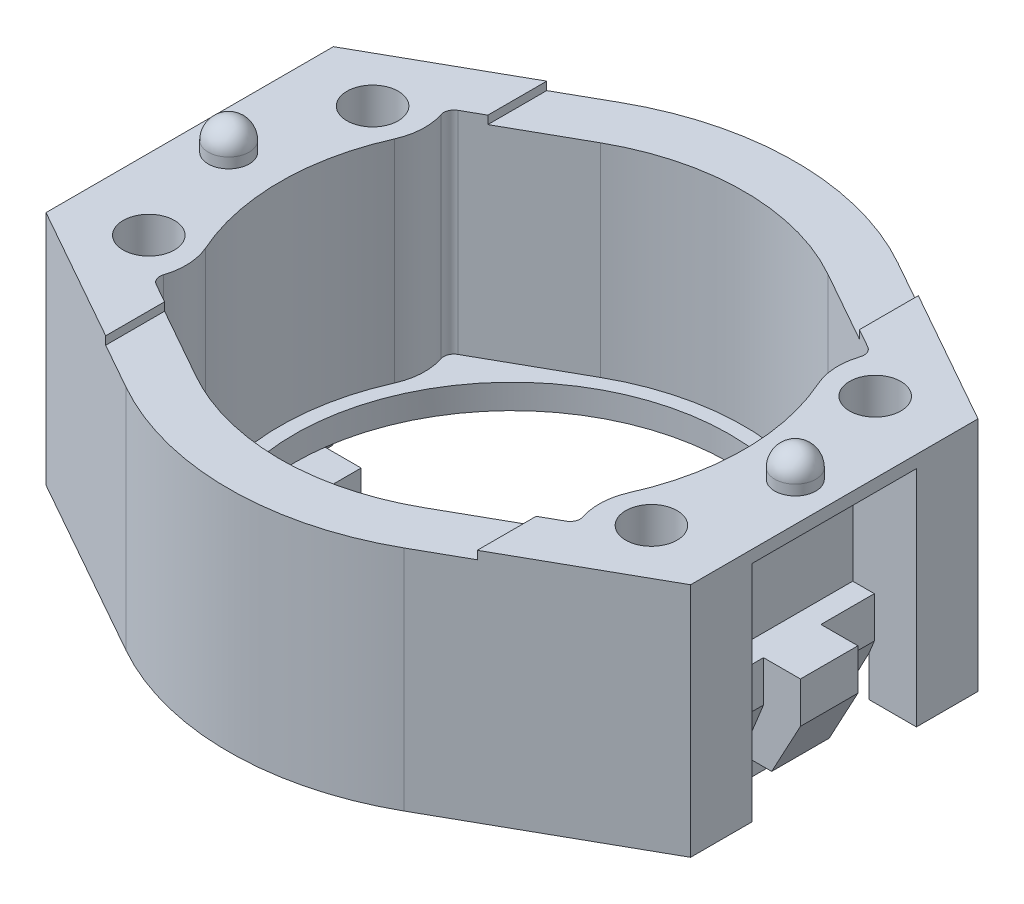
ISO-10303-21;
HEADER;
FILE_DESCRIPTION(('STEP AP214'),'2;1');
FILE_NAME('part.step','',(''),(''),'','','');
FILE_SCHEMA(('AUTOMOTIVE_DESIGN { 1 0 10303 214 1 1 1 1 }'));
ENDSEC;
DATA;
#1=APPLICATION_CONTEXT('core data for automotive mechanical design processes');
#2=APPLICATION_PROTOCOL_DEFINITION('international standard','automotive_design',2000,#1);
#3=PRODUCT_CONTEXT('',#1,'mechanical');
#4=PRODUCT('Part','Part','',(#3));
#5=PRODUCT_RELATED_PRODUCT_CATEGORY('part','',(#4));
#6=PRODUCT_DEFINITION_FORMATION('','',#4);
#7=PRODUCT_DEFINITION_CONTEXT('part definition',#1,'design');
#8=PRODUCT_DEFINITION('design','',#6,#7);
#9=PRODUCT_DEFINITION_SHAPE('','',#8);
#10=(LENGTH_UNIT() NAMED_UNIT(*) SI_UNIT(.MILLI.,.METRE.));
#11=(NAMED_UNIT(*) PLANE_ANGLE_UNIT() SI_UNIT($,.RADIAN.));
#12=(NAMED_UNIT(*) SI_UNIT($,.STERADIAN.) SOLID_ANGLE_UNIT());
#13=UNCERTAINTY_MEASURE_WITH_UNIT(LENGTH_MEASURE(1.E-05),#10,'distance_accuracy_value','');
#14=(GEOMETRIC_REPRESENTATION_CONTEXT(3) GLOBAL_UNCERTAINTY_ASSIGNED_CONTEXT((#13)) GLOBAL_UNIT_ASSIGNED_CONTEXT((#10,
#11,#12)) REPRESENTATION_CONTEXT('',''));
#15=CARTESIAN_POINT('',(0.,0.,0.));
#16=DIRECTION('',(0.,0.,1.));
#17=DIRECTION('',(1.,0.,0.));
#18=AXIS2_PLACEMENT_3D('',#15,#16,#17);
#19=CARTESIAN_POINT('',(0.,0.,0.));
#20=DIRECTION('',(0.,1.,0.));
#21=DIRECTION('',(0.,0.,1.));
#22=AXIS2_PLACEMENT_3D('',#19,#20,#21);
#23=PLANE('',#22);
#24=DIRECTION('',(1.,0.,0.));
#25=VECTOR('',#24,1.);
#26=CARTESIAN_POINT('',(0.,0.,-1.4));
#27=LINE('',#26,#25);
#28=CARTESIAN_POINT('',(14.05,0.,-1.4));
#29=VERTEX_POINT('',#28);
#30=CARTESIAN_POINT('',(12.6,0.,-1.4));
#31=VERTEX_POINT('',#30);
#32=EDGE_CURVE('E1208',#29,#31,#27,.F.);
#33=ORIENTED_EDGE('',*,*,#32,.F.);
#34=DIRECTION('',(0.,0.,1.));
#35=VECTOR('',#34,1.);
#36=CARTESIAN_POINT('',(14.05,0.,1.4));
#37=LINE('',#36,#35);
#38=CARTESIAN_POINT('',(14.05,0.,1.4));
#39=VERTEX_POINT('',#38);
#40=EDGE_CURVE('E1252',#39,#29,#37,.F.);
#41=ORIENTED_EDGE('',*,*,#40,.F.);
#42=DIRECTION('',(1.,0.,0.));
#43=VECTOR('',#42,1.);
#44=CARTESIAN_POINT('',(0.,0.,1.4));
#45=LINE('',#44,#43);
#46=CARTESIAN_POINT('',(12.6,0.,1.4));
#47=VERTEX_POINT('',#46);
#48=EDGE_CURVE('E301',#47,#39,#45,.T.);
#49=ORIENTED_EDGE('',*,*,#48,.F.);
#50=DIRECTION('',(0.,0.,-1.));
#51=VECTOR('',#50,1.);
#52=CARTESIAN_POINT('',(12.6,0.,2.85));
#53=LINE('',#52,#51);
#54=EDGE_CURVE('E1194',#31,#47,#53,.F.);
#55=ORIENTED_EDGE('',*,*,#54,.F.);
#56=EDGE_LOOP('',(#33,#41,#49,#55));
#57=FACE_BOUND('',#56,.T.);
#58=ADVANCED_FACE('F16',(#57),#23,.F.);
#59=CARTESIAN_POINT('',(0.,0.,0.));
#60=DIRECTION('',(0.,1.,0.));
#61=DIRECTION('',(0.,0.,1.));
#62=AXIS2_PLACEMENT_3D('',#59,#60,#61);
#63=PLANE('',#62);
#64=DIRECTION('',(0.,0.,1.));
#65=VECTOR('',#64,1.);
#66=CARTESIAN_POINT('',(-14.05,0.,1.4));
#67=LINE('',#66,#65);
#68=CARTESIAN_POINT('',(-14.05,0.,1.4));
#69=VERTEX_POINT('',#68);
#70=CARTESIAN_POINT('',(-14.05,0.,-1.4));
#71=VERTEX_POINT('',#70);
#72=EDGE_CURVE('E1180',#69,#71,#67,.F.);
#73=ORIENTED_EDGE('',*,*,#72,.T.);
#74=DIRECTION('',(1.,0.,0.));
#75=VECTOR('',#74,1.);
#76=CARTESIAN_POINT('',(0.,0.,-1.4));
#77=LINE('',#76,#75);
#78=CARTESIAN_POINT('',(-12.6,0.,-1.4));
#79=VERTEX_POINT('',#78);
#80=EDGE_CURVE('E1212',#79,#71,#77,.F.);
#81=ORIENTED_EDGE('',*,*,#80,.F.);
#82=DIRECTION('',(0.,0.,-1.));
#83=VECTOR('',#82,1.);
#84=CARTESIAN_POINT('',(-12.6,0.,2.85));
#85=LINE('',#84,#83);
#86=CARTESIAN_POINT('',(-12.6,0.,1.4));
#87=VERTEX_POINT('',#86);
#88=EDGE_CURVE('E1225',#79,#87,#85,.F.);
#89=ORIENTED_EDGE('',*,*,#88,.T.);
#90=DIRECTION('',(1.,0.,0.));
#91=VECTOR('',#90,1.);
#92=CARTESIAN_POINT('',(0.,0.,1.4));
#93=LINE('',#92,#91);
#94=EDGE_CURVE('E1165',#69,#87,#93,.T.);
#95=ORIENTED_EDGE('',*,*,#94,.F.);
#96=EDGE_LOOP('',(#73,#81,#89,#95));
#97=FACE_BOUND('',#96,.T.);
#98=ADVANCED_FACE('F1856',(#97),#63,.F.);
#99=CARTESIAN_POINT('',(-12.6,0.,2.85));
#100=DIRECTION('',(1.,0.,0.));
#101=DIRECTION('',(0.,0.,-1.));
#102=AXIS2_PLACEMENT_3D('',#99,#100,#101);
#103=PLANE('',#102);
#104=DIRECTION('',(0.,1.,0.));
#105=VECTOR('',#104,1.);
#106=CARTESIAN_POINT('',(-12.6,0.,2.85));
#107=LINE('',#106,#105);
#108=CARTESIAN_POINT('',(-12.6,0.,2.85));
#109=VERTEX_POINT('',#108);
#110=CARTESIAN_POINT('',(-12.6,-1.2,2.85));
#111=VERTEX_POINT('',#110);
#112=EDGE_CURVE('E1156',#109,#111,#107,.F.);
#113=ORIENTED_EDGE('',*,*,#112,.F.);
#114=DIRECTION('',(0.,0.,-1.));
#115=VECTOR('',#114,1.);
#116=CARTESIAN_POINT('',(-12.6,0.,2.85));
#117=LINE('',#116,#115);
#118=EDGE_CURVE('E1159',#87,#109,#117,.F.);
#119=ORIENTED_EDGE('',*,*,#118,.F.);
#120=ORIENTED_EDGE('',*,*,#88,.F.);
#121=DIRECTION('',(0.,0.,-1.));
#122=VECTOR('',#121,1.);
#123=CARTESIAN_POINT('',(-12.6,0.,2.85));
#124=LINE('',#123,#122);
#125=CARTESIAN_POINT('',(-12.6,0.,-2.85));
#126=VERTEX_POINT('',#125);
#127=EDGE_CURVE('E1164',#126,#79,#124,.F.);
#128=ORIENTED_EDGE('',*,*,#127,.F.);
#129=DIRECTION('',(0.,1.,0.));
#130=VECTOR('',#129,1.);
#131=CARTESIAN_POINT('',(-12.6,0.,-2.85));
#132=LINE('',#131,#130);
#133=CARTESIAN_POINT('',(-12.6,-1.2,-2.85));
#134=VERTEX_POINT('',#133);
#135=EDGE_CURVE('E1162',#134,#126,#132,.T.);
#136=ORIENTED_EDGE('',*,*,#135,.F.);
#137=DIRECTION('',(0.,0.,1.));
#138=VECTOR('',#137,1.);
#139=CARTESIAN_POINT('',(-12.6,-1.2,2.85));
#140=LINE('',#139,#138);
#141=EDGE_CURVE('E1148',#134,#111,#140,.T.);
#142=ORIENTED_EDGE('',*,*,#141,.T.);
#143=EDGE_LOOP('',(#113,#119,#120,#128,#136,#142));
#144=FACE_BOUND('',#143,.T.);
#145=ADVANCED_FACE('F2583',(#144),#103,.F.);
#146=CARTESIAN_POINT('',(12.6,0.,2.85));
#147=DIRECTION('',(1.,0.,0.));
#148=DIRECTION('',(0.,0.,-1.));
#149=AXIS2_PLACEMENT_3D('',#146,#147,#148);
#150=PLANE('',#149);
#151=DIRECTION('',(0.,1.,0.));
#152=VECTOR('',#151,1.);
#153=CARTESIAN_POINT('',(12.6,0.,2.85));
#154=LINE('',#153,#152);
#155=CARTESIAN_POINT('',(12.6,0.,2.85));
#156=VERTEX_POINT('',#155);
#157=CARTESIAN_POINT('',(12.6,-1.2,2.85));
#158=VERTEX_POINT('',#157);
#159=EDGE_CURVE('E1193',#156,#158,#154,.F.);
#160=ORIENTED_EDGE('',*,*,#159,.T.);
#161=DIRECTION('',(0.,0.,-1.));
#162=VECTOR('',#161,1.);
#163=CARTESIAN_POINT('',(12.6,-1.2,2.85));
#164=LINE('',#163,#162);
#165=CARTESIAN_POINT('',(12.6,-1.2,-2.85));
#166=VERTEX_POINT('',#165);
#167=EDGE_CURVE('E1679',#166,#158,#164,.F.);
#168=ORIENTED_EDGE('',*,*,#167,.F.);
#169=DIRECTION('',(0.,1.,0.));
#170=VECTOR('',#169,1.);
#171=CARTESIAN_POINT('',(12.6,0.,-2.85));
#172=LINE('',#171,#170);
#173=CARTESIAN_POINT('',(12.6,0.,-2.85));
#174=VERTEX_POINT('',#173);
#175=EDGE_CURVE('E1158',#166,#174,#172,.T.);
#176=ORIENTED_EDGE('',*,*,#175,.T.);
#177=DIRECTION('',(0.,0.,-1.));
#178=VECTOR('',#177,1.);
#179=CARTESIAN_POINT('',(12.6,0.,2.85));
#180=LINE('',#179,#178);
#181=EDGE_CURVE('E1204',#174,#31,#180,.F.);
#182=ORIENTED_EDGE('',*,*,#181,.T.);
#183=ORIENTED_EDGE('',*,*,#54,.T.);
#184=DIRECTION('',(0.,0.,-1.));
#185=VECTOR('',#184,1.);
#186=CARTESIAN_POINT('',(12.6,0.,2.85));
#187=LINE('',#186,#185);
#188=EDGE_CURVE('E1190',#47,#156,#187,.F.);
#189=ORIENTED_EDGE('',*,*,#188,.T.);
#190=EDGE_LOOP('',(#160,#168,#176,#182,#183,#189));
#191=FACE_BOUND('',#190,.T.);
#192=ADVANCED_FACE('F1992',(#191),#150,.T.);
#193=CARTESIAN_POINT('',(15.45,2.6,1.4));
#194=DIRECTION('',(0.880471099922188,-0.474099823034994,0.));
#195=DIRECTION('',(0.474099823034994,0.880471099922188,0.));
#196=AXIS2_PLACEMENT_3D('',#193,#194,#195);
#197=PLANE('',#196);
#198=ORIENTED_EDGE('',*,*,#40,.T.);
#199=DIRECTION('',(0.474099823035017,0.880471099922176,0.));
#200=VECTOR('',#199,1.);
#201=CARTESIAN_POINT('',(14.05,0.,-1.4));
#202=LINE('',#201,#200);
#203=CARTESIAN_POINT('',(15.45,2.6,-1.4));
#204=VERTEX_POINT('',#203);
#205=EDGE_CURVE('E1257',#29,#204,#202,.T.);
#206=ORIENTED_EDGE('',*,*,#205,.T.);
#207=DIRECTION('',(0.,0.,-1.));
#208=VECTOR('',#207,1.);
#209=CARTESIAN_POINT('',(15.45,2.6,1.4));
#210=LINE('',#209,#208);
#211=CARTESIAN_POINT('',(15.45,2.6,1.4));
#212=VERTEX_POINT('',#211);
#213=EDGE_CURVE('E309',#212,#204,#210,.T.);
#214=ORIENTED_EDGE('',*,*,#213,.F.);
#215=DIRECTION('',(0.474099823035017,0.880471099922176,0.));
#216=VECTOR('',#215,1.);
#217=CARTESIAN_POINT('',(14.05,0.,1.4));
#218=LINE('',#217,#216);
#219=EDGE_CURVE('E1262',#39,#212,#218,.T.);
#220=ORIENTED_EDGE('',*,*,#219,.F.);
#221=EDGE_LOOP('',(#198,#206,#214,#220));
#222=FACE_BOUND('',#221,.T.);
#223=ADVANCED_FACE('F2577',(#222),#197,.T.);
#224=CARTESIAN_POINT('',(15.45,4.6,1.4));
#225=DIRECTION('',(1.,0.,0.));
#226=DIRECTION('',(0.,0.,-1.));
#227=AXIS2_PLACEMENT_3D('',#224,#225,#226);
#228=PLANE('',#227);
#229=ORIENTED_EDGE('',*,*,#213,.T.);
#230=DIRECTION('',(0.,1.,0.));
#231=VECTOR('',#230,1.);
#232=CARTESIAN_POINT('',(15.45,4.6,-1.4));
#233=LINE('',#232,#231);
#234=CARTESIAN_POINT('',(15.45,4.6,-1.4));
#235=VERTEX_POINT('',#234);
#236=EDGE_CURVE('E1259',#204,#235,#233,.T.);
#237=ORIENTED_EDGE('',*,*,#236,.T.);
#238=DIRECTION('',(0.,0.,1.));
#239=VECTOR('',#238,1.);
#240=CARTESIAN_POINT('',(15.45,4.6,-4.));
#241=LINE('',#240,#239);
#242=CARTESIAN_POINT('',(15.45,4.6,1.4));
#243=VERTEX_POINT('',#242);
#244=EDGE_CURVE('E2185',#243,#235,#241,.F.);
#245=ORIENTED_EDGE('',*,*,#244,.F.);
#246=DIRECTION('',(0.,1.,0.));
#247=VECTOR('',#246,1.);
#248=CARTESIAN_POINT('',(15.45,4.6,1.4));
#249=LINE('',#248,#247);
#250=EDGE_CURVE('E1264',#212,#243,#249,.T.);
#251=ORIENTED_EDGE('',*,*,#250,.F.);
#252=EDGE_LOOP('',(#229,#237,#245,#251));
#253=FACE_BOUND('',#252,.T.);
#254=ADVANCED_FACE('F2574',(#253),#228,.T.);
#255=CARTESIAN_POINT('',(15.45,4.6,1.4));
#256=DIRECTION('',(0.,0.,1.));
#257=DIRECTION('',(1.,0.,0.));
#258=AXIS2_PLACEMENT_3D('',#255,#256,#257);
#259=PLANE('',#258);
#260=ORIENTED_EDGE('',*,*,#250,.T.);
#261=DIRECTION('',(1.,0.,0.));
#262=VECTOR('',#261,1.);
#263=CARTESIAN_POINT('',(12.6,4.6,1.4));
#264=LINE('',#263,#262);
#265=CARTESIAN_POINT('',(13.65,4.6,1.4));
#266=VERTEX_POINT('',#265);
#267=EDGE_CURVE('E2188',#266,#243,#264,.T.);
#268=ORIENTED_EDGE('',*,*,#267,.F.);
#269=DIRECTION('',(0.,1.,0.));
#270=VECTOR('',#269,1.);
#271=CARTESIAN_POINT('',(13.65,4.6,1.4));
#272=LINE('',#271,#270);
#273=CARTESIAN_POINT('',(13.65,2.6,1.4));
#274=VERTEX_POINT('',#273);
#275=EDGE_CURVE('E1659',#274,#266,#272,.T.);
#276=ORIENTED_EDGE('',*,*,#275,.F.);
#277=DIRECTION('',(0.374463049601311,0.927241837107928,0.));
#278=VECTOR('',#277,1.);
#279=CARTESIAN_POINT('',(13.65,2.6,1.4));
#280=LINE('',#279,#278);
#281=EDGE_CURVE('E1197',#47,#274,#280,.T.);
#282=ORIENTED_EDGE('',*,*,#281,.F.);
#283=ORIENTED_EDGE('',*,*,#48,.T.);
#284=ORIENTED_EDGE('',*,*,#219,.T.);
#285=EDGE_LOOP('',(#260,#268,#276,#282,#283,#284));
#286=FACE_BOUND('',#285,.T.);
#287=ADVANCED_FACE('F2571',(#286),#259,.T.);
#288=CARTESIAN_POINT('',(-15.45,4.6,1.4));
#289=DIRECTION('',(1.,0.,0.));
#290=DIRECTION('',(0.,0.,-1.));
#291=AXIS2_PLACEMENT_3D('',#288,#289,#290);
#292=PLANE('',#291);
#293=DIRECTION('',(0.,1.,0.));
#294=VECTOR('',#293,1.);
#295=CARTESIAN_POINT('',(-15.45,4.6,1.4));
#296=LINE('',#295,#294);
#297=CARTESIAN_POINT('',(-15.45,4.6,1.4));
#298=VERTEX_POINT('',#297);
#299=CARTESIAN_POINT('',(-15.45,2.6,1.4));
#300=VERTEX_POINT('',#299);
#301=EDGE_CURVE('E1775',#298,#300,#296,.F.);
#302=ORIENTED_EDGE('',*,*,#301,.F.);
#303=DIRECTION('',(0.,0.,-1.));
#304=VECTOR('',#303,1.);
#305=CARTESIAN_POINT('',(-15.45,4.6,-4.));
#306=LINE('',#305,#304);
#307=CARTESIAN_POINT('',(-15.45,4.6,-1.4));
#308=VERTEX_POINT('',#307);
#309=EDGE_CURVE('E1761',#298,#308,#306,.T.);
#310=ORIENTED_EDGE('',*,*,#309,.T.);
#311=DIRECTION('',(0.,1.,0.));
#312=VECTOR('',#311,1.);
#313=CARTESIAN_POINT('',(-15.45,4.6,-1.4));
#314=LINE('',#313,#312);
#315=CARTESIAN_POINT('',(-15.45,2.6,-1.4));
#316=VERTEX_POINT('',#315);
#317=EDGE_CURVE('E1187',#308,#316,#314,.F.);
#318=ORIENTED_EDGE('',*,*,#317,.T.);
#319=DIRECTION('',(0.,0.,1.));
#320=VECTOR('',#319,1.);
#321=CARTESIAN_POINT('',(-15.45,2.6,1.4));
#322=LINE('',#321,#320);
#323=EDGE_CURVE('E1249',#316,#300,#322,.T.);
#324=ORIENTED_EDGE('',*,*,#323,.T.);
#325=EDGE_LOOP('',(#302,#310,#318,#324));
#326=FACE_BOUND('',#325,.T.);
#327=ADVANCED_FACE('F1833',(#326),#292,.F.);
#328=CARTESIAN_POINT('',(-15.45,2.6,1.4));
#329=DIRECTION('',(0.880471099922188,0.474099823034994,0.));
#330=DIRECTION('',(-0.474099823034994,0.880471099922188,0.));
#331=AXIS2_PLACEMENT_3D('',#328,#329,#330);
#332=PLANE('',#331);
#333=DIRECTION('',(0.474099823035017,-0.880471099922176,0.));
#334=VECTOR('',#333,1.);
#335=CARTESIAN_POINT('',(-15.45,2.6,1.4));
#336=LINE('',#335,#334);
#337=EDGE_CURVE('E1231',#300,#69,#336,.T.);
#338=ORIENTED_EDGE('',*,*,#337,.F.);
#339=ORIENTED_EDGE('',*,*,#323,.F.);
#340=DIRECTION('',(0.474099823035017,-0.880471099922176,0.));
#341=VECTOR('',#340,1.);
#342=CARTESIAN_POINT('',(-15.45,2.6,-1.4));
#343=LINE('',#342,#341);
#344=EDGE_CURVE('E1183',#316,#71,#343,.T.);
#345=ORIENTED_EDGE('',*,*,#344,.T.);
#346=ORIENTED_EDGE('',*,*,#72,.F.);
#347=EDGE_LOOP('',(#338,#339,#345,#346));
#348=FACE_BOUND('',#347,.T.);
#349=ADVANCED_FACE('F1838',(#348),#332,.F.);
#350=CARTESIAN_POINT('',(-12.6,-1.2,2.85));
#351=DIRECTION('',(0.,1.,0.));
#352=DIRECTION('',(0.,0.,1.));
#353=AXIS2_PLACEMENT_3D('',#350,#351,#352);
#354=PLANE('',#353);
#355=DIRECTION('',(0.,0.,-1.));
#356=VECTOR('',#355,1.);
#357=CARTESIAN_POINT('',(-8.75,-1.2,-1.4));
#358=LINE('',#357,#356);
#359=CARTESIAN_POINT('',(-8.75,-1.2,1.4));
#360=VERTEX_POINT('',#359);
#361=CARTESIAN_POINT('',(-8.75,-1.2,-1.4));
#362=VERTEX_POINT('',#361);
#363=EDGE_CURVE('E1731',#360,#362,#358,.T.);
#364=ORIENTED_EDGE('',*,*,#363,.F.);
#365=DIRECTION('',(1.,0.,0.));
#366=VECTOR('',#365,1.);
#367=CARTESIAN_POINT('',(-12.6,-1.2,1.4));
#368=LINE('',#367,#366);
#369=CARTESIAN_POINT('',(-11.6,-1.2,1.4));
#370=VERTEX_POINT('',#369);
#371=EDGE_CURVE('E1186',#370,#360,#368,.T.);
#372=ORIENTED_EDGE('',*,*,#371,.F.);
#373=DIRECTION('',(0.,0.,1.));
#374=VECTOR('',#373,1.);
#375=CARTESIAN_POINT('',(-11.6,-1.2,2.85));
#376=LINE('',#375,#374);
#377=CARTESIAN_POINT('',(-11.6,-1.2,2.85));
#378=VERTEX_POINT('',#377);
#379=EDGE_CURVE('E1147',#378,#370,#376,.F.);
#380=ORIENTED_EDGE('',*,*,#379,.F.);
#381=DIRECTION('',(1.,0.,0.));
#382=VECTOR('',#381,1.);
#383=CARTESIAN_POINT('',(-12.6,-1.2,2.85));
#384=LINE('',#383,#382);
#385=EDGE_CURVE('E1145',#111,#378,#384,.T.);
#386=ORIENTED_EDGE('',*,*,#385,.F.);
#387=ORIENTED_EDGE('',*,*,#141,.F.);
#388=DIRECTION('',(1.,0.,0.));
#389=VECTOR('',#388,1.);
#390=CARTESIAN_POINT('',(-12.6,-1.2,-2.85));
#391=LINE('',#390,#389);
#392=CARTESIAN_POINT('',(-11.6,-1.2,-2.85));
#393=VERTEX_POINT('',#392);
#394=EDGE_CURVE('E1153',#393,#134,#391,.F.);
#395=ORIENTED_EDGE('',*,*,#394,.F.);
#396=DIRECTION('',(0.,0.,1.));
#397=VECTOR('',#396,1.);
#398=CARTESIAN_POINT('',(-11.6,-1.2,2.85));
#399=LINE('',#398,#397);
#400=CARTESIAN_POINT('',(-11.6,-1.2,-1.4));
#401=VERTEX_POINT('',#400);
#402=EDGE_CURVE('E1169',#401,#393,#399,.F.);
#403=ORIENTED_EDGE('',*,*,#402,.F.);
#404=DIRECTION('',(-1.,0.,0.));
#405=VECTOR('',#404,1.);
#406=CARTESIAN_POINT('',(-12.6,-1.2,-1.4));
#407=LINE('',#406,#405);
#408=EDGE_CURVE('E1737',#362,#401,#407,.T.);
#409=ORIENTED_EDGE('',*,*,#408,.F.);
#410=EDGE_LOOP('',(#364,#372,#380,#386,#387,#395,#403,#409));
#411=FACE_BOUND('',#410,.T.);
#412=ADVANCED_FACE('F2442',(#411),#354,.F.);
#413=CARTESIAN_POINT('',(12.6,-1.2,2.85));
#414=DIRECTION('',(0.,-1.,0.));
#415=DIRECTION('',(0.,0.,-1.));
#416=AXIS2_PLACEMENT_3D('',#413,#414,#415);
#417=PLANE('',#416);
#418=DIRECTION('',(1.,0.,0.));
#419=VECTOR('',#418,1.);
#420=CARTESIAN_POINT('',(12.6,-1.2,2.85));
#421=LINE('',#420,#419);
#422=CARTESIAN_POINT('',(11.6,-1.2,2.85));
#423=VERTEX_POINT('',#422);
#424=EDGE_CURVE('E1675',#158,#423,#421,.F.);
#425=ORIENTED_EDGE('',*,*,#424,.T.);
#426=DIRECTION('',(0.,0.,-1.));
#427=VECTOR('',#426,1.);
#428=CARTESIAN_POINT('',(11.6,-1.2,2.85));
#429=LINE('',#428,#427);
#430=CARTESIAN_POINT('',(11.6,-1.2,1.4));
#431=VERTEX_POINT('',#430);
#432=EDGE_CURVE('E1678',#423,#431,#429,.T.);
#433=ORIENTED_EDGE('',*,*,#432,.T.);
#434=DIRECTION('',(-1.,0.,0.));
#435=VECTOR('',#434,1.);
#436=CARTESIAN_POINT('',(12.6,-1.2,1.4));
#437=LINE('',#436,#435);
#438=CARTESIAN_POINT('',(8.75,-1.2,1.4));
#439=VERTEX_POINT('',#438);
#440=EDGE_CURVE('E2106',#431,#439,#437,.T.);
#441=ORIENTED_EDGE('',*,*,#440,.T.);
#442=DIRECTION('',(0.,0.,-1.));
#443=VECTOR('',#442,1.);
#444=CARTESIAN_POINT('',(8.75,-1.2,-1.4));
#445=LINE('',#444,#443);
#446=CARTESIAN_POINT('',(8.75,-1.2,-1.4));
#447=VERTEX_POINT('',#446);
#448=EDGE_CURVE('E2101',#439,#447,#445,.T.);
#449=ORIENTED_EDGE('',*,*,#448,.T.);
#450=DIRECTION('',(1.,0.,0.));
#451=VECTOR('',#450,1.);
#452=CARTESIAN_POINT('',(12.6,-1.2,-1.4));
#453=LINE('',#452,#451);
#454=CARTESIAN_POINT('',(11.6,-1.2,-1.4));
#455=VERTEX_POINT('',#454);
#456=EDGE_CURVE('E1712',#447,#455,#453,.T.);
#457=ORIENTED_EDGE('',*,*,#456,.T.);
#458=DIRECTION('',(0.,0.,-1.));
#459=VECTOR('',#458,1.);
#460=CARTESIAN_POINT('',(11.6,-1.2,2.85));
#461=LINE('',#460,#459);
#462=CARTESIAN_POINT('',(11.6,-1.2,-2.85));
#463=VERTEX_POINT('',#462);
#464=EDGE_CURVE('E1696',#455,#463,#461,.T.);
#465=ORIENTED_EDGE('',*,*,#464,.T.);
#466=DIRECTION('',(1.,0.,0.));
#467=VECTOR('',#466,1.);
#468=CARTESIAN_POINT('',(12.6,-1.2,-2.85));
#469=LINE('',#468,#467);
#470=EDGE_CURVE('E1684',#463,#166,#469,.T.);
#471=ORIENTED_EDGE('',*,*,#470,.T.);
#472=ORIENTED_EDGE('',*,*,#167,.T.);
#473=EDGE_LOOP('',(#425,#433,#441,#449,#457,#465,#471,#472));
#474=FACE_BOUND('',#473,.T.);
#475=ADVANCED_FACE('F1710',(#474),#417,.T.);
#476=CARTESIAN_POINT('',(13.65,2.6,-4.));
#477=DIRECTION('',(0.927241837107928,-0.374463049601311,0.));
#478=DIRECTION('',(0.374463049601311,0.927241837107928,0.));
#479=AXIS2_PLACEMENT_3D('',#476,#477,#478);
#480=PLANE('',#479);
#481=ORIENTED_EDGE('',*,*,#188,.F.);
#482=ORIENTED_EDGE('',*,*,#281,.T.);
#483=DIRECTION('',(0.,0.,-1.));
#484=VECTOR('',#483,1.);
#485=CARTESIAN_POINT('',(13.65,2.6,-4.));
#486=LINE('',#485,#484);
#487=CARTESIAN_POINT('',(13.65,2.6,4.));
#488=VERTEX_POINT('',#487);
#489=EDGE_CURVE('E1656',#488,#274,#486,.T.);
#490=ORIENTED_EDGE('',*,*,#489,.F.);
#491=DIRECTION('',(0.374463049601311,0.927241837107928,0.));
#492=VECTOR('',#491,1.);
#493=CARTESIAN_POINT('',(13.65,2.6,4.));
#494=LINE('',#493,#492);
#495=CARTESIAN_POINT('',(13.3900795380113,1.95638742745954,3.99999999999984));
#496=VERTEX_POINT('',#495);
#497=EDGE_CURVE('E993',#488,#496,#494,.F.);
#498=ORIENTED_EDGE('',*,*,#497,.T.);
#499=CARTESIAN_POINT('',(13.3900795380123,1.95638742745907,3.99999999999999));
#500=CARTESIAN_POINT('',(13.0391583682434,1.0874397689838,3.72208113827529));
#501=CARTESIAN_POINT('',(12.5999999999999,0.,3.635337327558));
#502=B_SPLINE_CURVE_WITH_KNOTS('',2,(#499,#500,#501),.UNSPECIFIED.,.F.,.F.,(3,3),(0.,1.),.UNSPECIFIED.);
#503=CARTESIAN_POINT('',(12.6,0.,3.63533732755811));
#504=VERTEX_POINT('',#503);
#505=EDGE_CURVE('E984',#496,#504,#502,.T.);
#506=ORIENTED_EDGE('',*,*,#505,.T.);
#507=DIRECTION('',(0.,0.,1.));
#508=VECTOR('',#507,1.);
#509=CARTESIAN_POINT('',(12.6,0.,-4.));
#510=LINE('',#509,#508);
#511=EDGE_CURVE('E924',#504,#156,#510,.F.);
#512=ORIENTED_EDGE('',*,*,#511,.T.);
#513=EDGE_LOOP('',(#481,#482,#490,#498,#506,#512));
#514=FACE_BOUND('',#513,.T.);
#515=ADVANCED_FACE('F2553',(#514),#480,.T.);
#516=CARTESIAN_POINT('',(-13.65,2.6,-4.));
#517=DIRECTION('',(0.927241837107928,0.374463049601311,0.));
#518=DIRECTION('',(-0.374463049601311,0.927241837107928,0.));
#519=AXIS2_PLACEMENT_3D('',#516,#517,#518);
#520=PLANE('',#519);
#521=ORIENTED_EDGE('',*,*,#118,.T.);
#522=DIRECTION('',(0.,0.,1.));
#523=VECTOR('',#522,1.);
#524=CARTESIAN_POINT('',(-12.6,0.,-4.));
#525=LINE('',#524,#523);
#526=CARTESIAN_POINT('',(-12.6,0.,3.63533732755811));
#527=VERTEX_POINT('',#526);
#528=EDGE_CURVE('E1634',#527,#109,#525,.F.);
#529=ORIENTED_EDGE('',*,*,#528,.F.);
#530=CARTESIAN_POINT('',(-12.5999999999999,0.,3.635337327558));
#531=CARTESIAN_POINT('',(-13.0391583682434,1.0874397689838,3.72208113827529));
#532=CARTESIAN_POINT('',(-13.3900795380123,1.95638742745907,3.99999999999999));
#533=B_SPLINE_CURVE_WITH_KNOTS('',2,(#530,#531,#532),.UNSPECIFIED.,.F.,.F.,(3,3),(0.,1.),.UNSPECIFIED.);
#534=CARTESIAN_POINT('',(-13.3900795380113,1.95638742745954,3.99999999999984));
#535=VERTEX_POINT('',#534);
#536=EDGE_CURVE('E1785',#527,#535,#533,.T.);
#537=ORIENTED_EDGE('',*,*,#536,.T.);
#538=DIRECTION('',(-0.374463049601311,0.927241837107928,0.));
#539=VECTOR('',#538,1.);
#540=CARTESIAN_POINT('',(-13.65,2.6,4.));
#541=LINE('',#540,#539);
#542=CARTESIAN_POINT('',(-13.65,2.6,4.));
#543=VERTEX_POINT('',#542);
#544=EDGE_CURVE('E1199',#543,#535,#541,.F.);
#545=ORIENTED_EDGE('',*,*,#544,.F.);
#546=DIRECTION('',(0.,0.,-1.));
#547=VECTOR('',#546,1.);
#548=CARTESIAN_POINT('',(-13.65,2.6,-4.));
#549=LINE('',#548,#547);
#550=CARTESIAN_POINT('',(-13.65,2.6,1.4));
#551=VERTEX_POINT('',#550);
#552=EDGE_CURVE('E1645',#543,#551,#549,.T.);
#553=ORIENTED_EDGE('',*,*,#552,.T.);
#554=DIRECTION('',(-0.374463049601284,0.92724183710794,0.));
#555=VECTOR('',#554,1.);
#556=CARTESIAN_POINT('',(-12.6,0.,1.4));
#557=LINE('',#556,#555);
#558=EDGE_CURVE('E1228',#87,#551,#557,.T.);
#559=ORIENTED_EDGE('',*,*,#558,.F.);
#560=EDGE_LOOP('',(#521,#529,#537,#545,#553,#559));
#561=FACE_BOUND('',#560,.T.);
#562=ADVANCED_FACE('F1867',(#561),#520,.F.);
#563=CARTESIAN_POINT('',(-15.45,4.6,1.4));
#564=DIRECTION('',(0.,0.,1.));
#565=DIRECTION('',(1.,0.,0.));
#566=AXIS2_PLACEMENT_3D('',#563,#564,#565);
#567=PLANE('',#566);
#568=DIRECTION('',(0.,1.,0.));
#569=VECTOR('',#568,1.);
#570=CARTESIAN_POINT('',(-13.65,4.6,1.4));
#571=LINE('',#570,#569);
#572=CARTESIAN_POINT('',(-13.65,4.6,1.4));
#573=VERTEX_POINT('',#572);
#574=EDGE_CURVE('E1647',#551,#573,#571,.T.);
#575=ORIENTED_EDGE('',*,*,#574,.T.);
#576=DIRECTION('',(1.,0.,0.));
#577=VECTOR('',#576,1.);
#578=CARTESIAN_POINT('',(-12.6,4.6,1.4));
#579=LINE('',#578,#577);
#580=EDGE_CURVE('E1764',#573,#298,#579,.F.);
#581=ORIENTED_EDGE('',*,*,#580,.T.);
#582=ORIENTED_EDGE('',*,*,#301,.T.);
#583=ORIENTED_EDGE('',*,*,#337,.T.);
#584=ORIENTED_EDGE('',*,*,#94,.T.);
#585=ORIENTED_EDGE('',*,*,#558,.T.);
#586=EDGE_LOOP('',(#575,#581,#582,#583,#584,#585));
#587=FACE_BOUND('',#586,.T.);
#588=ADVANCED_FACE('F1814',(#587),#567,.T.);
#589=CARTESIAN_POINT('',(9.73954932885,1.2,6.911789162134));
#590=DIRECTION('',(0.,1.,0.));
#591=DIRECTION('',(0.,0.,1.));
#592=AXIS2_PLACEMENT_3D('',#589,#590,#591);
#593=CYLINDRICAL_SURFACE('',#592,0.5);
#594=CARTESIAN_POINT('',(10.21482974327,11.5,6.757025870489));
#595=CARTESIAN_POINT('',(10.2702326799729,11.5,6.92514567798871));
#596=CARTESIAN_POINT('',(10.205355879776,11.5,7.09350390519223));
#597=CARTESIAN_POINT('',(10.1750802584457,11.5,7.17207051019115));
#598=CARTESIAN_POINT('',(10.1171473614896,11.5,7.2394680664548));
#599=CARTESIAN_POINT('',(10.0612660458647,11.5,7.30447886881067));
#600=CARTESIAN_POINT('',(9.984759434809,11.5,7.347532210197));
#601=B_SPLINE_CURVE_WITH_KNOTS('',2,(#594,#595,#596,#597,#598,#599,#600),.UNSPECIFIED.,.F.,.F.,
(3,2,2,3),(0.,0.5,0.75,1.),.UNSPECIFIED.);
#602=CARTESIAN_POINT('',(10.2149054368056,11.5,6.75700098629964));
#603=VERTEX_POINT('',#602);
#604=CARTESIAN_POINT('',(9.98475943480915,11.5,7.34753221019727));
#605=VERTEX_POINT('',#604);
#606=EDGE_CURVE('E330',#603,#605,#601,.T.);
#607=ORIENTED_EDGE('',*,*,#606,.F.);
#608=DIRECTION('',(0.,1.,0.));
#609=VECTOR('',#608,1.);
#610=CARTESIAN_POINT('',(10.214982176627,1.2,6.75697553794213));
#611=LINE('',#610,#609);
#612=CARTESIAN_POINT('',(10.2149054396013,1.2,6.75700098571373));
#613=VERTEX_POINT('',#612);
#614=EDGE_CURVE('E809',#613,#603,#611,.T.);
#615=ORIENTED_EDGE('',*,*,#614,.F.);
#616=CARTESIAN_POINT('',(9.984759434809,1.2,7.347532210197));
#617=CARTESIAN_POINT('',(10.13954040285,1.2,7.26043074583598));
#618=CARTESIAN_POINT('',(10.2053632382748,1.2,7.09348504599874));
#619=CARTESIAN_POINT('',(10.2364063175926,1.2,7.0147508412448));
#620=CARTESIAN_POINT('',(10.2393498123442,1.2,6.9266819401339));
#621=CARTESIAN_POINT('',(10.2422401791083,1.2,6.8402026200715));
#622=CARTESIAN_POINT('',(10.21482974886,1.2,6.757025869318));
#623=B_SPLINE_CURVE_WITH_KNOTS('',2,(#616,#617,#618,#619,#620,#621,#622),.UNSPECIFIED.,.F.,.F.,
(3,2,2,3),(0.,0.5,0.75,1.),.UNSPECIFIED.);
#624=CARTESIAN_POINT('',(9.9847594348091,1.2,7.34753221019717));
#625=VERTEX_POINT('',#624);
#626=EDGE_CURVE('E178',#625,#613,#623,.T.);
#627=ORIENTED_EDGE('',*,*,#626,.F.);
#628=DIRECTION('',(0.,1.,0.));
#629=VECTOR('',#628,1.);
#630=CARTESIAN_POINT('',(9.98475943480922,1.2,7.3475322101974));
#631=LINE('',#630,#629);
#632=EDGE_CURVE('E816',#625,#605,#631,.T.);
#633=ORIENTED_EDGE('',*,*,#632,.T.);
#634=EDGE_LOOP('',(#607,#615,#627,#633));
#635=FACE_BOUND('',#634,.T.);
#636=ADVANCED_FACE('F1803',(#635),#593,.F.);
#637=CARTESIAN_POINT('',(12.24150913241,2.,5.450271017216));
#638=DIRECTION('',(0.,-1.,0.));
#639=DIRECTION('',(0.,0.,-1.));
#640=AXIS2_PLACEMENT_3D('',#637,#638,#639);
#641=PLANE('',#640);
#642=CARTESIAN_POINT('',(12.24150913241,2.,6.700271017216));
#643=CARTESIAN_POINT('',(12.4796707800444,2.,6.700271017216));
#644=CARTESIAN_POINT('',(12.7016275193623,2.,6.61250639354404));
#645=CARTESIAN_POINT('',(12.9418827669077,2.,6.51750629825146));
#646=CARTESIAN_POINT('',(13.1253926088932,2.,6.33415449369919));
#647=CARTESIAN_POINT('',(13.3081569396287,2.,6.15154755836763));
#648=CARTESIAN_POINT('',(13.403744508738,2.,5.91038940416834));
#649=CARTESIAN_POINT('',(13.4914077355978,2.,5.68922359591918));
#650=CARTESIAN_POINT('',(13.49150913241,2.,5.450271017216));
#651=CARTESIAN_POINT('',(13.4916100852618,2.,5.21236467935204));
#652=CARTESIAN_POINT('',(13.403744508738,2.,4.99015263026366));
#653=CARTESIAN_POINT('',(13.3087444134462,2.,4.74989738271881));
#654=CARTESIAN_POINT('',(13.1253926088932,2.,4.56638754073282));
#655=CARTESIAN_POINT('',(12.9427856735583,2.,4.38362320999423));
#656=CARTESIAN_POINT('',(12.7016275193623,2.,4.28803564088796));
#657=CARTESIAN_POINT('',(12.4802058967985,2.,4.200271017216));
#658=CARTESIAN_POINT('',(12.24150913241,2.,4.200271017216));
#659=B_SPLINE_CURVE_WITH_KNOTS('',2,(#642,#643,#644,#645,#646,#647,#648,#649,#650,#651,#652,
#653,#654,#655,#656,#657,#658),.UNSPECIFIED.,.F.,.F.,(3,2,2,2,2,2,2,2,3),(0.,0.125,0.25,0.375,
0.5,0.625,0.75,0.875,1.),.UNSPECIFIED.);
#660=CARTESIAN_POINT('',(12.24150913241,2.,6.700271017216));
#661=VERTEX_POINT('',#660);
#662=CARTESIAN_POINT('',(12.24150913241,2.,4.200271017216));
#663=VERTEX_POINT('',#662);
#664=EDGE_CURVE('E3167',#661,#663,#659,.T.);
#665=ORIENTED_EDGE('',*,*,#664,.T.);
#666=CARTESIAN_POINT('',(12.24150913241,2.,4.200271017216));
#667=CARTESIAN_POINT('',(12.0033474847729,2.,4.200271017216));
#668=CARTESIAN_POINT('',(11.7813907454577,2.,4.28803564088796));
#669=CARTESIAN_POINT('',(11.5411354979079,2.,4.38303573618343));
#670=CARTESIAN_POINT('',(11.3576256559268,2.,4.56638754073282));
#671=CARTESIAN_POINT('',(11.1748613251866,2.,4.74899447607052));
#672=CARTESIAN_POINT('',(11.079273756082,2.,4.99015263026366));
#673=CARTESIAN_POINT('',(10.9916105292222,2.,5.21131843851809));
#674=CARTESIAN_POINT('',(10.99150913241,2.,5.450271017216));
#675=CARTESIAN_POINT('',(10.9914081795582,2.,5.68817735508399));
#676=CARTESIAN_POINT('',(11.079273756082,2.,5.91038940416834));
#677=CARTESIAN_POINT('',(11.1742738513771,2.,6.15064465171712));
#678=CARTESIAN_POINT('',(11.3576256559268,2.,6.33415449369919));
#679=CARTESIAN_POINT('',(11.5402325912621,2.,6.5169188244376));
#680=CARTESIAN_POINT('',(11.7813907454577,2.,6.61250639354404));
#681=CARTESIAN_POINT('',(12.0028123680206,2.,6.700271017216));
#682=CARTESIAN_POINT('',(12.24150913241,2.,6.700271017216));
#683=B_SPLINE_CURVE_WITH_KNOTS('',2,(#666,#667,#668,#669,#670,#671,#672,#673,#674,#675,#676,
#677,#678,#679,#680,#681,#682),.UNSPECIFIED.,.F.,.F.,(3,2,2,2,2,2,2,2,3),(0.,0.125,0.25,0.375,
0.5,0.625,0.75,0.875,1.),.UNSPECIFIED.);
#684=EDGE_CURVE('E805',#663,#661,#683,.T.);
#685=ORIENTED_EDGE('',*,*,#684,.T.);
#686=EDGE_LOOP('',(#665,#685));
#687=FACE_BOUND('',#686,.T.);
#688=CARTESIAN_POINT('',(12.24150913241,2.,7.300271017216));
#689=CARTESIAN_POINT('',(11.8889012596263,2.,7.300271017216));
#690=CARTESIAN_POINT('',(11.5605339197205,2.,7.1703793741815));
#691=CARTESIAN_POINT('',(11.2047393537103,2.,7.02963839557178));
#692=CARTESIAN_POINT('',(10.9333615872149,2.,6.75841856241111));
#693=CARTESIAN_POINT('',(10.6627292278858,2.,6.48794370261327));
#694=CARTESIAN_POINT('',(10.5214007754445,2.,6.13124622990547));
#695=CARTESIAN_POINT('',(10.3916104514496,2.,5.80366972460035));
#696=CARTESIAN_POINT('',(10.39150913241,2.,5.450271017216));
#697=CARTESIAN_POINT('',(10.3914081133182,2.,5.09791852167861));
#698=CARTESIAN_POINT('',(10.5214007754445,2.,4.76929580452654));
#699=CARTESIAN_POINT('',(10.6621417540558,2.,4.41350123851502));
#700=CARTESIAN_POINT('',(10.9333615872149,2.,4.14212347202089));
#701=CARTESIAN_POINT('',(11.2038364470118,2.,3.8714911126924));
#702=CARTESIAN_POINT('',(11.5605339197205,2.,3.73016266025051));
#703=CARTESIAN_POINT('',(11.8883661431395,2.,3.600271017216));
#704=CARTESIAN_POINT('',(12.24150913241,2.,3.600271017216));
#705=B_SPLINE_CURVE_WITH_KNOTS('',2,(#688,#689,#690,#691,#692,#693,#694,#695,#696,#697,#698,
#699,#700,#701,#702,#703,#704),.UNSPECIFIED.,.F.,.F.,(3,2,2,2,2,2,2,2,3),(0.,0.125,0.25,0.375,
0.5,0.625,0.75,0.875,1.),.UNSPECIFIED.);
#706=CARTESIAN_POINT('',(12.24150913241,2.,7.300271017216));
#707=VERTEX_POINT('',#706);
#708=CARTESIAN_POINT('',(12.24150913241,2.,3.600271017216));
#709=VERTEX_POINT('',#708);
#710=EDGE_CURVE('E988',#707,#709,#705,.T.);
#711=ORIENTED_EDGE('',*,*,#710,.T.);
#712=CARTESIAN_POINT('',(12.24150913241,2.,3.600271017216));
#713=CARTESIAN_POINT('',(12.5941170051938,2.,3.600271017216));
#714=CARTESIAN_POINT('',(12.9224843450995,2.,3.73016266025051));
#715=CARTESIAN_POINT('',(13.2782789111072,2.,3.87090363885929));
#716=CARTESIAN_POINT('',(13.5496566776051,2.,4.14212347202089));
#717=CARTESIAN_POINT('',(13.8202890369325,2.,4.41259833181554));
#718=CARTESIAN_POINT('',(13.9616174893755,2.,4.76929580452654));
#719=CARTESIAN_POINT('',(14.0914078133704,2.,5.09687230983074));
#720=CARTESIAN_POINT('',(14.09150913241,2.,5.450271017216));
#721=CARTESIAN_POINT('',(14.0916101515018,2.,5.80262351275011));
#722=CARTESIAN_POINT('',(13.9616174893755,2.,6.13124622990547));
#723=CARTESIAN_POINT('',(13.8208765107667,2.,6.48704079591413));
#724=CARTESIAN_POINT('',(13.5496566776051,2.,6.75841856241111));
#725=CARTESIAN_POINT('',(13.2791818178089,2.,7.02905092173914));
#726=CARTESIAN_POINT('',(12.9224843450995,2.,7.1703793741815));
#727=CARTESIAN_POINT('',(12.5946521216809,2.,7.300271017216));
#728=CARTESIAN_POINT('',(12.24150913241,2.,7.300271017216));
#729=B_SPLINE_CURVE_WITH_KNOTS('',2,(#712,#713,#714,#715,#716,#717,#718,#719,#720,#721,#722,
#723,#724,#725,#726,#727,#728),.UNSPECIFIED.,.F.,.F.,(3,2,2,2,2,2,2,2,3),(0.,0.125,0.25,0.375,
0.5,0.625,0.75,0.875,1.),.UNSPECIFIED.);
#730=EDGE_CURVE('E929',#709,#707,#729,.T.);
#731=ORIENTED_EDGE('',*,*,#730,.T.);
#732=EDGE_LOOP('',(#711,#731));
#733=FACE_BOUND('',#732,.T.);
#734=ADVANCED_FACE('F1813',(#687,#733),#641,.T.);
#735=CARTESIAN_POINT('',(13.8,12.,0.));
#736=DIRECTION('',(1.,0.,0.));
#737=DIRECTION('',(0.,0.,-1.));
#738=AXIS2_PLACEMENT_3D('',#735,#736,#737);
#739=SPHERICAL_SURFACE('',#738,1.);
#740=CARTESIAN_POINT('',(13.8,12.,0.));
#741=DIRECTION('',(0.,-1.,0.));
#742=DIRECTION('',(0.,0.,-1.));
#743=AXIS2_PLACEMENT_3D('',#740,#741,#742);
#744=CIRCLE('',#743,1.);
#745=CARTESIAN_POINT('',(14.8,12.,0.));
#746=VERTEX_POINT('',#745);
#747=CARTESIAN_POINT('',(12.8,12.,0.));
#748=VERTEX_POINT('',#747);
#749=EDGE_CURVE('E2010',#746,#748,#744,.T.);
#750=ORIENTED_EDGE('',*,*,#749,.F.);
#751=CARTESIAN_POINT('',(13.8,12.,0.));
#752=DIRECTION('',(0.,-1.,0.));
#753=DIRECTION('',(0.,0.,-1.));
#754=AXIS2_PLACEMENT_3D('',#751,#752,#753);
#755=CIRCLE('',#754,1.);
#756=EDGE_CURVE('E1973',#748,#746,#755,.T.);
#757=ORIENTED_EDGE('',*,*,#756,.F.);
#758=EDGE_LOOP('',(#750,#757));
#759=FACE_BOUND('',#758,.T.);
#760=ADVANCED_FACE('F2016',(#759),#739,.T.);
#761=CARTESIAN_POINT('',(15.45,4.6,-1.4));
#762=DIRECTION('',(0.,0.,1.));
#763=DIRECTION('',(1.,0.,0.));
#764=AXIS2_PLACEMENT_3D('',#761,#762,#763);
#765=PLANE('',#764);
#766=ORIENTED_EDGE('',*,*,#205,.F.);
#767=ORIENTED_EDGE('',*,*,#32,.T.);
#768=DIRECTION('',(0.374463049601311,0.927241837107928,0.));
#769=VECTOR('',#768,1.);
#770=CARTESIAN_POINT('',(13.65,2.6,-1.4));
#771=LINE('',#770,#769);
#772=CARTESIAN_POINT('',(13.65,2.6,-1.4));
#773=VERTEX_POINT('',#772);
#774=EDGE_CURVE('E755',#773,#31,#771,.F.);
#775=ORIENTED_EDGE('',*,*,#774,.F.);
#776=DIRECTION('',(0.,1.,0.));
#777=VECTOR('',#776,1.);
#778=CARTESIAN_POINT('',(13.65,4.6,-1.4));
#779=LINE('',#778,#777);
#780=CARTESIAN_POINT('',(13.65,4.6,-1.4));
#781=VERTEX_POINT('',#780);
#782=EDGE_CURVE('E734',#781,#773,#779,.F.);
#783=ORIENTED_EDGE('',*,*,#782,.F.);
#784=DIRECTION('',(1.,0.,0.));
#785=VECTOR('',#784,1.);
#786=CARTESIAN_POINT('',(12.6,4.6,-1.4));
#787=LINE('',#786,#785);
#788=EDGE_CURVE('E2182',#235,#781,#787,.F.);
#789=ORIENTED_EDGE('',*,*,#788,.F.);
#790=ORIENTED_EDGE('',*,*,#236,.F.);
#791=EDGE_LOOP('',(#766,#767,#775,#783,#789,#790));
#792=FACE_BOUND('',#791,.T.);
#793=ADVANCED_FACE('F2019',(#792),#765,.F.);
#794=CARTESIAN_POINT('',(12.6,4.6,-4.));
#795=DIRECTION('',(0.,1.,0.));
#796=DIRECTION('',(0.,0.,1.));
#797=AXIS2_PLACEMENT_3D('',#794,#795,#796);
#798=PLANE('',#797);
#799=DIRECTION('',(0.,0.,-1.));
#800=VECTOR('',#799,1.);
#801=CARTESIAN_POINT('',(12.6,4.6,-4.));
#802=LINE('',#801,#800);
#803=CARTESIAN_POINT('',(12.6,4.6,4.));
#804=VERTEX_POINT('',#803);
#805=CARTESIAN_POINT('',(12.6,4.6,-4.));
#806=VERTEX_POINT('',#805);
#807=EDGE_CURVE('E737',#804,#806,#802,.T.);
#808=ORIENTED_EDGE('',*,*,#807,.F.);
#809=DIRECTION('',(1.,0.,0.));
#810=VECTOR('',#809,1.);
#811=CARTESIAN_POINT('',(12.6,4.6,4.));
#812=LINE('',#811,#810);
#813=CARTESIAN_POINT('',(13.65,4.6,4.));
#814=VERTEX_POINT('',#813);
#815=EDGE_CURVE('E2172',#804,#814,#812,.T.);
#816=ORIENTED_EDGE('',*,*,#815,.T.);
#817=DIRECTION('',(0.,0.,-1.));
#818=VECTOR('',#817,1.);
#819=CARTESIAN_POINT('',(13.65,4.6,-4.));
#820=LINE('',#819,#818);
#821=EDGE_CURVE('E1660',#266,#814,#820,.F.);
#822=ORIENTED_EDGE('',*,*,#821,.F.);
#823=ORIENTED_EDGE('',*,*,#267,.T.);
#824=ORIENTED_EDGE('',*,*,#244,.T.);
#825=ORIENTED_EDGE('',*,*,#788,.T.);
#826=DIRECTION('',(0.,0.,-1.));
#827=VECTOR('',#826,1.);
#828=CARTESIAN_POINT('',(13.65,4.6,-4.));
#829=LINE('',#828,#827);
#830=CARTESIAN_POINT('',(13.65,4.6,-4.));
#831=VERTEX_POINT('',#830);
#832=EDGE_CURVE('E729',#831,#781,#829,.F.);
#833=ORIENTED_EDGE('',*,*,#832,.F.);
#834=DIRECTION('',(1.,0.,0.));
#835=VECTOR('',#834,1.);
#836=CARTESIAN_POINT('',(12.6,4.6,-4.));
#837=LINE('',#836,#835);
#838=EDGE_CURVE('E2179',#831,#806,#837,.F.);
#839=ORIENTED_EDGE('',*,*,#838,.T.);
#840=EDGE_LOOP('',(#808,#816,#822,#823,#824,#825,#833,#839));
#841=FACE_BOUND('',#840,.T.);
#842=ADVANCED_FACE('F2023',(#841),#798,.T.);
#843=CARTESIAN_POINT('',(13.65,4.6,-4.));
#844=DIRECTION('',(1.,0.,0.));
#845=DIRECTION('',(0.,0.,-1.));
#846=AXIS2_PLACEMENT_3D('',#843,#844,#845);
#847=PLANE('',#846);
#848=ORIENTED_EDGE('',*,*,#489,.T.);
#849=ORIENTED_EDGE('',*,*,#275,.T.);
#850=ORIENTED_EDGE('',*,*,#821,.T.);
#851=DIRECTION('',(0.,1.,0.));
#852=VECTOR('',#851,1.);
#853=CARTESIAN_POINT('',(13.65,4.6,4.));
#854=LINE('',#853,#852);
#855=EDGE_CURVE('E1663',#814,#488,#854,.F.);
#856=ORIENTED_EDGE('',*,*,#855,.T.);
#857=EDGE_LOOP('',(#848,#849,#850,#856));
#858=FACE_BOUND('',#857,.T.);
#859=ADVANCED_FACE('F2027',(#858),#847,.T.);
#860=CARTESIAN_POINT('',(-12.6,4.6,-4.));
#861=DIRECTION('',(0.,-1.,0.));
#862=DIRECTION('',(0.,0.,-1.));
#863=AXIS2_PLACEMENT_3D('',#860,#861,#862);
#864=PLANE('',#863);
#865=DIRECTION('',(1.,0.,0.));
#866=VECTOR('',#865,1.);
#867=CARTESIAN_POINT('',(-12.6,4.6,-4.));
#868=LINE('',#867,#866);
#869=CARTESIAN_POINT('',(-13.65,4.6,-4.));
#870=VERTEX_POINT('',#869);
#871=CARTESIAN_POINT('',(-12.6,4.6,-4.));
#872=VERTEX_POINT('',#871);
#873=EDGE_CURVE('E1763',#870,#872,#868,.T.);
#874=ORIENTED_EDGE('',*,*,#873,.F.);
#875=DIRECTION('',(0.,0.,-1.));
#876=VECTOR('',#875,1.);
#877=CARTESIAN_POINT('',(-13.65,4.6,-4.));
#878=LINE('',#877,#876);
#879=CARTESIAN_POINT('',(-13.65,4.6,-1.4));
#880=VERTEX_POINT('',#879);
#881=EDGE_CURVE('E678',#870,#880,#878,.F.);
#882=ORIENTED_EDGE('',*,*,#881,.T.);
#883=DIRECTION('',(1.,0.,0.));
#884=VECTOR('',#883,1.);
#885=CARTESIAN_POINT('',(-15.45,4.6,-1.4));
#886=LINE('',#885,#884);
#887=EDGE_CURVE('E1768',#880,#308,#886,.F.);
#888=ORIENTED_EDGE('',*,*,#887,.T.);
#889=ORIENTED_EDGE('',*,*,#309,.F.);
#890=ORIENTED_EDGE('',*,*,#580,.F.);
#891=DIRECTION('',(0.,0.,-1.));
#892=VECTOR('',#891,1.);
#893=CARTESIAN_POINT('',(-13.65,4.6,-4.));
#894=LINE('',#893,#892);
#895=CARTESIAN_POINT('',(-13.65,4.6,4.));
#896=VERTEX_POINT('',#895);
#897=EDGE_CURVE('E1648',#573,#896,#894,.F.);
#898=ORIENTED_EDGE('',*,*,#897,.T.);
#899=DIRECTION('',(1.,0.,0.));
#900=VECTOR('',#899,1.);
#901=CARTESIAN_POINT('',(-12.6,4.6,4.));
#902=LINE('',#901,#900);
#903=CARTESIAN_POINT('',(-12.6,4.6,4.));
#904=VERTEX_POINT('',#903);
#905=EDGE_CURVE('E450',#904,#896,#902,.F.);
#906=ORIENTED_EDGE('',*,*,#905,.F.);
#907=DIRECTION('',(0.,0.,-1.));
#908=VECTOR('',#907,1.);
#909=CARTESIAN_POINT('',(-12.6,4.6,-4.));
#910=LINE('',#909,#908);
#911=EDGE_CURVE('E676',#904,#872,#910,.T.);
#912=ORIENTED_EDGE('',*,*,#911,.T.);
#913=EDGE_LOOP('',(#874,#882,#888,#889,#890,#898,#906,#912));
#914=FACE_BOUND('',#913,.T.);
#915=ADVANCED_FACE('F1844',(#914),#864,.F.);
#916=CARTESIAN_POINT('',(-15.45,4.6,-1.4));
#917=DIRECTION('',(0.,0.,1.));
#918=DIRECTION('',(1.,0.,0.));
#919=AXIS2_PLACEMENT_3D('',#916,#917,#918);
#920=PLANE('',#919);
#921=DIRECTION('',(-0.374463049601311,0.927241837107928,0.));
#922=VECTOR('',#921,1.);
#923=CARTESIAN_POINT('',(-13.65,2.6,-1.4));
#924=LINE('',#923,#922);
#925=CARTESIAN_POINT('',(-13.65,2.6,-1.4));
#926=VERTEX_POINT('',#925);
#927=EDGE_CURVE('E654',#926,#79,#924,.F.);
#928=ORIENTED_EDGE('',*,*,#927,.T.);
#929=ORIENTED_EDGE('',*,*,#80,.T.);
#930=ORIENTED_EDGE('',*,*,#344,.F.);
#931=ORIENTED_EDGE('',*,*,#317,.F.);
#932=ORIENTED_EDGE('',*,*,#887,.F.);
#933=DIRECTION('',(0.,1.,0.));
#934=VECTOR('',#933,1.);
#935=CARTESIAN_POINT('',(-13.65,4.6,-1.4));
#936=LINE('',#935,#934);
#937=EDGE_CURVE('E793',#880,#926,#936,.F.);
#938=ORIENTED_EDGE('',*,*,#937,.T.);
#939=EDGE_LOOP('',(#928,#929,#930,#931,#932,#938));
#940=FACE_BOUND('',#939,.T.);
#941=ADVANCED_FACE('F1851',(#940),#920,.F.);
#942=CARTESIAN_POINT('',(-12.6,0.,1.4));
#943=DIRECTION('',(0.,0.,1.));
#944=DIRECTION('',(1.,0.,0.));
#945=AXIS2_PLACEMENT_3D('',#942,#943,#944);
#946=PLANE('',#945);
#947=DIRECTION('',(1.,0.,0.));
#948=VECTOR('',#947,1.);
#949=CARTESIAN_POINT('',(-12.6,0.,1.4));
#950=LINE('',#949,#948);
#951=CARTESIAN_POINT('',(-10.5071404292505,0.,1.4));
#952=VERTEX_POINT('',#951);
#953=CARTESIAN_POINT('',(-11.,0.,1.4));
#954=VERTEX_POINT('',#953);
#955=EDGE_CURVE('E1752',#952,#954,#950,.F.);
#956=ORIENTED_EDGE('',*,*,#955,.T.);
#957=DIRECTION('',(-0.447213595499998,-0.894427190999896,0.));
#958=VECTOR('',#957,1.);
#959=CARTESIAN_POINT('',(-11.6,-1.2,1.4));
#960=LINE('',#959,#958);
#961=EDGE_CURVE('E1130',#954,#370,#960,.T.);
#962=ORIENTED_EDGE('',*,*,#961,.T.);
#963=ORIENTED_EDGE('',*,*,#371,.T.);
#964=DIRECTION('',(0.,1.,0.));
#965=VECTOR('',#964,1.);
#966=CARTESIAN_POINT('',(-8.75,0.,1.4));
#967=LINE('',#966,#965);
#968=CARTESIAN_POINT('',(-8.75,0.,1.4));
#969=VERTEX_POINT('',#968);
#970=EDGE_CURVE('E1734',#969,#360,#967,.F.);
#971=ORIENTED_EDGE('',*,*,#970,.F.);
#972=DIRECTION('',(1.,0.,0.));
#973=VECTOR('',#972,1.);
#974=CARTESIAN_POINT('',(-12.6,0.,1.4));
#975=LINE('',#974,#973);
#976=EDGE_CURVE('E612',#952,#969,#975,.T.);
#977=ORIENTED_EDGE('',*,*,#976,.F.);
#978=EDGE_LOOP('',(#956,#962,#963,#971,#977));
#979=FACE_BOUND('',#978,.T.);
#980=ADVANCED_FACE('F2036',(#979),#946,.T.);
#981=CARTESIAN_POINT('',(-8.75,0.,-1.4));
#982=DIRECTION('',(1.,0.,0.));
#983=DIRECTION('',(0.,0.,-1.));
#984=AXIS2_PLACEMENT_3D('',#981,#982,#983);
#985=PLANE('',#984);
#986=ORIENTED_EDGE('',*,*,#970,.T.);
#987=ORIENTED_EDGE('',*,*,#363,.T.);
#988=DIRECTION('',(0.,1.,0.));
#989=VECTOR('',#988,1.);
#990=CARTESIAN_POINT('',(-8.75,0.,-1.4));
#991=LINE('',#990,#989);
#992=CARTESIAN_POINT('',(-8.75,0.,-1.4));
#993=VERTEX_POINT('',#992);
#994=EDGE_CURVE('E1740',#993,#362,#991,.F.);
#995=ORIENTED_EDGE('',*,*,#994,.F.);
#996=DIRECTION('',(0.,0.,1.));
#997=VECTOR('',#996,1.);
#998=CARTESIAN_POINT('',(-8.75,0.,1.4));
#999=LINE('',#998,#997);
#1000=EDGE_CURVE('E609',#969,#993,#999,.F.);
#1001=ORIENTED_EDGE('',*,*,#1000,.F.);
#1002=EDGE_LOOP('',(#986,#987,#995,#1001));
#1003=FACE_BOUND('',#1002,.T.);
#1004=ADVANCED_FACE('F2039',(#1003),#985,.T.);
#1005=CARTESIAN_POINT('',(-12.6,0.,-1.4));
#1006=DIRECTION('',(0.,0.,-1.));
#1007=DIRECTION('',(-1.,0.,0.));
#1008=AXIS2_PLACEMENT_3D('',#1005,#1006,#1007);
#1009=PLANE('',#1008);
#1010=ORIENTED_EDGE('',*,*,#408,.T.);
#1011=DIRECTION('',(0.447213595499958,0.894427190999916,0.));
#1012=VECTOR('',#1011,1.);
#1013=CARTESIAN_POINT('',(-11.6,-1.2,-1.4));
#1014=LINE('',#1013,#1012);
#1015=CARTESIAN_POINT('',(-11.,0.,-1.4));
#1016=VERTEX_POINT('',#1015);
#1017=EDGE_CURVE('E1725',#401,#1016,#1014,.T.);
#1018=ORIENTED_EDGE('',*,*,#1017,.T.);
#1019=DIRECTION('',(-1.,0.,0.));
#1020=VECTOR('',#1019,1.);
#1021=CARTESIAN_POINT('',(-12.6,0.,-1.4));
#1022=LINE('',#1021,#1020);
#1023=CARTESIAN_POINT('',(-10.5071404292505,0.,-1.4));
#1024=VERTEX_POINT('',#1023);
#1025=EDGE_CURVE('E1733',#1016,#1024,#1022,.F.);
#1026=ORIENTED_EDGE('',*,*,#1025,.T.);
#1027=DIRECTION('',(1.,0.,0.));
#1028=VECTOR('',#1027,1.);
#1029=CARTESIAN_POINT('',(-12.6,0.,-1.4));
#1030=LINE('',#1029,#1028);
#1031=EDGE_CURVE('E604',#993,#1024,#1030,.F.);
#1032=ORIENTED_EDGE('',*,*,#1031,.F.);
#1033=ORIENTED_EDGE('',*,*,#994,.T.);
#1034=EDGE_LOOP('',(#1010,#1018,#1026,#1032,#1033));
#1035=FACE_BOUND('',#1034,.T.);
#1036=ADVANCED_FACE('F2043',(#1035),#1009,.T.);
#1037=CARTESIAN_POINT('',(12.6,0.,-1.4));
#1038=DIRECTION('',(0.,0.,1.));
#1039=DIRECTION('',(1.,0.,0.));
#1040=AXIS2_PLACEMENT_3D('',#1037,#1038,#1039);
#1041=PLANE('',#1040);
#1042=DIRECTION('',(0.,1.,0.));
#1043=VECTOR('',#1042,1.);
#1044=CARTESIAN_POINT('',(8.75,0.,-1.4));
#1045=LINE('',#1044,#1043);
#1046=CARTESIAN_POINT('',(8.75,0.,-1.4));
#1047=VERTEX_POINT('',#1046);
#1048=EDGE_CURVE('E2103',#447,#1047,#1045,.T.);
#1049=ORIENTED_EDGE('',*,*,#1048,.T.);
#1050=DIRECTION('',(1.,0.,0.));
#1051=VECTOR('',#1050,1.);
#1052=CARTESIAN_POINT('',(12.6,0.,-1.4));
#1053=LINE('',#1052,#1051);
#1054=CARTESIAN_POINT('',(10.5071404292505,0.,-1.4));
#1055=VERTEX_POINT('',#1054);
#1056=EDGE_CURVE('E601',#1055,#1047,#1053,.F.);
#1057=ORIENTED_EDGE('',*,*,#1056,.F.);
#1058=DIRECTION('',(1.,0.,0.));
#1059=VECTOR('',#1058,1.);
#1060=CARTESIAN_POINT('',(12.6,0.,-1.4));
#1061=LINE('',#1060,#1059);
#1062=CARTESIAN_POINT('',(11.,0.,-1.4));
#1063=VERTEX_POINT('',#1062);
#1064=EDGE_CURVE('E1724',#1063,#1055,#1061,.F.);
#1065=ORIENTED_EDGE('',*,*,#1064,.F.);
#1066=DIRECTION('',(-0.447213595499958,0.894427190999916,0.));
#1067=VECTOR('',#1066,1.);
#1068=CARTESIAN_POINT('',(11.6,-1.2,-1.4));
#1069=LINE('',#1068,#1067);
#1070=EDGE_CURVE('E1722',#455,#1063,#1069,.T.);
#1071=ORIENTED_EDGE('',*,*,#1070,.F.);
#1072=ORIENTED_EDGE('',*,*,#456,.F.);
#1073=EDGE_LOOP('',(#1049,#1057,#1065,#1071,#1072));
#1074=FACE_BOUND('',#1073,.T.);
#1075=ADVANCED_FACE('F2047',(#1074),#1041,.F.);
#1076=CARTESIAN_POINT('',(8.75,0.,-1.4));
#1077=DIRECTION('',(1.,0.,0.));
#1078=DIRECTION('',(0.,0.,-1.));
#1079=AXIS2_PLACEMENT_3D('',#1076,#1077,#1078);
#1080=PLANE('',#1079);
#1081=DIRECTION('',(0.,0.,1.));
#1082=VECTOR('',#1081,1.);
#1083=CARTESIAN_POINT('',(8.75,0.,1.4));
#1084=LINE('',#1083,#1082);
#1085=CARTESIAN_POINT('',(8.75,0.,1.4));
#1086=VERTEX_POINT('',#1085);
#1087=EDGE_CURVE('E598',#1047,#1086,#1084,.T.);
#1088=ORIENTED_EDGE('',*,*,#1087,.F.);
#1089=ORIENTED_EDGE('',*,*,#1048,.F.);
#1090=ORIENTED_EDGE('',*,*,#448,.F.);
#1091=DIRECTION('',(0.,1.,0.));
#1092=VECTOR('',#1091,1.);
#1093=CARTESIAN_POINT('',(8.75,0.,1.4));
#1094=LINE('',#1093,#1092);
#1095=EDGE_CURVE('E2108',#439,#1086,#1094,.T.);
#1096=ORIENTED_EDGE('',*,*,#1095,.T.);
#1097=EDGE_LOOP('',(#1088,#1089,#1090,#1096));
#1098=FACE_BOUND('',#1097,.T.);
#1099=ADVANCED_FACE('F2051',(#1098),#1080,.F.);
#1100=CARTESIAN_POINT('',(12.6,0.,1.4));
#1101=DIRECTION('',(0.,0.,-1.));
#1102=DIRECTION('',(-1.,0.,0.));
#1103=AXIS2_PLACEMENT_3D('',#1100,#1101,#1102);
#1104=PLANE('',#1103);
#1105=DIRECTION('',(1.,0.,0.));
#1106=VECTOR('',#1105,1.);
#1107=CARTESIAN_POINT('',(12.6,0.,1.4));
#1108=LINE('',#1107,#1106);
#1109=CARTESIAN_POINT('',(10.5071404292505,0.,1.4));
#1110=VERTEX_POINT('',#1109);
#1111=EDGE_CURVE('E595',#1086,#1110,#1108,.T.);
#1112=ORIENTED_EDGE('',*,*,#1111,.F.);
#1113=ORIENTED_EDGE('',*,*,#1095,.F.);
#1114=ORIENTED_EDGE('',*,*,#440,.F.);
#1115=DIRECTION('',(0.447213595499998,-0.894427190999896,0.));
#1116=VECTOR('',#1115,1.);
#1117=CARTESIAN_POINT('',(11.6,-1.2,1.4));
#1118=LINE('',#1117,#1116);
#1119=CARTESIAN_POINT('',(11.,0.,1.4));
#1120=VERTEX_POINT('',#1119);
#1121=EDGE_CURVE('E1672',#1120,#431,#1118,.T.);
#1122=ORIENTED_EDGE('',*,*,#1121,.F.);
#1123=DIRECTION('',(-1.,0.,0.));
#1124=VECTOR('',#1123,1.);
#1125=CARTESIAN_POINT('',(12.6,0.,1.4));
#1126=LINE('',#1125,#1124);
#1127=EDGE_CURVE('E2411',#1110,#1120,#1126,.F.);
#1128=ORIENTED_EDGE('',*,*,#1127,.F.);
#1129=EDGE_LOOP('',(#1112,#1113,#1114,#1122,#1128));
#1130=FACE_BOUND('',#1129,.T.);
#1131=ADVANCED_FACE('F2055',(#1130),#1104,.F.);
#1132=CARTESIAN_POINT('',(-9.73954932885,1.2,6.911789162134));
#1133=DIRECTION('',(0.,1.,0.));
#1134=DIRECTION('',(0.,0.,1.));
#1135=AXIS2_PLACEMENT_3D('',#1132,#1133,#1134);
#1136=CYLINDRICAL_SURFACE('',#1135,0.5);
#1137=CARTESIAN_POINT('',(-9.984759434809,11.5,7.347532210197));
#1138=CARTESIAN_POINT('',(-10.1386768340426,11.5,7.26091671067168));
#1139=CARTESIAN_POINT('',(-10.2047159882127,11.5,7.09513693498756));
#1140=CARTESIAN_POINT('',(-10.2358658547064,11.5,7.01694062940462));
#1141=CARTESIAN_POINT('',(-10.2392639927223,11.5,6.92934994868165));
#1142=CARTESIAN_POINT('',(-10.242577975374,11.5,6.84392846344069));
#1143=CARTESIAN_POINT('',(-10.21609331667,11.5,6.760333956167));
#1144=B_SPLINE_CURVE_WITH_KNOTS('',2,(#1137,#1138,#1139,#1140,#1141,#1142,#1143),.UNSPECIFIED.,
.F.,.F.,(3,2,2,3),(0.,0.5,0.75,1.),.UNSPECIFIED.);
#1145=CARTESIAN_POINT('',(-9.98475943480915,11.5,7.34753221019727));
#1146=VERTEX_POINT('',#1145);
#1147=CARTESIAN_POINT('',(-10.2160776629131,11.5,6.76033893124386));
#1148=VERTEX_POINT('',#1147);
#1149=EDGE_CURVE('E1137',#1146,#1148,#1144,.T.);
#1150=ORIENTED_EDGE('',*,*,#1149,.F.);
#1151=DIRECTION('',(0.,1.,0.));
#1152=VECTOR('',#1151,1.);
#1153=CARTESIAN_POINT('',(-9.98475943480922,1.2,7.3475322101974));
#1154=LINE('',#1153,#1152);
#1155=CARTESIAN_POINT('',(-9.9847594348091,1.2,7.34753221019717));
#1156=VERTEX_POINT('',#1155);
#1157=EDGE_CURVE('E563',#1146,#1156,#1154,.F.);
#1158=ORIENTED_EDGE('',*,*,#1157,.T.);
#1159=CARTESIAN_POINT('',(-10.21609331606,1.2,6.760333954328));
#1160=CARTESIAN_POINT('',(-10.2694797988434,1.2,6.92883941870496));
#1161=CARTESIAN_POINT('',(-10.2047086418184,1.2,7.09515556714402));
#1162=CARTESIAN_POINT('',(-10.1743184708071,1.2,7.1731899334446));
#1163=CARTESIAN_POINT('',(-10.1165659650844,1.2,7.24013803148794));
#1164=CARTESIAN_POINT('',(-10.060870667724,1.2,7.30470136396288));
#1165=CARTESIAN_POINT('',(-9.984759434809,1.2,7.347532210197));
#1166=B_SPLINE_CURVE_WITH_KNOTS('',2,(#1159,#1160,#1161,#1162,#1163,#1164,#1165),.UNSPECIFIED.,
.F.,.F.,(3,2,2,3),(0.,0.5,0.75,1.),.UNSPECIFIED.);
#1167=CARTESIAN_POINT('',(-10.2160776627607,1.2,6.7603389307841));
#1168=VERTEX_POINT('',#1167);
#1169=EDGE_CURVE('E2084',#1168,#1156,#1166,.T.);
#1170=ORIENTED_EDGE('',*,*,#1169,.F.);
#1171=CARTESIAN_POINT('',(-10.2160933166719,11.5,6.76033395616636));
#1172=DIRECTION('',(0.,-1.,0.));
#1173=VECTOR('',#1172,1.);
#1174=LINE('',#1171,#1173);
#1175=EDGE_CURVE('E576',#1148,#1168,#1174,.T.);
#1176=ORIENTED_EDGE('',*,*,#1175,.F.);
#1177=EDGE_LOOP('',(#1150,#1158,#1170,#1176));
#1178=FACE_BOUND('',#1177,.T.);
#1179=ADVANCED_FACE('F2059',(#1178),#1136,.F.);
#1180=CARTESIAN_POINT('',(-12.24150913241,2.,5.450271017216));
#1181=DIRECTION('',(0.,-1.,0.));
#1182=DIRECTION('',(0.,0.,-1.));
#1183=AXIS2_PLACEMENT_3D('',#1180,#1181,#1182);
#1184=PLANE('',#1183);
#1185=CARTESIAN_POINT('',(-12.24150913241,2.,4.200271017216));
#1186=CARTESIAN_POINT('',(-12.4796707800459,2.,4.200271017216));
#1187=CARTESIAN_POINT('',(-12.7016275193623,2.,4.28803564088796));
#1188=CARTESIAN_POINT('',(-12.9418827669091,2.,4.38303573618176));
#1189=CARTESIAN_POINT('',(-13.1253926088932,2.,4.56638754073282));
#1190=CARTESIAN_POINT('',(-13.308156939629,2.,4.74899447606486));
#1191=CARTESIAN_POINT('',(-13.403744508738,2.,4.99015263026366));
#1192=CARTESIAN_POINT('',(-13.4914077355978,2.,5.21131843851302));
#1193=CARTESIAN_POINT('',(-13.49150913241,2.,5.450271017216));
#1194=CARTESIAN_POINT('',(-13.4916100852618,2.,5.68817735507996));
#1195=CARTESIAN_POINT('',(-13.403744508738,2.,5.91038940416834));
#1196=CARTESIAN_POINT('',(-13.3087444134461,2.,6.15064465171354));
#1197=CARTESIAN_POINT('',(-13.1253926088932,2.,6.33415449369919));
#1198=CARTESIAN_POINT('',(-12.9427856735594,2.,6.51691882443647));
#1199=CARTESIAN_POINT('',(-12.7016275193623,2.,6.61250639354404));
#1200=CARTESIAN_POINT('',(-12.4802058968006,2.,6.700271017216));
#1201=CARTESIAN_POINT('',(-12.24150913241,2.,6.700271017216));
#1202=B_SPLINE_CURVE_WITH_KNOTS('',2,(#1185,#1186,#1187,#1188,#1189,#1190,#1191,#1192,#1193,
#1194,#1195,#1196,#1197,#1198,#1199,#1200,#1201),.UNSPECIFIED.,.F.,.F.,(3,2,2,2,2,2,2,2,3),(0.,
0.125,0.25,0.375,0.5,0.625,0.75,0.875,1.),.UNSPECIFIED.);
#1203=CARTESIAN_POINT('',(-12.24150913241,2.,4.200271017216));
#1204=VERTEX_POINT('',#1203);
#1205=CARTESIAN_POINT('',(-12.24150913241,2.,6.700271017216));
#1206=VERTEX_POINT('',#1205);
#1207=EDGE_CURVE('E1392',#1204,#1206,#1202,.T.);
#1208=ORIENTED_EDGE('',*,*,#1207,.T.);
#1209=CARTESIAN_POINT('',(-12.24150913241,2.,6.700271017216));
#1210=CARTESIAN_POINT('',(-12.0033474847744,2.,6.700271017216));
#1211=CARTESIAN_POINT('',(-11.7813907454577,2.,6.61250639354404));
#1212=CARTESIAN_POINT('',(-11.5411354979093,2.,6.51750629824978));
#1213=CARTESIAN_POINT('',(-11.3576256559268,2.,6.33415449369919));
#1214=CARTESIAN_POINT('',(-11.1748613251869,2.,6.15154755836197));
#1215=CARTESIAN_POINT('',(-11.079273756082,2.,5.91038940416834));
#1216=CARTESIAN_POINT('',(-10.9916105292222,2.,5.68922359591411));
#1217=CARTESIAN_POINT('',(-10.99150913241,2.,5.450271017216));
#1218=CARTESIAN_POINT('',(-10.9914081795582,2.,5.21236467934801));
#1219=CARTESIAN_POINT('',(-11.079273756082,2.,4.99015263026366));
#1220=CARTESIAN_POINT('',(-11.174273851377,2.,4.74989738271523));
#1221=CARTESIAN_POINT('',(-11.3576256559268,2.,4.56638754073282));
#1222=CARTESIAN_POINT('',(-11.5402325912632,2.,4.3836232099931));
#1223=CARTESIAN_POINT('',(-11.7813907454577,2.,4.28803564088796));
#1224=CARTESIAN_POINT('',(-12.0028123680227,2.,4.200271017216));
#1225=CARTESIAN_POINT('',(-12.24150913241,2.,4.200271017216));
#1226=B_SPLINE_CURVE_WITH_KNOTS('',2,(#1209,#1210,#1211,#1212,#1213,#1214,#1215,#1216,#1217,
#1218,#1219,#1220,#1221,#1222,#1223,#1224,#1225),.UNSPECIFIED.,.F.,.F.,(3,2,2,2,2,2,2,2,3),(0.,
0.125,0.25,0.375,0.5,0.625,0.75,0.875,1.),.UNSPECIFIED.);
#1227=EDGE_CURVE('E2355',#1206,#1204,#1226,.T.);
#1228=ORIENTED_EDGE('',*,*,#1227,.T.);
#1229=EDGE_LOOP('',(#1208,#1228));
#1230=FACE_BOUND('',#1229,.T.);
#1231=CARTESIAN_POINT('',(-12.24150913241,2.,7.300271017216));
#1232=CARTESIAN_POINT('',(-12.5941170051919,2.,7.300271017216));
#1233=CARTESIAN_POINT('',(-12.9224843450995,2.,7.1703793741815));
#1234=CARTESIAN_POINT('',(-13.2782789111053,2.,7.02963839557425));
#1235=CARTESIAN_POINT('',(-13.5496566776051,2.,6.75841856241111));
#1236=CARTESIAN_POINT('',(-13.8202890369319,2.,6.4879437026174));
#1237=CARTESIAN_POINT('',(-13.9616174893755,2.,6.13124622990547));
#1238=CARTESIAN_POINT('',(-14.0914078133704,2.,5.80366972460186));
#1239=CARTESIAN_POINT('',(-14.09150913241,2.,5.450271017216));
#1240=CARTESIAN_POINT('',(-14.0916101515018,2.,5.0979185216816));
#1241=CARTESIAN_POINT('',(-13.9616174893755,2.,4.76929580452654));
#1242=CARTESIAN_POINT('',(-13.8208765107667,2.,4.41350123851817));
#1243=CARTESIAN_POINT('',(-13.5496566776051,2.,4.14212347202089));
#1244=CARTESIAN_POINT('',(-13.2791818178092,2.,3.8714911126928));
#1245=CARTESIAN_POINT('',(-12.9224843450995,2.,3.73016266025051));
#1246=CARTESIAN_POINT('',(-12.5946521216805,2.,3.600271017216));
#1247=CARTESIAN_POINT('',(-12.24150913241,2.,3.600271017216));
#1248=B_SPLINE_CURVE_WITH_KNOTS('',2,(#1231,#1232,#1233,#1234,#1235,#1236,#1237,#1238,#1239,
#1240,#1241,#1242,#1243,#1244,#1245,#1246,#1247),.UNSPECIFIED.,.F.,.F.,(3,2,2,2,2,2,2,2,3),(0.,
0.125,0.25,0.375,0.5,0.625,0.75,0.875,1.),.UNSPECIFIED.);
#1249=CARTESIAN_POINT('',(-12.24150913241,2.,7.300271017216));
#1250=VERTEX_POINT('',#1249);
#1251=CARTESIAN_POINT('',(-12.24150913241,2.,3.600271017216));
#1252=VERTEX_POINT('',#1251);
#1253=EDGE_CURVE('E1125',#1250,#1252,#1248,.T.);
#1254=ORIENTED_EDGE('',*,*,#1253,.T.);
#1255=CARTESIAN_POINT('',(-12.24150913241,2.,3.600271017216));
#1256=CARTESIAN_POINT('',(-11.8889012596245,2.,3.600271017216));
#1257=CARTESIAN_POINT('',(-11.5605339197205,2.,3.73016266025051));
#1258=CARTESIAN_POINT('',(-11.2047393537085,2.,3.87090363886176));
#1259=CARTESIAN_POINT('',(-10.9333615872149,2.,4.14212347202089));
#1260=CARTESIAN_POINT('',(-10.6627292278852,2.,4.41259833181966));
#1261=CARTESIAN_POINT('',(-10.5214007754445,2.,4.76929580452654));
#1262=CARTESIAN_POINT('',(-10.3916104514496,2.,5.09687230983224));
#1263=CARTESIAN_POINT('',(-10.39150913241,2.,5.450271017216));
#1264=CARTESIAN_POINT('',(-10.3914081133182,2.,5.8026235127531));
#1265=CARTESIAN_POINT('',(-10.5214007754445,2.,6.13124622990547));
#1266=CARTESIAN_POINT('',(-10.6621417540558,2.,6.48704079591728));
#1267=CARTESIAN_POINT('',(-10.9333615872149,2.,6.75841856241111));
#1268=CARTESIAN_POINT('',(-11.2038364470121,2.,7.02905092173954));
#1269=CARTESIAN_POINT('',(-11.5605339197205,2.,7.1703793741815));
#1270=CARTESIAN_POINT('',(-11.8883661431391,2.,7.300271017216));
#1271=CARTESIAN_POINT('',(-12.24150913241,2.,7.300271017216));
#1272=B_SPLINE_CURVE_WITH_KNOTS('',2,(#1255,#1256,#1257,#1258,#1259,#1260,#1261,#1262,#1263,
#1264,#1265,#1266,#1267,#1268,#1269,#1270,#1271),.UNSPECIFIED.,.F.,.F.,(3,2,2,2,2,2,2,2,3),(0.,
0.125,0.25,0.375,0.5,0.625,0.75,0.875,1.),.UNSPECIFIED.);
#1273=EDGE_CURVE('E1117',#1252,#1250,#1272,.T.);
#1274=ORIENTED_EDGE('',*,*,#1273,.T.);
#1275=EDGE_LOOP('',(#1254,#1274));
#1276=FACE_BOUND('',#1275,.T.);
#1277=ADVANCED_FACE('F2064',(#1230,#1276),#1184,.T.);
#1278=CARTESIAN_POINT('',(-13.8,12.,0.));
#1279=DIRECTION('',(1.,0.,0.));
#1280=DIRECTION('',(0.,0.,-1.));
#1281=AXIS2_PLACEMENT_3D('',#1278,#1279,#1280);
#1282=SPHERICAL_SURFACE('',#1281,1.);
#1283=CARTESIAN_POINT('',(-13.8,12.,0.));
#1284=DIRECTION('',(0.,-1.,0.));
#1285=DIRECTION('',(0.,0.,-1.));
#1286=AXIS2_PLACEMENT_3D('',#1283,#1284,#1285);
#1287=CIRCLE('',#1286,1.);
#1288=CARTESIAN_POINT('',(-12.8,12.,0.));
#1289=VERTEX_POINT('',#1288);
#1290=CARTESIAN_POINT('',(-14.8,12.,0.));
#1291=VERTEX_POINT('',#1290);
#1292=EDGE_CURVE('E1054',#1289,#1291,#1287,.T.);
#1293=ORIENTED_EDGE('',*,*,#1292,.F.);
#1294=CARTESIAN_POINT('',(-13.8,12.,0.));
#1295=DIRECTION('',(0.,-1.,0.));
#1296=DIRECTION('',(0.,0.,-1.));
#1297=AXIS2_PLACEMENT_3D('',#1294,#1295,#1296);
#1298=CIRCLE('',#1297,1.);
#1299=EDGE_CURVE('E2349',#1291,#1289,#1298,.T.);
#1300=ORIENTED_EDGE('',*,*,#1299,.F.);
#1301=EDGE_LOOP('',(#1293,#1300));
#1302=FACE_BOUND('',#1301,.T.);
#1303=ADVANCED_FACE('F2331',(#1302),#1282,.T.);
#1304=CARTESIAN_POINT('',(0.,11.1,0.));
#1305=DIRECTION('',(0.,1.,0.));
#1306=DIRECTION('',(0.,0.,1.));
#1307=AXIS2_PLACEMENT_3D('',#1304,#1305,#1306);
#1308=PLANE('',#1307);
#1309=DIRECTION('',(0.,0.,-1.));
#1310=VECTOR('',#1309,1.);
#1311=CARTESIAN_POINT('',(9.05,11.1,5.518831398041));
#1312=LINE('',#1311,#1310);
#1313=CARTESIAN_POINT('',(9.05000000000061,11.1,10.7422219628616));
#1314=VERTEX_POINT('',#1313);
#1315=CARTESIAN_POINT('',(9.05,11.1,7.87355886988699));
#1316=VERTEX_POINT('',#1315);
#1317=EDGE_CURVE('E806',#1314,#1316,#1312,.T.);
#1318=ORIENTED_EDGE('',*,*,#1317,.T.);
#1319=DIRECTION('',(0.871486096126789,0.,-0.490420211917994));
#1320=VECTOR('',#1319,1.);
#1321=CARTESIAN_POINT('',(5.541748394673,11.1,9.847792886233));
#1322=LINE('',#1321,#1320);
#1323=CARTESIAN_POINT('',(5.54174839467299,11.1,9.84779288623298));
#1324=VERTEX_POINT('',#1323);
#1325=EDGE_CURVE('E819',#1316,#1324,#1322,.F.);
#1326=ORIENTED_EDGE('',*,*,#1325,.T.);
#1327=CARTESIAN_POINT('',(5.541748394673,11.1,9.847792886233));
#1328=CARTESIAN_POINT('',(4.29450295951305,11.1,10.5496679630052));
#1329=CARTESIAN_POINT('',(2.91117145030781,11.1,10.9185658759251));
#1330=CARTESIAN_POINT('',(1.48108212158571,11.1,11.2999328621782));
#1331=CARTESIAN_POINT('',(1.13624387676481E-13,11.1,11.3));
#1332=CARTESIAN_POINT('',(-1.48006645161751,11.1,11.3000670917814));
#1333=CARTESIAN_POINT('',(-2.91117145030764,11.1,10.9185658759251));
#1334=CARTESIAN_POINT('',(-4.29405704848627,11.1,10.5499188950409));
#1335=CARTESIAN_POINT('',(-5.541748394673,11.1,9.847792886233));
#1336=B_SPLINE_CURVE_WITH_KNOTS('',2,(#1327,#1328,#1329,#1330,#1331,#1332,#1333,#1334,#1335),
.UNSPECIFIED.,.F.,.F.,(3,2,2,2,3),(0.,0.25,0.5,0.75,1.),.UNSPECIFIED.);
#1337=CARTESIAN_POINT('',(-5.54174839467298,11.1,9.84779288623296));
#1338=VERTEX_POINT('',#1337);
#1339=EDGE_CURVE('E342',#1324,#1338,#1336,.T.);
#1340=ORIENTED_EDGE('',*,*,#1339,.T.);
#1341=DIRECTION('',(0.871486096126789,0.,0.490420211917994));
#1342=VECTOR('',#1341,1.);
#1343=CARTESIAN_POINT('',(-5.541748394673,11.1,9.847792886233));
#1344=LINE('',#1343,#1342);
#1345=CARTESIAN_POINT('',(-9.05,11.1,7.87355886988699));
#1346=VERTEX_POINT('',#1345);
#1347=EDGE_CURVE('E567',#1338,#1346,#1344,.F.);
#1348=ORIENTED_EDGE('',*,*,#1347,.T.);
#1349=DIRECTION('',(0.,0.,1.));
#1350=VECTOR('',#1349,1.);
#1351=CARTESIAN_POINT('',(-9.05,11.1,5.518831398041));
#1352=LINE('',#1351,#1350);
#1353=CARTESIAN_POINT('',(-9.05000000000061,11.1,10.7422219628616));
#1354=VERTEX_POINT('',#1353);
#1355=EDGE_CURVE('E575',#1346,#1354,#1352,.T.);
#1356=ORIENTED_EDGE('',*,*,#1355,.T.);
#1357=DIRECTION('',(-0.871486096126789,0.,-0.490420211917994));
#1358=VECTOR('',#1357,1.);
#1359=CARTESIAN_POINT('',(-15.7,11.1,7.));
#1360=LINE('',#1359,#1358);
#1361=CARTESIAN_POINT('',(-6.76779892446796,11.1,12.0265081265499));
#1362=VERTEX_POINT('',#1361);
#1363=EDGE_CURVE('E1049',#1354,#1362,#1360,.F.);
#1364=ORIENTED_EDGE('',*,*,#1363,.T.);
#1365=CARTESIAN_POINT('',(0.,11.1,0.));
#1366=DIRECTION('',(0.,-1.,0.));
#1367=DIRECTION('',(0.490420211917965,0.,0.871486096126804));
#1368=AXIS2_PLACEMENT_3D('',#1365,#1366,#1367);
#1369=CIRCLE('',#1368,13.8);
#1370=CARTESIAN_POINT('',(6.76779892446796,11.1,12.0265081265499));
#1371=VERTEX_POINT('',#1370);
#1372=EDGE_CURVE('E930',#1371,#1362,#1369,.T.);
#1373=ORIENTED_EDGE('',*,*,#1372,.F.);
#1374=DIRECTION('',(-0.871486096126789,0.,0.490420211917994));
#1375=VECTOR('',#1374,1.);
#1376=CARTESIAN_POINT('',(15.7,11.1,7.));
#1377=LINE('',#1376,#1375);
#1378=EDGE_CURVE('E794',#1371,#1314,#1377,.F.);
#1379=ORIENTED_EDGE('',*,*,#1378,.T.);
#1380=EDGE_LOOP('',(#1318,#1326,#1340,#1348,#1356,#1364,#1373,#1379));
#1381=FACE_BOUND('',#1380,.T.);
#1382=ADVANCED_FACE('F2325',(#1381),#1308,.T.);
#1383=CARTESIAN_POINT('',(-11.6,-1.2,2.85));
#1384=DIRECTION('',(-0.894427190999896,0.447213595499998,0.));
#1385=DIRECTION('',(-0.447213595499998,-0.894427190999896,0.));
#1386=AXIS2_PLACEMENT_3D('',#1383,#1384,#1385);
#1387=PLANE('',#1386);
#1388=DIRECTION('',(0.,0.,1.));
#1389=VECTOR('',#1388,1.);
#1390=CARTESIAN_POINT('',(-11.,0.,0.));
#1391=LINE('',#1390,#1389);
#1392=CARTESIAN_POINT('',(-11.,0.,2.85));
#1393=VERTEX_POINT('',#1392);
#1394=EDGE_CURVE('E1043',#954,#1393,#1391,.T.);
#1395=ORIENTED_EDGE('',*,*,#1394,.T.);
#1396=DIRECTION('',(0.447213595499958,0.894427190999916,0.));
#1397=VECTOR('',#1396,1.);
#1398=CARTESIAN_POINT('',(-11.6,-1.2,2.85));
#1399=LINE('',#1398,#1397);
#1400=EDGE_CURVE('E1128',#378,#1393,#1399,.T.);
#1401=ORIENTED_EDGE('',*,*,#1400,.F.);
#1402=ORIENTED_EDGE('',*,*,#379,.T.);
#1403=ORIENTED_EDGE('',*,*,#961,.F.);
#1404=EDGE_LOOP('',(#1395,#1401,#1402,#1403));
#1405=FACE_BOUND('',#1404,.T.);
#1406=ADVANCED_FACE('F2320',(#1405),#1387,.F.);
#1407=CARTESIAN_POINT('',(-12.6,-1.2,2.85));
#1408=DIRECTION('',(0.,0.,1.));
#1409=DIRECTION('',(1.,0.,0.));
#1410=AXIS2_PLACEMENT_3D('',#1407,#1408,#1409);
#1411=PLANE('',#1410);
#1412=DIRECTION('',(1.,0.,0.));
#1413=VECTOR('',#1412,1.);
#1414=CARTESIAN_POINT('',(0.,0.,2.85));
#1415=LINE('',#1414,#1413);
#1416=EDGE_CURVE('E1047',#1393,#109,#1415,.F.);
#1417=ORIENTED_EDGE('',*,*,#1416,.T.);
#1418=ORIENTED_EDGE('',*,*,#112,.T.);
#1419=ORIENTED_EDGE('',*,*,#385,.T.);
#1420=ORIENTED_EDGE('',*,*,#1400,.T.);
#1421=EDGE_LOOP('',(#1417,#1418,#1419,#1420));
#1422=FACE_BOUND('',#1421,.T.);
#1423=ADVANCED_FACE('F2315',(#1422),#1411,.T.);
#1424=CARTESIAN_POINT('',(0.,11.5,0.));
#1425=DIRECTION('',(0.,-1.,0.));
#1426=DIRECTION('',(0.,0.,-1.));
#1427=AXIS2_PLACEMENT_3D('',#1424,#1425,#1426);
#1428=CYLINDRICAL_SURFACE('',#1427,13.8);
#1429=DIRECTION('',(0.,1.,0.));
#1430=VECTOR('',#1429,1.);
#1431=CARTESIAN_POINT('',(6.76779892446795,11.5,12.0265081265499));
#1432=LINE('',#1431,#1430);
#1433=CARTESIAN_POINT('',(6.76779892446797,0.,12.0265081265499));
#1434=VERTEX_POINT('',#1433);
#1435=EDGE_CURVE('E1666',#1434,#1371,#1432,.T.);
#1436=ORIENTED_EDGE('',*,*,#1435,.T.);
#1437=ORIENTED_EDGE('',*,*,#1372,.T.);
#1438=DIRECTION('',(0.,1.,0.));
#1439=VECTOR('',#1438,1.);
#1440=CARTESIAN_POINT('',(-6.76779892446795,11.5,12.0265081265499));
#1441=LINE('',#1440,#1439);
#1442=CARTESIAN_POINT('',(-6.76779892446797,0.,12.0265081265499));
#1443=VERTEX_POINT('',#1442);
#1444=EDGE_CURVE('E1044',#1362,#1443,#1441,.F.);
#1445=ORIENTED_EDGE('',*,*,#1444,.T.);
#1446=CARTESIAN_POINT('',(0.,0.,0.));
#1447=DIRECTION('',(0.,1.,0.));
#1448=DIRECTION('',(-0.490420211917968,0.,0.871486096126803));
#1449=AXIS2_PLACEMENT_3D('',#1446,#1447,#1448);
#1450=CIRCLE('',#1449,13.8);
#1451=EDGE_CURVE('E1001',#1443,#1434,#1450,.T.);
#1452=ORIENTED_EDGE('',*,*,#1451,.T.);
#1453=EDGE_LOOP('',(#1436,#1437,#1445,#1452));
#1454=FACE_BOUND('',#1453,.T.);
#1455=ADVANCED_FACE('F955',(#1454),#1428,.T.);
#1456=CARTESIAN_POINT('',(12.24150913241,2.,5.450271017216));
#1457=DIRECTION('',(0.,-1.,0.));
#1458=DIRECTION('',(0.,0.,-1.));
#1459=AXIS2_PLACEMENT_3D('',#1456,#1457,#1458);
#1460=CYLINDRICAL_SURFACE('',#1459,1.85);
#1461=CARTESIAN_POINT('',(12.24150913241,0.,5.450271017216));
#1462=DIRECTION('',(0.,-1.,0.));
#1463=DIRECTION('',(0.,0.,1.));
#1464=AXIS2_PLACEMENT_3D('',#1461,#1462,#1463);
#1465=CIRCLE('',#1464,1.85);
#1466=CARTESIAN_POINT('',(12.24150913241,0.,7.300271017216));
#1467=VERTEX_POINT('',#1466);
#1468=CARTESIAN_POINT('',(12.24150913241,0.,3.600271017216));
#1469=VERTEX_POINT('',#1468);
#1470=EDGE_CURVE('E912',#1467,#1469,#1465,.T.);
#1471=ORIENTED_EDGE('',*,*,#1470,.T.);
#1472=CARTESIAN_POINT('',(12.6,0.,3.635337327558));
#1473=CARTESIAN_POINT('',(12.4224695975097,0.,3.600271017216));
#1474=CARTESIAN_POINT('',(12.24150913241,0.,3.600271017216));
#1475=B_SPLINE_CURVE_WITH_KNOTS('',2,(#1472,#1473,#1474),.UNSPECIFIED.,.F.,.F.,(3,3),(0.,1.),.UNSPECIFIED.);
#1476=EDGE_CURVE('E921',#504,#1469,#1475,.T.);
#1477=ORIENTED_EDGE('',*,*,#1476,.F.);
#1478=ORIENTED_EDGE('',*,*,#505,.F.);
#1479=DIRECTION('',(0.,1.,0.));
#1480=VECTOR('',#1479,1.);
#1481=CARTESIAN_POINT('',(13.39007953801,4.6,4.));
#1482=LINE('',#1481,#1480);
#1483=CARTESIAN_POINT('',(13.3900795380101,0.,3.99999999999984));
#1484=VERTEX_POINT('',#1483);
#1485=EDGE_CURVE('E715',#496,#1484,#1482,.F.);
#1486=ORIENTED_EDGE('',*,*,#1485,.T.);
#1487=CARTESIAN_POINT('',(12.24150913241,0.,5.450271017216));
#1488=DIRECTION('',(0.,-1.,0.));
#1489=DIRECTION('',(0.620848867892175,0.,-0.783930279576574));
#1490=AXIS2_PLACEMENT_3D('',#1487,#1488,#1489);
#1491=CIRCLE('',#1490,1.85);
#1492=EDGE_CURVE('E934',#1484,#1467,#1491,.T.);
#1493=ORIENTED_EDGE('',*,*,#1492,.T.);
#1494=EDGE_LOOP('',(#1471,#1477,#1478,#1486,#1493));
#1495=FACE_BOUND('',#1494,.T.);
#1496=ORIENTED_EDGE('',*,*,#710,.F.);
#1497=ORIENTED_EDGE('',*,*,#730,.F.);
#1498=EDGE_LOOP('',(#1496,#1497));
#1499=FACE_BOUND('',#1498,.T.);
#1500=ADVANCED_FACE('F932',(#1495,#1499),#1460,.F.);
#1501=CARTESIAN_POINT('',(12.6,-1.2,2.85));
#1502=DIRECTION('',(0.,0.,1.));
#1503=DIRECTION('',(1.,0.,0.));
#1504=AXIS2_PLACEMENT_3D('',#1501,#1502,#1503);
#1505=PLANE('',#1504);
#1506=ORIENTED_EDGE('',*,*,#424,.F.);
#1507=ORIENTED_EDGE('',*,*,#159,.F.);
#1508=DIRECTION('',(1.,0.,0.));
#1509=VECTOR('',#1508,1.);
#1510=CARTESIAN_POINT('',(0.,0.,2.85));
#1511=LINE('',#1510,#1509);
#1512=CARTESIAN_POINT('',(11.,0.,2.85));
#1513=VERTEX_POINT('',#1512);
#1514=EDGE_CURVE('E936',#156,#1513,#1511,.F.);
#1515=ORIENTED_EDGE('',*,*,#1514,.T.);
#1516=DIRECTION('',(0.447213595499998,-0.894427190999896,0.));
#1517=VECTOR('',#1516,1.);
#1518=CARTESIAN_POINT('',(11.6,-1.2,2.85));
#1519=LINE('',#1518,#1517);
#1520=EDGE_CURVE('E1669',#423,#1513,#1519,.F.);
#1521=ORIENTED_EDGE('',*,*,#1520,.F.);
#1522=EDGE_LOOP('',(#1506,#1507,#1515,#1521));
#1523=FACE_BOUND('',#1522,.T.);
#1524=ADVANCED_FACE('F954',(#1523),#1505,.T.);
#1525=CARTESIAN_POINT('',(11.6,-1.2,2.85));
#1526=DIRECTION('',(-0.894427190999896,-0.447213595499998,0.));
#1527=DIRECTION('',(0.447213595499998,-0.894427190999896,0.));
#1528=AXIS2_PLACEMENT_3D('',#1525,#1526,#1527);
#1529=PLANE('',#1528);
#1530=ORIENTED_EDGE('',*,*,#1520,.T.);
#1531=DIRECTION('',(0.,0.,1.));
#1532=VECTOR('',#1531,1.);
#1533=CARTESIAN_POINT('',(11.,0.,0.));
#1534=LINE('',#1533,#1532);
#1535=EDGE_CURVE('E1653',#1513,#1120,#1534,.F.);
#1536=ORIENTED_EDGE('',*,*,#1535,.T.);
#1537=ORIENTED_EDGE('',*,*,#1121,.T.);
#1538=ORIENTED_EDGE('',*,*,#432,.F.);
#1539=EDGE_LOOP('',(#1530,#1536,#1537,#1538));
#1540=FACE_BOUND('',#1539,.T.);
#1541=ADVANCED_FACE('F1083',(#1540),#1529,.T.);
#1542=CARTESIAN_POINT('',(-12.24150913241,2.,5.450271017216));
#1543=DIRECTION('',(0.,-1.,0.));
#1544=DIRECTION('',(0.,0.,-1.));
#1545=AXIS2_PLACEMENT_3D('',#1542,#1543,#1544);
#1546=CYLINDRICAL_SURFACE('',#1545,1.85);
#1547=ORIENTED_EDGE('',*,*,#1253,.F.);
#1548=ORIENTED_EDGE('',*,*,#1273,.F.);
#1549=EDGE_LOOP('',(#1547,#1548));
#1550=FACE_BOUND('',#1549,.T.);
#1551=ORIENTED_EDGE('',*,*,#536,.F.);
#1552=CARTESIAN_POINT('',(-12.24150913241,0.,5.450271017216));
#1553=DIRECTION('',(0.,-1.,0.));
#1554=DIRECTION('',(-0.193778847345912,0.,-0.981045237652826));
#1555=AXIS2_PLACEMENT_3D('',#1552,#1553,#1554);
#1556=CIRCLE('',#1555,1.85);
#1557=CARTESIAN_POINT('',(-12.24150913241,0.,3.600271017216));
#1558=VERTEX_POINT('',#1557);
#1559=EDGE_CURVE('E1633',#527,#1558,#1556,.T.);
#1560=ORIENTED_EDGE('',*,*,#1559,.T.);
#1561=CARTESIAN_POINT('',(-12.24150913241,0.,5.450271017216));
#1562=DIRECTION('',(0.,-1.,0.));
#1563=DIRECTION('',(0.,0.,-1.));
#1564=AXIS2_PLACEMENT_3D('',#1561,#1562,#1563);
#1565=CIRCLE('',#1564,1.85);
#1566=CARTESIAN_POINT('',(-12.24150913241,0.,7.300271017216));
#1567=VERTEX_POINT('',#1566);
#1568=EDGE_CURVE('E1636',#1558,#1567,#1565,.T.);
#1569=ORIENTED_EDGE('',*,*,#1568,.T.);
#1570=CARTESIAN_POINT('',(-12.24150913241,0.,5.450271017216));
#1571=DIRECTION('',(0.,-1.,0.));
#1572=DIRECTION('',(0.,0.,1.));
#1573=AXIS2_PLACEMENT_3D('',#1570,#1571,#1572);
#1574=CIRCLE('',#1573,1.85);
#1575=CARTESIAN_POINT('',(-13.3900795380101,0.,3.99999999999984));
#1576=VERTEX_POINT('',#1575);
#1577=EDGE_CURVE('E1011',#1567,#1576,#1574,.T.);
#1578=ORIENTED_EDGE('',*,*,#1577,.T.);
#1579=DIRECTION('',(0.,1.,0.));
#1580=VECTOR('',#1579,1.);
#1581=CARTESIAN_POINT('',(-13.39007953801,4.6,4.));
#1582=LINE('',#1581,#1580);
#1583=EDGE_CURVE('E1791',#1576,#535,#1582,.T.);
#1584=ORIENTED_EDGE('',*,*,#1583,.T.);
#1585=EDGE_LOOP('',(#1551,#1560,#1569,#1578,#1584));
#1586=FACE_BOUND('',#1585,.T.);
#1587=ADVANCED_FACE('F1073',(#1550,#1586),#1546,.F.);
#1588=CARTESIAN_POINT('',(-13.65,4.6,-4.));
#1589=DIRECTION('',(1.,0.,0.));
#1590=DIRECTION('',(0.,0.,-1.));
#1591=AXIS2_PLACEMENT_3D('',#1588,#1589,#1590);
#1592=PLANE('',#1591);
#1593=ORIENTED_EDGE('',*,*,#552,.F.);
#1594=DIRECTION('',(0.,1.,0.));
#1595=VECTOR('',#1594,1.);
#1596=CARTESIAN_POINT('',(-13.65,4.6,4.));
#1597=LINE('',#1596,#1595);
#1598=EDGE_CURVE('E1788',#543,#896,#1597,.T.);
#1599=ORIENTED_EDGE('',*,*,#1598,.T.);
#1600=ORIENTED_EDGE('',*,*,#897,.F.);
#1601=ORIENTED_EDGE('',*,*,#574,.F.);
#1602=EDGE_LOOP('',(#1593,#1599,#1600,#1601));
#1603=FACE_BOUND('',#1602,.T.);
#1604=ADVANCED_FACE('F1082',(#1603),#1592,.F.);
#1605=CARTESIAN_POINT('',(-5.541748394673,1.2,9.847792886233));
#1606=DIRECTION('',(-0.490420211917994,0.,0.871486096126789));
#1607=DIRECTION('',(0.871486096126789,0.,0.490420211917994));
#1608=AXIS2_PLACEMENT_3D('',#1605,#1606,#1607);
#1609=PLANE('',#1608);
#1610=DIRECTION('',(0.871486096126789,0.,0.490420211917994));
#1611=VECTOR('',#1610,1.);
#1612=CARTESIAN_POINT('',(-5.541748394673,11.5,9.847792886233));
#1613=LINE('',#1612,#1611);
#1614=CARTESIAN_POINT('',(-9.05,11.5,7.87355886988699));
#1615=VERTEX_POINT('',#1614);
#1616=EDGE_CURVE('E556',#1615,#1146,#1613,.F.);
#1617=ORIENTED_EDGE('',*,*,#1616,.F.);
#1618=DIRECTION('',(0.,1.,0.));
#1619=VECTOR('',#1618,1.);
#1620=CARTESIAN_POINT('',(-9.05,11.1,7.873558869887));
#1621=LINE('',#1620,#1619);
#1622=EDGE_CURVE('E559',#1615,#1346,#1621,.F.);
#1623=ORIENTED_EDGE('',*,*,#1622,.T.);
#1624=ORIENTED_EDGE('',*,*,#1347,.F.);
#1625=DIRECTION('',(0.,1.,0.));
#1626=VECTOR('',#1625,1.);
#1627=CARTESIAN_POINT('',(-5.54174839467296,1.2,9.84779288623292));
#1628=LINE('',#1627,#1626);
#1629=CARTESIAN_POINT('',(-5.54174839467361,1.2,9.84779288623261));
#1630=VERTEX_POINT('',#1629);
#1631=EDGE_CURVE('E825',#1338,#1630,#1628,.F.);
#1632=ORIENTED_EDGE('',*,*,#1631,.T.);
#1633=DIRECTION('',(0.871486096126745,0.,0.490420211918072));
#1634=VECTOR('',#1633,1.);
#1635=CARTESIAN_POINT('',(-9.984759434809,1.2,7.347532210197));
#1636=LINE('',#1635,#1634);
#1637=EDGE_CURVE('E1360',#1156,#1630,#1636,.T.);
#1638=ORIENTED_EDGE('',*,*,#1637,.F.);
#1639=ORIENTED_EDGE('',*,*,#1157,.F.);
#1640=EDGE_LOOP('',(#1617,#1623,#1624,#1632,#1638,#1639));
#1641=FACE_BOUND('',#1640,.T.);
#1642=ADVANCED_FACE('F558',(#1641),#1609,.F.);
#1643=CARTESIAN_POINT('',(0.,1.2,0.));
#1644=DIRECTION('',(0.,1.,0.));
#1645=DIRECTION('',(0.,0.,1.));
#1646=AXIS2_PLACEMENT_3D('',#1643,#1644,#1645);
#1647=CYLINDRICAL_SURFACE('',#1646,11.3);
#1648=ORIENTED_EDGE('',*,*,#1631,.F.);
#1649=ORIENTED_EDGE('',*,*,#1339,.F.);
#1650=DIRECTION('',(0.,1.,0.));
#1651=VECTOR('',#1650,1.);
#1652=CARTESIAN_POINT('',(5.541748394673,1.2,9.847792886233));
#1653=LINE('',#1652,#1651);
#1654=CARTESIAN_POINT('',(5.54174839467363,1.2,9.84779288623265));
#1655=VERTEX_POINT('',#1654);
#1656=EDGE_CURVE('E817',#1324,#1655,#1653,.F.);
#1657=ORIENTED_EDGE('',*,*,#1656,.T.);
#1658=CARTESIAN_POINT('',(0.,1.2,0.));
#1659=DIRECTION('',(0.,1.,0.));
#1660=DIRECTION('',(0.,0.,1.));
#1661=AXIS2_PLACEMENT_3D('',#1658,#1659,#1660);
#1662=CIRCLE('',#1661,11.3);
#1663=EDGE_CURVE('E1357',#1630,#1655,#1662,.T.);
#1664=ORIENTED_EDGE('',*,*,#1663,.F.);
#1665=EDGE_LOOP('',(#1648,#1649,#1657,#1664));
#1666=FACE_BOUND('',#1665,.T.);
#1667=ADVANCED_FACE('F1909',(#1666),#1647,.F.);
#1668=CARTESIAN_POINT('',(5.541748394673,1.2,9.847792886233));
#1669=DIRECTION('',(0.490420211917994,0.,0.871486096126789));
#1670=DIRECTION('',(0.871486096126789,0.,-0.490420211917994));
#1671=AXIS2_PLACEMENT_3D('',#1668,#1669,#1670);
#1672=PLANE('',#1671);
#1673=DIRECTION('',(0.871486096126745,0.,-0.490420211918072));
#1674=VECTOR('',#1673,1.);
#1675=CARTESIAN_POINT('',(5.541748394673,1.2,9.847792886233));
#1676=LINE('',#1675,#1674);
#1677=EDGE_CURVE('E1356',#1655,#625,#1676,.T.);
#1678=ORIENTED_EDGE('',*,*,#1677,.F.);
#1679=ORIENTED_EDGE('',*,*,#1656,.F.);
#1680=ORIENTED_EDGE('',*,*,#1325,.F.);
#1681=DIRECTION('',(0.,1.,0.));
#1682=VECTOR('',#1681,1.);
#1683=CARTESIAN_POINT('',(9.05,11.1,7.873558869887));
#1684=LINE('',#1683,#1682);
#1685=CARTESIAN_POINT('',(9.05,11.5,7.87355886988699));
#1686=VERTEX_POINT('',#1685);
#1687=EDGE_CURVE('E802',#1316,#1686,#1684,.T.);
#1688=ORIENTED_EDGE('',*,*,#1687,.T.);
#1689=DIRECTION('',(0.871486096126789,0.,-0.490420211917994));
#1690=VECTOR('',#1689,1.);
#1691=CARTESIAN_POINT('',(5.541748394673,11.5,9.847792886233));
#1692=LINE('',#1691,#1690);
#1693=EDGE_CURVE('E828',#605,#1686,#1692,.F.);
#1694=ORIENTED_EDGE('',*,*,#1693,.F.);
#1695=ORIENTED_EDGE('',*,*,#632,.F.);
#1696=EDGE_LOOP('',(#1678,#1679,#1680,#1688,#1694,#1695));
#1697=FACE_BOUND('',#1696,.T.);
#1698=ADVANCED_FACE('F1904',(#1697),#1672,.F.);
#1699=CARTESIAN_POINT('',(13.06370004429,1.2,-5.816333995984));
#1700=DIRECTION('',(0.,1.,0.));
#1701=DIRECTION('',(0.,0.,1.));
#1702=AXIS2_PLACEMENT_3D('',#1699,#1700,#1701);
#1703=CYLINDRICAL_SURFACE('',#1702,3.);
#1704=DIRECTION('',(0.,1.,0.));
#1705=VECTOR('',#1704,1.);
#1706=CARTESIAN_POINT('',(10.3230636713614,1.2,-4.59612406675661));
#1707=LINE('',#1706,#1705);
#1708=CARTESIAN_POINT('',(10.3230636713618,1.2,-4.59612406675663));
#1709=VERTEX_POINT('',#1708);
#1710=CARTESIAN_POINT('',(10.3230636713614,11.5,-4.59612406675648));
#1711=VERTEX_POINT('',#1710);
#1712=EDGE_CURVE('E161',#1709,#1711,#1707,.T.);
#1713=ORIENTED_EDGE('',*,*,#1712,.T.);
#1714=CARTESIAN_POINT('',(13.06370004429,11.5,-5.816333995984));
#1715=DIRECTION('',(0.,1.,0.));
#1716=DIRECTION('',(0.,0.,1.));
#1717=AXIS2_PLACEMENT_3D('',#1714,#1715,#1716);
#1718=CIRCLE('',#1717,3.);
#1719=CARTESIAN_POINT('',(10.2160776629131,11.5,-6.76033893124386));
#1720=VERTEX_POINT('',#1719);
#1721=EDGE_CURVE('E1345',#1720,#1711,#1718,.T.);
#1722=ORIENTED_EDGE('',*,*,#1721,.F.);
#1723=CARTESIAN_POINT('',(10.2160933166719,11.5,-6.76033395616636));
#1724=DIRECTION('',(0.,-1.,0.));
#1725=VECTOR('',#1724,1.);
#1726=LINE('',#1723,#1725);
#1727=CARTESIAN_POINT('',(10.2160776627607,1.2,-6.7603389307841));
#1728=VERTEX_POINT('',#1727);
#1729=EDGE_CURVE('E666',#1720,#1728,#1726,.T.);
#1730=ORIENTED_EDGE('',*,*,#1729,.T.);
#1731=CARTESIAN_POINT('',(13.06370004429,1.2,-5.816333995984));
#1732=DIRECTION('',(0.,1.,0.));
#1733=DIRECTION('',(0.,0.,1.));
#1734=AXIS2_PLACEMENT_3D('',#1731,#1732,#1733);
#1735=CIRCLE('',#1734,3.);
#1736=EDGE_CURVE('E1374',#1709,#1728,#1735,.F.);
#1737=ORIENTED_EDGE('',*,*,#1736,.F.);
#1738=EDGE_LOOP('',(#1713,#1722,#1730,#1737));
#1739=FACE_BOUND('',#1738,.T.);
#1740=ADVANCED_FACE('F1893',(#1739),#1703,.T.);
#1741=CARTESIAN_POINT('',(0.,1.2,0.));
#1742=DIRECTION('',(0.,1.,0.));
#1743=DIRECTION('',(0.,0.,1.));
#1744=AXIS2_PLACEMENT_3D('',#1741,#1742,#1743);
#1745=CYLINDRICAL_SURFACE('',#1744,11.3);
#1746=CARTESIAN_POINT('',(0.,1.2,0.));
#1747=DIRECTION('',(0.,1.,0.));
#1748=DIRECTION('',(0.,0.,1.));
#1749=AXIS2_PLACEMENT_3D('',#1746,#1747,#1748);
#1750=CIRCLE('',#1749,11.3);
#1751=CARTESIAN_POINT('',(10.3230636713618,1.2,4.59612406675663));
#1752=VERTEX_POINT('',#1751);
#1753=EDGE_CURVE('E1379',#1752,#1709,#1750,.T.);
#1754=ORIENTED_EDGE('',*,*,#1753,.F.);
#1755=DIRECTION('',(0.,1.,0.));
#1756=VECTOR('',#1755,1.);
#1757=CARTESIAN_POINT('',(10.3230636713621,1.2,4.59612406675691));
#1758=LINE('',#1757,#1756);
#1759=CARTESIAN_POINT('',(10.3230636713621,11.5,4.59612406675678));
#1760=VERTEX_POINT('',#1759);
#1761=EDGE_CURVE('E170',#1760,#1752,#1758,.F.);
#1762=ORIENTED_EDGE('',*,*,#1761,.F.);
#1763=CARTESIAN_POINT('',(0.,11.5,0.));
#1764=DIRECTION('',(0.,1.,0.));
#1765=DIRECTION('',(0.,0.,1.));
#1766=AXIS2_PLACEMENT_3D('',#1763,#1764,#1765);
#1767=CIRCLE('',#1766,11.3);
#1768=EDGE_CURVE('E1340',#1711,#1760,#1767,.F.);
#1769=ORIENTED_EDGE('',*,*,#1768,.F.);
#1770=ORIENTED_EDGE('',*,*,#1712,.F.);
#1771=EDGE_LOOP('',(#1754,#1762,#1769,#1770));
#1772=FACE_BOUND('',#1771,.T.);
#1773=ADVANCED_FACE('F1903',(#1772),#1745,.F.);
#1774=CARTESIAN_POINT('',(13.06370004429,1.2,5.816333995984));
#1775=DIRECTION('',(0.,1.,0.));
#1776=DIRECTION('',(0.,0.,1.));
#1777=AXIS2_PLACEMENT_3D('',#1774,#1775,#1776);
#1778=CYLINDRICAL_SURFACE('',#1777,3.);
#1779=ORIENTED_EDGE('',*,*,#1761,.T.);
#1780=CARTESIAN_POINT('',(13.06370004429,1.2,5.816333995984));
#1781=DIRECTION('',(0.,1.,0.));
#1782=DIRECTION('',(0.,0.,1.));
#1783=AXIS2_PLACEMENT_3D('',#1780,#1781,#1782);
#1784=CIRCLE('',#1783,3.);
#1785=EDGE_CURVE('E1384',#613,#1752,#1784,.F.);
#1786=ORIENTED_EDGE('',*,*,#1785,.F.);
#1787=ORIENTED_EDGE('',*,*,#614,.T.);
#1788=CARTESIAN_POINT('',(13.06370004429,11.5,5.816333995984));
#1789=DIRECTION('',(0.,1.,0.));
#1790=DIRECTION('',(0.,0.,1.));
#1791=AXIS2_PLACEMENT_3D('',#1788,#1789,#1790);
#1792=CIRCLE('',#1791,3.);
#1793=EDGE_CURVE('E799',#1760,#603,#1792,.T.);
#1794=ORIENTED_EDGE('',*,*,#1793,.F.);
#1795=EDGE_LOOP('',(#1779,#1786,#1787,#1794));
#1796=FACE_BOUND('',#1795,.T.);
#1797=ADVANCED_FACE('F3050',(#1796),#1778,.T.);
#1798=CARTESIAN_POINT('',(9.05,11.1,5.518831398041));
#1799=DIRECTION('',(1.,0.,0.));
#1800=DIRECTION('',(0.,0.,-1.));
#1801=AXIS2_PLACEMENT_3D('',#1798,#1799,#1800);
#1802=PLANE('',#1801);
#1803=ORIENTED_EDGE('',*,*,#1317,.F.);
#1804=DIRECTION('',(0.,1.,0.));
#1805=VECTOR('',#1804,1.);
#1806=CARTESIAN_POINT('',(9.05000000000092,11.5,10.7422219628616));
#1807=LINE('',#1806,#1805);
#1808=CARTESIAN_POINT('',(9.05000000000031,11.5,10.7422219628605));
#1809=VERTEX_POINT('',#1808);
#1810=EDGE_CURVE('E786',#1314,#1809,#1807,.T.);
#1811=ORIENTED_EDGE('',*,*,#1810,.T.);
#1812=DIRECTION('',(0.,0.,1.));
#1813=VECTOR('',#1812,1.);
#1814=CARTESIAN_POINT('',(9.05,11.5,0.));
#1815=LINE('',#1814,#1813);
#1816=EDGE_CURVE('E693',#1686,#1809,#1815,.T.);
#1817=ORIENTED_EDGE('',*,*,#1816,.F.);
#1818=ORIENTED_EDGE('',*,*,#1687,.F.);
#1819=EDGE_LOOP('',(#1803,#1811,#1817,#1818));
#1820=FACE_BOUND('',#1819,.T.);
#1821=ADVANCED_FACE('F2847',(#1820),#1802,.F.);
#1822=CARTESIAN_POINT('',(12.24150913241,13.,-5.450271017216));
#1823=DIRECTION('',(0.,-1.,0.));
#1824=DIRECTION('',(0.,0.,-1.));
#1825=AXIS2_PLACEMENT_3D('',#1822,#1823,#1824);
#1826=CYLINDRICAL_SURFACE('',#1825,1.25);
#1827=CARTESIAN_POINT('',(12.24150913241,2.,-4.200271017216));
#1828=CARTESIAN_POINT('',(12.4796707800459,2.,-4.200271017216));
#1829=CARTESIAN_POINT('',(12.7016275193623,2.,-4.28803564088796));
#1830=CARTESIAN_POINT('',(12.9418827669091,2.,-4.38303573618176));
#1831=CARTESIAN_POINT('',(13.1253926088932,2.,-4.56638754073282));
#1832=CARTESIAN_POINT('',(13.308156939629,2.,-4.74899447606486));
#1833=CARTESIAN_POINT('',(13.403744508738,2.,-4.99015263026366));
#1834=CARTESIAN_POINT('',(13.4914077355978,2.,-5.21131843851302));
#1835=CARTESIAN_POINT('',(13.49150913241,2.,-5.450271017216));
#1836=CARTESIAN_POINT('',(13.4916100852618,2.,-5.68817735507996));
#1837=CARTESIAN_POINT('',(13.403744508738,2.,-5.91038940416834));
#1838=CARTESIAN_POINT('',(13.3087444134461,2.,-6.15064465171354));
#1839=CARTESIAN_POINT('',(13.1253926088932,2.,-6.33415449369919));
#1840=CARTESIAN_POINT('',(12.9427856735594,2.,-6.51691882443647));
#1841=CARTESIAN_POINT('',(12.7016275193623,2.,-6.61250639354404));
#1842=CARTESIAN_POINT('',(12.4802058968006,2.,-6.700271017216));
#1843=CARTESIAN_POINT('',(12.24150913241,2.,-6.700271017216));
#1844=B_SPLINE_CURVE_WITH_KNOTS('',2,(#1827,#1828,#1829,#1830,#1831,#1832,#1833,#1834,#1835,
#1836,#1837,#1838,#1839,#1840,#1841,#1842,#1843),.UNSPECIFIED.,.F.,.F.,(3,2,2,2,2,2,2,2,3),(0.,
0.125,0.25,0.375,0.5,0.625,0.75,0.875,1.),.UNSPECIFIED.);
#1845=CARTESIAN_POINT('',(12.24150913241,2.,-4.200271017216));
#1846=VERTEX_POINT('',#1845);
#1847=CARTESIAN_POINT('',(12.24150913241,2.,-6.700271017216));
#1848=VERTEX_POINT('',#1847);
#1849=EDGE_CURVE('E1221',#1846,#1848,#1844,.T.);
#1850=ORIENTED_EDGE('',*,*,#1849,.F.);
#1851=CARTESIAN_POINT('',(12.24150913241,2.,-6.700271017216));
#1852=CARTESIAN_POINT('',(12.0033474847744,2.,-6.700271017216));
#1853=CARTESIAN_POINT('',(11.7813907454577,2.,-6.61250639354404));
#1854=CARTESIAN_POINT('',(11.5411354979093,2.,-6.51750629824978));
#1855=CARTESIAN_POINT('',(11.3576256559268,2.,-6.33415449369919));
#1856=CARTESIAN_POINT('',(11.1748613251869,2.,-6.15154755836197));
#1857=CARTESIAN_POINT('',(11.079273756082,2.,-5.91038940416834));
#1858=CARTESIAN_POINT('',(10.9916105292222,2.,-5.68922359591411));
#1859=CARTESIAN_POINT('',(10.99150913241,2.,-5.450271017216));
#1860=CARTESIAN_POINT('',(10.9914081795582,2.,-5.21236467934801));
#1861=CARTESIAN_POINT('',(11.079273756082,2.,-4.99015263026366));
#1862=CARTESIAN_POINT('',(11.174273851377,2.,-4.74989738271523));
#1863=CARTESIAN_POINT('',(11.3576256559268,2.,-4.56638754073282));
#1864=CARTESIAN_POINT('',(11.5402325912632,2.,-4.3836232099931));
#1865=CARTESIAN_POINT('',(11.7813907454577,2.,-4.28803564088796));
#1866=CARTESIAN_POINT('',(12.0028123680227,2.,-4.200271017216));
#1867=CARTESIAN_POINT('',(12.24150913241,2.,-4.200271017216));
#1868=B_SPLINE_CURVE_WITH_KNOTS('',2,(#1851,#1852,#1853,#1854,#1855,#1856,#1857,#1858,#1859,
#1860,#1861,#1862,#1863,#1864,#1865,#1866,#1867),.UNSPECIFIED.,.F.,.F.,(3,2,2,2,2,2,2,2,3),(0.,
0.125,0.25,0.375,0.5,0.625,0.75,0.875,1.),.UNSPECIFIED.);
#1869=EDGE_CURVE('E762',#1848,#1846,#1868,.T.);
#1870=ORIENTED_EDGE('',*,*,#1869,.F.);
#1871=EDGE_LOOP('',(#1850,#1870));
#1872=FACE_BOUND('',#1871,.T.);
#1873=CARTESIAN_POINT('',(12.24150913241,11.5,-5.450271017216));
#1874=DIRECTION('',(0.,-1.,0.));
#1875=DIRECTION('',(0.,0.,-1.));
#1876=AXIS2_PLACEMENT_3D('',#1873,#1874,#1875);
#1877=CIRCLE('',#1876,1.25);
#1878=CARTESIAN_POINT('',(12.24150913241,11.5,-6.700271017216));
#1879=VERTEX_POINT('',#1878);
#1880=EDGE_CURVE('E692',#1879,#1879,#1877,.T.);
#1881=ORIENTED_EDGE('',*,*,#1880,.F.);
#1882=EDGE_LOOP('',(#1881));
#1883=FACE_BOUND('',#1882,.T.);
#1884=ADVANCED_FACE('F1947',(#1872,#1883),#1826,.F.);
#1885=CARTESIAN_POINT('',(12.24150913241,13.,5.450271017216));
#1886=DIRECTION('',(0.,-1.,0.));
#1887=DIRECTION('',(0.,0.,-1.));
#1888=AXIS2_PLACEMENT_3D('',#1885,#1886,#1887);
#1889=CYLINDRICAL_SURFACE('',#1888,1.25);
#1890=ORIENTED_EDGE('',*,*,#664,.F.);
#1891=ORIENTED_EDGE('',*,*,#684,.F.);
#1892=EDGE_LOOP('',(#1890,#1891));
#1893=FACE_BOUND('',#1892,.T.);
#1894=CARTESIAN_POINT('',(12.24150913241,11.5,5.450271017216));
#1895=DIRECTION('',(0.,-1.,0.));
#1896=DIRECTION('',(0.,0.,-1.));
#1897=AXIS2_PLACEMENT_3D('',#1894,#1895,#1896);
#1898=CIRCLE('',#1897,1.25);
#1899=CARTESIAN_POINT('',(12.24150913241,11.5,4.200271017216));
#1900=VERTEX_POINT('',#1899);
#1901=EDGE_CURVE('E1334',#1900,#1900,#1898,.T.);
#1902=ORIENTED_EDGE('',*,*,#1901,.F.);
#1903=EDGE_LOOP('',(#1902));
#1904=FACE_BOUND('',#1903,.T.);
#1905=ADVANCED_FACE('F1938',(#1893,#1904),#1889,.F.);
#1906=CARTESIAN_POINT('',(13.8,13.,0.));
#1907=DIRECTION('',(0.,-1.,0.));
#1908=DIRECTION('',(0.,0.,-1.));
#1909=AXIS2_PLACEMENT_3D('',#1906,#1907,#1908);
#1910=CYLINDRICAL_SURFACE('',#1909,1.);
#1911=ORIENTED_EDGE('',*,*,#756,.T.);
#1912=ORIENTED_EDGE('',*,*,#749,.T.);
#1913=EDGE_LOOP('',(#1911,#1912));
#1914=FACE_BOUND('',#1913,.T.);
#1915=CARTESIAN_POINT('',(13.8,11.5,0.));
#1916=DIRECTION('',(0.,-1.,0.));
#1917=DIRECTION('',(0.,0.,-1.));
#1918=AXIS2_PLACEMENT_3D('',#1915,#1916,#1917);
#1919=CIRCLE('',#1918,1.);
#1920=CARTESIAN_POINT('',(13.8,11.5,-1.));
#1921=VERTEX_POINT('',#1920);
#1922=EDGE_CURVE('E1331',#1921,#1921,#1919,.T.);
#1923=ORIENTED_EDGE('',*,*,#1922,.F.);
#1924=EDGE_LOOP('',(#1923));
#1925=FACE_BOUND('',#1924,.T.);
#1926=ADVANCED_FACE('F779',(#1914,#1925),#1910,.T.);
#1927=CARTESIAN_POINT('',(12.24150913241,2.,-5.450271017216));
#1928=DIRECTION('',(0.,-1.,0.));
#1929=DIRECTION('',(0.,0.,-1.));
#1930=AXIS2_PLACEMENT_3D('',#1927,#1928,#1929);
#1931=PLANE('',#1930);
#1932=ORIENTED_EDGE('',*,*,#1869,.T.);
#1933=ORIENTED_EDGE('',*,*,#1849,.T.);
#1934=EDGE_LOOP('',(#1932,#1933));
#1935=FACE_BOUND('',#1934,.T.);
#1936=CARTESIAN_POINT('',(12.24150913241,2.,-5.450271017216));
#1937=DIRECTION('',(0.,-1.,0.));
#1938=DIRECTION('',(0.,0.,-1.));
#1939=AXIS2_PLACEMENT_3D('',#1936,#1937,#1938);
#1940=CIRCLE('',#1939,1.85);
#1941=CARTESIAN_POINT('',(12.24150913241,2.,-7.300271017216));
#1942=VERTEX_POINT('',#1941);
#1943=EDGE_CURVE('E1327',#1942,#1942,#1940,.T.);
#1944=ORIENTED_EDGE('',*,*,#1943,.T.);
#1945=EDGE_LOOP('',(#1944));
#1946=FACE_BOUND('',#1945,.T.);
#1947=ADVANCED_FACE('F768',(#1935,#1946),#1931,.T.);
#1948=CARTESIAN_POINT('',(13.65,2.6,-4.));
#1949=DIRECTION('',(0.927241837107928,-0.374463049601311,0.));
#1950=DIRECTION('',(0.374463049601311,0.927241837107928,0.));
#1951=AXIS2_PLACEMENT_3D('',#1948,#1949,#1950);
#1952=PLANE('',#1951);
#1953=DIRECTION('',(0.374463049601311,0.927241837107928,0.));
#1954=VECTOR('',#1953,1.);
#1955=CARTESIAN_POINT('',(13.65,2.6,-4.));
#1956=LINE('',#1955,#1954);
#1957=CARTESIAN_POINT('',(13.3900795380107,1.95638742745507,-4.));
#1958=VERTEX_POINT('',#1957);
#1959=CARTESIAN_POINT('',(13.65,2.6,-4.));
#1960=VERTEX_POINT('',#1959);
#1961=EDGE_CURVE('E740',#1958,#1960,#1956,.T.);
#1962=ORIENTED_EDGE('',*,*,#1961,.T.);
#1963=DIRECTION('',(0.,0.,-1.));
#1964=VECTOR('',#1963,1.);
#1965=CARTESIAN_POINT('',(13.65,2.6,-4.));
#1966=LINE('',#1965,#1964);
#1967=EDGE_CURVE('E733',#773,#1960,#1966,.T.);
#1968=ORIENTED_EDGE('',*,*,#1967,.F.);
#1969=ORIENTED_EDGE('',*,*,#774,.T.);
#1970=ORIENTED_EDGE('',*,*,#181,.F.);
#1971=DIRECTION('',(0.,0.,1.));
#1972=VECTOR('',#1971,1.);
#1973=CARTESIAN_POINT('',(12.6,0.,-4.));
#1974=LINE('',#1973,#1972);
#1975=CARTESIAN_POINT('',(12.6,0.,-3.63533732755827));
#1976=VERTEX_POINT('',#1975);
#1977=EDGE_CURVE('E750',#174,#1976,#1974,.F.);
#1978=ORIENTED_EDGE('',*,*,#1977,.T.);
#1979=CARTESIAN_POINT('',(12.24150913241,-0.887691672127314,-5.450271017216));
#1980=DIRECTION('',(0.927241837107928,-0.374463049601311,0.));
#1981=DIRECTION('',(-0.374463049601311,-0.927241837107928,0.));
#1982=AXIS2_PLACEMENT_3D('',#1979,#1980,#1981);
#1983=ELLIPSE('',#1982,4.94040734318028,1.85);
#1984=EDGE_CURVE('E726',#1976,#1958,#1983,.F.);
#1985=ORIENTED_EDGE('',*,*,#1984,.T.);
#1986=EDGE_LOOP('',(#1962,#1968,#1969,#1970,#1978,#1985));
#1987=FACE_BOUND('',#1986,.T.);
#1988=ADVANCED_FACE('F778',(#1987),#1952,.T.);
#1989=CARTESIAN_POINT('',(12.6,8.5,-4.));
#1990=DIRECTION('',(1.,0.,0.));
#1991=DIRECTION('',(0.,0.,-1.));
#1992=AXIS2_PLACEMENT_3D('',#1989,#1990,#1991);
#1993=PLANE('',#1992);
#1994=DIRECTION('',(0.,0.,1.));
#1995=VECTOR('',#1994,1.);
#1996=CARTESIAN_POINT('',(12.6,8.5,-4.));
#1997=LINE('',#1996,#1995);
#1998=CARTESIAN_POINT('',(12.6,8.5,4.));
#1999=VERTEX_POINT('',#1998);
#2000=CARTESIAN_POINT('',(12.6,8.5,-4.));
#2001=VERTEX_POINT('',#2000);
#2002=EDGE_CURVE('E732',#1999,#2001,#1997,.F.);
#2003=ORIENTED_EDGE('',*,*,#2002,.F.);
#2004=DIRECTION('',(0.,1.,0.));
#2005=VECTOR('',#2004,1.);
#2006=CARTESIAN_POINT('',(12.6,4.6,4.));
#2007=LINE('',#2006,#2005);
#2008=EDGE_CURVE('E714',#1999,#804,#2007,.F.);
#2009=ORIENTED_EDGE('',*,*,#2008,.T.);
#2010=ORIENTED_EDGE('',*,*,#807,.T.);
#2011=DIRECTION('',(0.,1.,0.));
#2012=VECTOR('',#2011,1.);
#2013=CARTESIAN_POINT('',(12.6,4.6,-4.));
#2014=LINE('',#2013,#2012);
#2015=EDGE_CURVE('E725',#2001,#806,#2014,.F.);
#2016=ORIENTED_EDGE('',*,*,#2015,.F.);
#2017=EDGE_LOOP('',(#2003,#2009,#2010,#2016));
#2018=FACE_BOUND('',#2017,.T.);
#2019=ADVANCED_FACE('F2285',(#2018),#1993,.T.);
#2020=CARTESIAN_POINT('',(13.65,4.6,-4.));
#2021=DIRECTION('',(1.,0.,0.));
#2022=DIRECTION('',(0.,0.,-1.));
#2023=AXIS2_PLACEMENT_3D('',#2020,#2021,#2022);
#2024=PLANE('',#2023);
#2025=DIRECTION('',(0.,1.,0.));
#2026=VECTOR('',#2025,1.);
#2027=CARTESIAN_POINT('',(13.65,4.6,-4.));
#2028=LINE('',#2027,#2026);
#2029=EDGE_CURVE('E746',#831,#1960,#2028,.F.);
#2030=ORIENTED_EDGE('',*,*,#2029,.F.);
#2031=ORIENTED_EDGE('',*,*,#832,.T.);
#2032=ORIENTED_EDGE('',*,*,#782,.T.);
#2033=ORIENTED_EDGE('',*,*,#1967,.T.);
#2034=EDGE_LOOP('',(#2030,#2031,#2032,#2033));
#2035=FACE_BOUND('',#2034,.T.);
#2036=ADVANCED_FACE('F2200',(#2035),#2024,.T.);
#2037=CARTESIAN_POINT('',(15.7,10.9,-4.));
#2038=DIRECTION('',(0.612173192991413,-0.790723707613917,0.));
#2039=DIRECTION('',(0.790723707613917,0.612173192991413,0.));
#2040=AXIS2_PLACEMENT_3D('',#2037,#2038,#2039);
#2041=PLANE('',#2040);
#2042=DIRECTION('',(0.,0.,1.));
#2043=VECTOR('',#2042,1.);
#2044=CARTESIAN_POINT('',(15.7,10.9,-7.));
#2045=LINE('',#2044,#2043);
#2046=CARTESIAN_POINT('',(15.7,10.9,-4.));
#2047=VERTEX_POINT('',#2046);
#2048=CARTESIAN_POINT('',(15.7,10.9,4.));
#2049=VERTEX_POINT('',#2048);
#2050=EDGE_CURVE('E708',#2047,#2049,#2045,.T.);
#2051=ORIENTED_EDGE('',*,*,#2050,.T.);
#2052=DIRECTION('',(-0.790723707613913,-0.612173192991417,0.));
#2053=VECTOR('',#2052,1.);
#2054=CARTESIAN_POINT('',(15.7,10.9,4.));
#2055=LINE('',#2054,#2053);
#2056=EDGE_CURVE('E711',#2049,#1999,#2055,.T.);
#2057=ORIENTED_EDGE('',*,*,#2056,.T.);
#2058=ORIENTED_EDGE('',*,*,#2002,.T.);
#2059=DIRECTION('',(-0.790723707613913,-0.612173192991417,0.));
#2060=VECTOR('',#2059,1.);
#2061=CARTESIAN_POINT('',(15.7,10.9,-4.));
#2062=LINE('',#2061,#2060);
#2063=EDGE_CURVE('E722',#2047,#2001,#2062,.T.);
#2064=ORIENTED_EDGE('',*,*,#2063,.F.);
#2065=EDGE_LOOP('',(#2051,#2057,#2058,#2064));
#2066=FACE_BOUND('',#2065,.T.);
#2067=ADVANCED_FACE('F2280',(#2066),#2041,.T.);
#2068=CARTESIAN_POINT('',(15.7,4.6,4.));
#2069=DIRECTION('',(0.,0.,1.));
#2070=DIRECTION('',(1.,0.,0.));
#2071=AXIS2_PLACEMENT_3D('',#2068,#2069,#2070);
#2072=PLANE('',#2071);
#2073=ORIENTED_EDGE('',*,*,#815,.F.);
#2074=ORIENTED_EDGE('',*,*,#2008,.F.);
#2075=ORIENTED_EDGE('',*,*,#2056,.F.);
#2076=DIRECTION('',(0.,1.,0.));
#2077=VECTOR('',#2076,1.);
#2078=CARTESIAN_POINT('',(15.7,11.5,4.));
#2079=LINE('',#2078,#2077);
#2080=CARTESIAN_POINT('',(15.7,0.,4.));
#2081=VERTEX_POINT('',#2080);
#2082=EDGE_CURVE('E704',#2049,#2081,#2079,.F.);
#2083=ORIENTED_EDGE('',*,*,#2082,.T.);
#2084=DIRECTION('',(1.,0.,0.));
#2085=VECTOR('',#2084,1.);
#2086=CARTESIAN_POINT('',(0.,0.,4.));
#2087=LINE('',#2086,#2085);
#2088=EDGE_CURVE('E996',#2081,#1484,#2087,.F.);
#2089=ORIENTED_EDGE('',*,*,#2088,.T.);
#2090=ORIENTED_EDGE('',*,*,#1485,.F.);
#2091=ORIENTED_EDGE('',*,*,#497,.F.);
#2092=ORIENTED_EDGE('',*,*,#855,.F.);
#2093=EDGE_LOOP('',(#2073,#2074,#2075,#2083,#2089,#2090,#2091,#2092));
#2094=FACE_BOUND('',#2093,.T.);
#2095=ADVANCED_FACE('F991',(#2094),#2072,.F.);
#2096=CARTESIAN_POINT('',(15.7,11.5,7.));
#2097=DIRECTION('',(-0.490420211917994,0.,-0.871486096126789));
#2098=DIRECTION('',(-0.871486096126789,0.,0.490420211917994));
#2099=AXIS2_PLACEMENT_3D('',#2096,#2097,#2098);
#2100=PLANE('',#2099);
#2101=ORIENTED_EDGE('',*,*,#1378,.F.);
#2102=ORIENTED_EDGE('',*,*,#1435,.F.);
#2103=DIRECTION('',(0.871486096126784,0.,-0.490420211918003));
#2104=VECTOR('',#2103,1.);
#2105=CARTESIAN_POINT('',(6.767798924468,0.,12.02650812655));
#2106=LINE('',#2105,#2104);
#2107=CARTESIAN_POINT('',(15.7,0.,7.));
#2108=VERTEX_POINT('',#2107);
#2109=EDGE_CURVE('E1000',#1434,#2108,#2106,.T.);
#2110=ORIENTED_EDGE('',*,*,#2109,.T.);
#2111=DIRECTION('',(0.,1.,0.));
#2112=VECTOR('',#2111,1.);
#2113=CARTESIAN_POINT('',(15.7,11.5,7.));
#2114=LINE('',#2113,#2112);
#2115=CARTESIAN_POINT('',(15.7,11.5,7.));
#2116=VERTEX_POINT('',#2115);
#2117=EDGE_CURVE('E696',#2108,#2116,#2114,.T.);
#2118=ORIENTED_EDGE('',*,*,#2117,.T.);
#2119=DIRECTION('',(0.871486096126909,0.,-0.49042021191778));
#2120=VECTOR('',#2119,1.);
#2121=CARTESIAN_POINT('',(9.05,11.5,10.74222196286));
#2122=LINE('',#2121,#2120);
#2123=EDGE_CURVE('E689',#1809,#2116,#2122,.T.);
#2124=ORIENTED_EDGE('',*,*,#2123,.F.);
#2125=ORIENTED_EDGE('',*,*,#1810,.F.);
#2126=EDGE_LOOP('',(#2101,#2102,#2110,#2118,#2124,#2125));
#2127=FACE_BOUND('',#2126,.T.);
#2128=ADVANCED_FACE('F2268',(#2127),#2100,.F.);
#2129=CARTESIAN_POINT('',(-13.65,4.6,-4.));
#2130=DIRECTION('',(1.,0.,0.));
#2131=DIRECTION('',(0.,0.,-1.));
#2132=AXIS2_PLACEMENT_3D('',#2129,#2130,#2131);
#2133=PLANE('',#2132);
#2134=DIRECTION('',(0.,1.,0.));
#2135=VECTOR('',#2134,1.);
#2136=CARTESIAN_POINT('',(-13.65,4.6,-4.));
#2137=LINE('',#2136,#2135);
#2138=CARTESIAN_POINT('',(-13.65,2.6,-4.));
#2139=VERTEX_POINT('',#2138);
#2140=EDGE_CURVE('E660',#2139,#870,#2137,.T.);
#2141=ORIENTED_EDGE('',*,*,#2140,.F.);
#2142=DIRECTION('',(0.,0.,1.));
#2143=VECTOR('',#2142,1.);
#2144=CARTESIAN_POINT('',(-13.65,2.6,-4.));
#2145=LINE('',#2144,#2143);
#2146=EDGE_CURVE('E615',#2139,#926,#2145,.T.);
#2147=ORIENTED_EDGE('',*,*,#2146,.T.);
#2148=ORIENTED_EDGE('',*,*,#937,.F.);
#2149=ORIENTED_EDGE('',*,*,#881,.F.);
#2150=EDGE_LOOP('',(#2141,#2147,#2148,#2149));
#2151=FACE_BOUND('',#2150,.T.);
#2152=ADVANCED_FACE('F2266',(#2151),#2133,.F.);
#2153=CARTESIAN_POINT('',(-12.6,8.5,-4.));
#2154=DIRECTION('',(1.,0.,0.));
#2155=DIRECTION('',(0.,0.,-1.));
#2156=AXIS2_PLACEMENT_3D('',#2153,#2154,#2155);
#2157=PLANE('',#2156);
#2158=DIRECTION('',(0.,1.,0.));
#2159=VECTOR('',#2158,1.);
#2160=CARTESIAN_POINT('',(-12.6,4.6,-4.));
#2161=LINE('',#2160,#2159);
#2162=CARTESIAN_POINT('',(-12.6,8.5,-4.));
#2163=VERTEX_POINT('',#2162);
#2164=EDGE_CURVE('E670',#872,#2163,#2161,.T.);
#2165=ORIENTED_EDGE('',*,*,#2164,.F.);
#2166=ORIENTED_EDGE('',*,*,#911,.F.);
#2167=DIRECTION('',(0.,1.,0.));
#2168=VECTOR('',#2167,1.);
#2169=CARTESIAN_POINT('',(-12.6,4.6,4.));
#2170=LINE('',#2169,#2168);
#2171=CARTESIAN_POINT('',(-12.6,8.5,4.));
#2172=VERTEX_POINT('',#2171);
#2173=EDGE_CURVE('E459',#904,#2172,#2170,.T.);
#2174=ORIENTED_EDGE('',*,*,#2173,.T.);
#2175=DIRECTION('',(0.,0.,1.));
#2176=VECTOR('',#2175,1.);
#2177=CARTESIAN_POINT('',(-12.6,8.5,-4.));
#2178=LINE('',#2177,#2176);
#2179=EDGE_CURVE('E664',#2172,#2163,#2178,.F.);
#2180=ORIENTED_EDGE('',*,*,#2179,.T.);
#2181=EDGE_LOOP('',(#2165,#2166,#2174,#2180));
#2182=FACE_BOUND('',#2181,.T.);
#2183=ADVANCED_FACE('F2245',(#2182),#2157,.F.);
#2184=CARTESIAN_POINT('',(-13.65,2.6,-4.));
#2185=DIRECTION('',(0.927241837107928,0.374463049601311,0.));
#2186=DIRECTION('',(-0.374463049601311,0.927241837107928,0.));
#2187=AXIS2_PLACEMENT_3D('',#2184,#2185,#2186);
#2188=PLANE('',#2187);
#2189=DIRECTION('',(-0.374463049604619,0.927241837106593,0.));
#2190=VECTOR('',#2189,1.);
#2191=CARTESIAN_POINT('',(-13.39007953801,1.95638742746,-4.));
#2192=LINE('',#2191,#2190);
#2193=CARTESIAN_POINT('',(-13.3900795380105,1.95638742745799,-3.9999999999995));
#2194=VERTEX_POINT('',#2193);
#2195=EDGE_CURVE('E657',#2194,#2139,#2192,.T.);
#2196=ORIENTED_EDGE('',*,*,#2195,.F.);
#2197=CARTESIAN_POINT('',(-12.24150913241,-0.887691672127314,-5.450271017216));
#2198=DIRECTION('',(0.927241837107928,0.374463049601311,0.));
#2199=DIRECTION('',(0.374463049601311,-0.927241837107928,0.));
#2200=AXIS2_PLACEMENT_3D('',#2197,#2198,#2199);
#2201=ELLIPSE('',#2200,4.94040734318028,1.85);
#2202=CARTESIAN_POINT('',(-12.6,0.,-3.63533732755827));
#2203=VERTEX_POINT('',#2202);
#2204=EDGE_CURVE('E1322',#2194,#2203,#2201,.T.);
#2205=ORIENTED_EDGE('',*,*,#2204,.T.);
#2206=DIRECTION('',(0.,0.,1.));
#2207=VECTOR('',#2206,1.);
#2208=CARTESIAN_POINT('',(-12.6,0.,-4.));
#2209=LINE('',#2208,#2207);
#2210=EDGE_CURVE('E646',#126,#2203,#2209,.F.);
#2211=ORIENTED_EDGE('',*,*,#2210,.F.);
#2212=ORIENTED_EDGE('',*,*,#127,.T.);
#2213=ORIENTED_EDGE('',*,*,#927,.F.);
#2214=ORIENTED_EDGE('',*,*,#2146,.F.);
#2215=EDGE_LOOP('',(#2196,#2205,#2211,#2212,#2213,#2214));
#2216=FACE_BOUND('',#2215,.T.);
#2217=ADVANCED_FACE('F639',(#2216),#2188,.F.);
#2218=CARTESIAN_POINT('',(-12.24150913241,2.,-5.450271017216));
#2219=DIRECTION('',(0.,-1.,0.));
#2220=DIRECTION('',(0.,0.,-1.));
#2221=AXIS2_PLACEMENT_3D('',#2218,#2219,#2220);
#2222=PLANE('',#2221);
#2223=CARTESIAN_POINT('',(-12.24150913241,2.,-6.700271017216));
#2224=CARTESIAN_POINT('',(-12.4796707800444,2.,-6.700271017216));
#2225=CARTESIAN_POINT('',(-12.7016275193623,2.,-6.61250639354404));
#2226=CARTESIAN_POINT('',(-12.9418827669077,2.,-6.51750629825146));
#2227=CARTESIAN_POINT('',(-13.1253926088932,2.,-6.33415449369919));
#2228=CARTESIAN_POINT('',(-13.3081569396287,2.,-6.15154755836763));
#2229=CARTESIAN_POINT('',(-13.403744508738,2.,-5.91038940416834));
#2230=CARTESIAN_POINT('',(-13.4914077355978,2.,-5.68922359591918));
#2231=CARTESIAN_POINT('',(-13.49150913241,2.,-5.450271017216));
#2232=CARTESIAN_POINT('',(-13.4916100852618,2.,-5.21236467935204));
#2233=CARTESIAN_POINT('',(-13.403744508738,2.,-4.99015263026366));
#2234=CARTESIAN_POINT('',(-13.3087444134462,2.,-4.74989738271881));
#2235=CARTESIAN_POINT('',(-13.1253926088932,2.,-4.56638754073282));
#2236=CARTESIAN_POINT('',(-12.9427856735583,2.,-4.38362320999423));
#2237=CARTESIAN_POINT('',(-12.7016275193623,2.,-4.28803564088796));
#2238=CARTESIAN_POINT('',(-12.4802058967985,2.,-4.200271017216));
#2239=CARTESIAN_POINT('',(-12.24150913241,2.,-4.200271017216));
#2240=B_SPLINE_CURVE_WITH_KNOTS('',2,(#2223,#2224,#2225,#2226,#2227,#2228,#2229,#2230,#2231,
#2232,#2233,#2234,#2235,#2236,#2237,#2238,#2239),.UNSPECIFIED.,.F.,.F.,(3,2,2,2,2,2,2,2,3),(0.,
0.125,0.25,0.375,0.5,0.625,0.75,0.875,1.),.UNSPECIFIED.);
#2241=CARTESIAN_POINT('',(-12.24150913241,2.,-6.700271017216));
#2242=VERTEX_POINT('',#2241);
#2243=CARTESIAN_POINT('',(-12.24150913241,2.,-4.200271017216));
#2244=VERTEX_POINT('',#2243);
#2245=EDGE_CURVE('E621',#2242,#2244,#2240,.T.);
#2246=ORIENTED_EDGE('',*,*,#2245,.T.);
#2247=CARTESIAN_POINT('',(-12.24150913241,2.,-4.200271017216));
#2248=CARTESIAN_POINT('',(-12.0033474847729,2.,-4.200271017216));
#2249=CARTESIAN_POINT('',(-11.7813907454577,2.,-4.28803564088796));
#2250=CARTESIAN_POINT('',(-11.5411354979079,2.,-4.38303573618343));
#2251=CARTESIAN_POINT('',(-11.3576256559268,2.,-4.56638754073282));
#2252=CARTESIAN_POINT('',(-11.1748613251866,2.,-4.74899447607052));
#2253=CARTESIAN_POINT('',(-11.079273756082,2.,-4.99015263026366));
#2254=CARTESIAN_POINT('',(-10.9916105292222,2.,-5.21131843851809));
#2255=CARTESIAN_POINT('',(-10.99150913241,2.,-5.450271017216));
#2256=CARTESIAN_POINT('',(-10.9914081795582,2.,-5.68817735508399));
#2257=CARTESIAN_POINT('',(-11.079273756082,2.,-5.91038940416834));
#2258=CARTESIAN_POINT('',(-11.1742738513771,2.,-6.15064465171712));
#2259=CARTESIAN_POINT('',(-11.3576256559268,2.,-6.33415449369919));
#2260=CARTESIAN_POINT('',(-11.5402325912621,2.,-6.5169188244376));
#2261=CARTESIAN_POINT('',(-11.7813907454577,2.,-6.61250639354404));
#2262=CARTESIAN_POINT('',(-12.0028123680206,2.,-6.700271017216));
#2263=CARTESIAN_POINT('',(-12.24150913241,2.,-6.700271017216));
#2264=B_SPLINE_CURVE_WITH_KNOTS('',2,(#2247,#2248,#2249,#2250,#2251,#2252,#2253,#2254,#2255,
#2256,#2257,#2258,#2259,#2260,#2261,#2262,#2263),.UNSPECIFIED.,.F.,.F.,(3,2,2,2,2,2,2,2,3),(0.,
0.125,0.25,0.375,0.5,0.625,0.75,0.875,1.),.UNSPECIFIED.);
#2265=EDGE_CURVE('E1040',#2244,#2242,#2264,.T.);
#2266=ORIENTED_EDGE('',*,*,#2265,.T.);
#2267=EDGE_LOOP('',(#2246,#2266));
#2268=FACE_BOUND('',#2267,.T.);
#2269=CARTESIAN_POINT('',(-12.24150913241,2.,-5.450271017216));
#2270=DIRECTION('',(0.,-1.,0.));
#2271=DIRECTION('',(0.,0.,-1.));
#2272=AXIS2_PLACEMENT_3D('',#2269,#2270,#2271);
#2273=CIRCLE('',#2272,1.85);
#2274=CARTESIAN_POINT('',(-12.24150913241,2.,-7.300271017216));
#2275=VERTEX_POINT('',#2274);
#2276=EDGE_CURVE('E1176',#2275,#2275,#2273,.T.);
#2277=ORIENTED_EDGE('',*,*,#2276,.T.);
#2278=EDGE_LOOP('',(#2277));
#2279=FACE_BOUND('',#2278,.T.);
#2280=ADVANCED_FACE('F628',(#2268,#2279),#2222,.T.);
#2281=CARTESIAN_POINT('',(-12.6,0.,1.4));
#2282=DIRECTION('',(0.,1.,0.));
#2283=DIRECTION('',(0.,0.,1.));
#2284=AXIS2_PLACEMENT_3D('',#2281,#2282,#2283);
#2285=PLANE('',#2284);
#2286=ORIENTED_EDGE('',*,*,#1000,.T.);
#2287=ORIENTED_EDGE('',*,*,#1031,.T.);
#2288=CARTESIAN_POINT('',(0.,0.,0.));
#2289=DIRECTION('',(0.,-1.,0.));
#2290=DIRECTION('',(0.,0.,-1.));
#2291=AXIS2_PLACEMENT_3D('',#2288,#2289,#2290);
#2292=CIRCLE('',#2291,10.6);
#2293=EDGE_CURVE('E1175',#1024,#952,#2292,.F.);
#2294=ORIENTED_EDGE('',*,*,#2293,.T.);
#2295=ORIENTED_EDGE('',*,*,#976,.T.);
#2296=EDGE_LOOP('',(#2286,#2287,#2294,#2295));
#2297=FACE_BOUND('',#2296,.T.);
#2298=ADVANCED_FACE('F638',(#2297),#2285,.T.);
#2299=CARTESIAN_POINT('',(12.6,0.,1.4));
#2300=DIRECTION('',(0.,1.,0.));
#2301=DIRECTION('',(0.,0.,1.));
#2302=AXIS2_PLACEMENT_3D('',#2299,#2300,#2301);
#2303=PLANE('',#2302);
#2304=ORIENTED_EDGE('',*,*,#1087,.T.);
#2305=ORIENTED_EDGE('',*,*,#1111,.T.);
#2306=CARTESIAN_POINT('',(0.,0.,0.));
#2307=DIRECTION('',(0.,-1.,0.));
#2308=DIRECTION('',(0.,0.,-1.));
#2309=AXIS2_PLACEMENT_3D('',#2306,#2307,#2308);
#2310=CIRCLE('',#2309,10.6);
#2311=EDGE_CURVE('E587',#1110,#1055,#2310,.F.);
#2312=ORIENTED_EDGE('',*,*,#2311,.T.);
#2313=ORIENTED_EDGE('',*,*,#1056,.T.);
#2314=EDGE_LOOP('',(#2304,#2305,#2312,#2313));
#2315=FACE_BOUND('',#2314,.T.);
#2316=ADVANCED_FACE('F1457',(#2315),#2303,.T.);
#2317=CARTESIAN_POINT('',(-9.05,11.1,5.518831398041));
#2318=DIRECTION('',(-1.,0.,0.));
#2319=DIRECTION('',(0.,0.,1.));
#2320=AXIS2_PLACEMENT_3D('',#2317,#2318,#2319);
#2321=PLANE('',#2320);
#2322=DIRECTION('',(0.,0.,1.));
#2323=VECTOR('',#2322,1.);
#2324=CARTESIAN_POINT('',(-9.05,11.5,0.));
#2325=LINE('',#2324,#2323);
#2326=CARTESIAN_POINT('',(-9.05000000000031,11.5,10.7422219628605));
#2327=VERTEX_POINT('',#2326);
#2328=EDGE_CURVE('E573',#2327,#1615,#2325,.F.);
#2329=ORIENTED_EDGE('',*,*,#2328,.F.);
#2330=DIRECTION('',(0.,1.,0.));
#2331=VECTOR('',#2330,1.);
#2332=CARTESIAN_POINT('',(-9.05000000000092,11.5,10.7422219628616));
#2333=LINE('',#2332,#2331);
#2334=EDGE_CURVE('E1042',#2327,#1354,#2333,.F.);
#2335=ORIENTED_EDGE('',*,*,#2334,.T.);
#2336=ORIENTED_EDGE('',*,*,#1355,.F.);
#2337=ORIENTED_EDGE('',*,*,#1622,.F.);
#2338=EDGE_LOOP('',(#2329,#2335,#2336,#2337));
#2339=FACE_BOUND('',#2338,.T.);
#2340=ADVANCED_FACE('F571',(#2339),#2321,.F.);
#2341=CARTESIAN_POINT('',(-13.06370004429,1.2,5.816333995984));
#2342=DIRECTION('',(0.,1.,0.));
#2343=DIRECTION('',(0.,0.,1.));
#2344=AXIS2_PLACEMENT_3D('',#2341,#2342,#2343);
#2345=CYLINDRICAL_SURFACE('',#2344,3.);
#2346=DIRECTION('',(0.,1.,0.));
#2347=VECTOR('',#2346,1.);
#2348=CARTESIAN_POINT('',(-10.3230636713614,1.2,4.5961240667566));
#2349=LINE('',#2348,#2347);
#2350=CARTESIAN_POINT('',(-10.3230636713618,1.2,4.59612406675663));
#2351=VERTEX_POINT('',#2350);
#2352=CARTESIAN_POINT('',(-10.3230636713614,11.5,4.59612406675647));
#2353=VERTEX_POINT('',#2352);
#2354=EDGE_CURVE('E1041',#2351,#2353,#2349,.T.);
#2355=ORIENTED_EDGE('',*,*,#2354,.T.);
#2356=CARTESIAN_POINT('',(-13.06370004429,11.5,5.816333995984));
#2357=DIRECTION('',(0.,1.,0.));
#2358=DIRECTION('',(0.,0.,1.));
#2359=AXIS2_PLACEMENT_3D('',#2356,#2357,#2358);
#2360=CIRCLE('',#2359,3.);
#2361=EDGE_CURVE('E582',#1148,#2353,#2360,.T.);
#2362=ORIENTED_EDGE('',*,*,#2361,.F.);
#2363=ORIENTED_EDGE('',*,*,#1175,.T.);
#2364=CARTESIAN_POINT('',(-13.06370004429,1.2,5.816333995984));
#2365=DIRECTION('',(0.,1.,0.));
#2366=DIRECTION('',(0.,0.,1.));
#2367=AXIS2_PLACEMENT_3D('',#2364,#2365,#2366);
#2368=CIRCLE('',#2367,3.);
#2369=EDGE_CURVE('E1361',#2351,#1168,#2368,.F.);
#2370=ORIENTED_EDGE('',*,*,#2369,.F.);
#2371=EDGE_LOOP('',(#2355,#2362,#2363,#2370));
#2372=FACE_BOUND('',#2371,.T.);
#2373=ADVANCED_FACE('F1445',(#2372),#2345,.T.);
#2374=CARTESIAN_POINT('',(0.,1.2,0.));
#2375=DIRECTION('',(0.,1.,0.));
#2376=DIRECTION('',(0.,0.,1.));
#2377=AXIS2_PLACEMENT_3D('',#2374,#2375,#2376);
#2378=CYLINDRICAL_SURFACE('',#2377,11.3);
#2379=CARTESIAN_POINT('',(0.,1.2,0.));
#2380=DIRECTION('',(0.,1.,0.));
#2381=DIRECTION('',(0.,0.,1.));
#2382=AXIS2_PLACEMENT_3D('',#2379,#2380,#2381);
#2383=CIRCLE('',#2382,11.3);
#2384=CARTESIAN_POINT('',(-10.3230636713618,1.2,-4.59612406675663));
#2385=VERTEX_POINT('',#2384);
#2386=EDGE_CURVE('E1364',#2385,#2351,#2383,.T.);
#2387=ORIENTED_EDGE('',*,*,#2386,.F.);
#2388=DIRECTION('',(0.,1.,0.));
#2389=VECTOR('',#2388,1.);
#2390=CARTESIAN_POINT('',(-10.3230636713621,1.2,-4.59612406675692));
#2391=LINE('',#2390,#2389);
#2392=CARTESIAN_POINT('',(-10.3230636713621,11.5,-4.59612406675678));
#2393=VERTEX_POINT('',#2392);
#2394=EDGE_CURVE('E1038',#2393,#2385,#2391,.F.);
#2395=ORIENTED_EDGE('',*,*,#2394,.F.);
#2396=CARTESIAN_POINT('',(0.,11.5,0.));
#2397=DIRECTION('',(0.,1.,0.));
#2398=DIRECTION('',(0.,0.,1.));
#2399=AXIS2_PLACEMENT_3D('',#2396,#2397,#2398);
#2400=CIRCLE('',#2399,11.3);
#2401=EDGE_CURVE('E585',#2353,#2393,#2400,.F.);
#2402=ORIENTED_EDGE('',*,*,#2401,.F.);
#2403=ORIENTED_EDGE('',*,*,#2354,.F.);
#2404=EDGE_LOOP('',(#2387,#2395,#2402,#2403));
#2405=FACE_BOUND('',#2404,.T.);
#2406=ADVANCED_FACE('F1455',(#2405),#2378,.F.);
#2407=CARTESIAN_POINT('',(-13.06370004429,1.2,-5.816333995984));
#2408=DIRECTION('',(0.,1.,0.));
#2409=DIRECTION('',(0.,0.,1.));
#2410=AXIS2_PLACEMENT_3D('',#2407,#2408,#2409);
#2411=CYLINDRICAL_SURFACE('',#2410,3.);
#2412=ORIENTED_EDGE('',*,*,#2394,.T.);
#2413=CARTESIAN_POINT('',(-13.06370004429,1.2,-5.816333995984));
#2414=DIRECTION('',(0.,1.,0.));
#2415=DIRECTION('',(0.,0.,1.));
#2416=AXIS2_PLACEMENT_3D('',#2413,#2414,#2415);
#2417=CIRCLE('',#2416,3.);
#2418=CARTESIAN_POINT('',(-10.2149806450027,1.2,-6.75697672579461));
#2419=VERTEX_POINT('',#2418);
#2420=EDGE_CURVE('E1369',#2419,#2385,#2417,.F.);
#2421=ORIENTED_EDGE('',*,*,#2420,.F.);
#2422=DIRECTION('',(0.,1.,0.));
#2423=VECTOR('',#2422,1.);
#2424=CARTESIAN_POINT('',(-10.2149789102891,1.2,-6.75697729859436));
#2425=LINE('',#2424,#2423);
#2426=CARTESIAN_POINT('',(-10.2149806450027,11.5,-6.75697672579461));
#2427=VERTEX_POINT('',#2426);
#2428=EDGE_CURVE('E1034',#2419,#2427,#2425,.T.);
#2429=ORIENTED_EDGE('',*,*,#2428,.T.);
#2430=CARTESIAN_POINT('',(-13.06370004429,11.5,-5.816333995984));
#2431=DIRECTION('',(0.,1.,0.));
#2432=DIRECTION('',(0.,0.,1.));
#2433=AXIS2_PLACEMENT_3D('',#2430,#2431,#2432);
#2434=CIRCLE('',#2433,3.);
#2435=EDGE_CURVE('E1303',#2393,#2427,#2434,.T.);
#2436=ORIENTED_EDGE('',*,*,#2435,.F.);
#2437=EDGE_LOOP('',(#2412,#2421,#2429,#2436));
#2438=FACE_BOUND('',#2437,.T.);
#2439=ADVANCED_FACE('F1604',(#2438),#2411,.T.);
#2440=CARTESIAN_POINT('',(-12.24150913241,13.,-5.450271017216));
#2441=DIRECTION('',(0.,-1.,0.));
#2442=DIRECTION('',(0.,0.,-1.));
#2443=AXIS2_PLACEMENT_3D('',#2440,#2441,#2442);
#2444=CYLINDRICAL_SURFACE('',#2443,1.25);
#2445=ORIENTED_EDGE('',*,*,#2245,.F.);
#2446=ORIENTED_EDGE('',*,*,#2265,.F.);
#2447=EDGE_LOOP('',(#2445,#2446));
#2448=FACE_BOUND('',#2447,.T.);
#2449=CARTESIAN_POINT('',(-12.24150913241,11.5,-5.450271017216));
#2450=DIRECTION('',(0.,-1.,0.));
#2451=DIRECTION('',(0.,0.,-1.));
#2452=AXIS2_PLACEMENT_3D('',#2449,#2450,#2451);
#2453=CIRCLE('',#2452,1.25);
#2454=CARTESIAN_POINT('',(-12.24150913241,11.5,-6.700271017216));
#2455=VERTEX_POINT('',#2454);
#2456=EDGE_CURVE('E1298',#2455,#2455,#2453,.T.);
#2457=ORIENTED_EDGE('',*,*,#2456,.F.);
#2458=EDGE_LOOP('',(#2457));
#2459=FACE_BOUND('',#2458,.T.);
#2460=ADVANCED_FACE('F1408',(#2448,#2459),#2444,.F.);
#2461=CARTESIAN_POINT('',(-12.24150913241,13.,5.450271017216));
#2462=DIRECTION('',(0.,-1.,0.));
#2463=DIRECTION('',(0.,0.,-1.));
#2464=AXIS2_PLACEMENT_3D('',#2461,#2462,#2463);
#2465=CYLINDRICAL_SURFACE('',#2464,1.25);
#2466=CARTESIAN_POINT('',(-12.24150913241,11.5,5.450271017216));
#2467=DIRECTION('',(0.,-1.,0.));
#2468=DIRECTION('',(0.,0.,-1.));
#2469=AXIS2_PLACEMENT_3D('',#2466,#2467,#2468);
#2470=CIRCLE('',#2469,1.25);
#2471=CARTESIAN_POINT('',(-12.24150913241,11.5,4.200271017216));
#2472=VERTEX_POINT('',#2471);
#2473=EDGE_CURVE('E1295',#2472,#2472,#2470,.T.);
#2474=ORIENTED_EDGE('',*,*,#2473,.F.);
#2475=EDGE_LOOP('',(#2474));
#2476=FACE_BOUND('',#2475,.T.);
#2477=ORIENTED_EDGE('',*,*,#1207,.F.);
#2478=ORIENTED_EDGE('',*,*,#1227,.F.);
#2479=EDGE_LOOP('',(#2477,#2478));
#2480=FACE_BOUND('',#2479,.T.);
#2481=ADVANCED_FACE('F1398',(#2476,#2480),#2465,.F.);
#2482=CARTESIAN_POINT('',(-13.8,13.,0.));
#2483=DIRECTION('',(0.,-1.,0.));
#2484=DIRECTION('',(0.,0.,-1.));
#2485=AXIS2_PLACEMENT_3D('',#2482,#2483,#2484);
#2486=CYLINDRICAL_SURFACE('',#2485,1.);
#2487=ORIENTED_EDGE('',*,*,#1292,.T.);
#2488=ORIENTED_EDGE('',*,*,#1299,.T.);
#2489=EDGE_LOOP('',(#2487,#2488));
#2490=FACE_BOUND('',#2489,.T.);
#2491=CARTESIAN_POINT('',(-13.8,11.5,0.));
#2492=DIRECTION('',(0.,-1.,0.));
#2493=DIRECTION('',(0.,0.,-1.));
#2494=AXIS2_PLACEMENT_3D('',#2491,#2492,#2493);
#2495=CIRCLE('',#2494,1.);
#2496=CARTESIAN_POINT('',(-13.8,11.5,-1.));
#2497=VERTEX_POINT('',#2496);
#2498=EDGE_CURVE('E1291',#2497,#2497,#2495,.T.);
#2499=ORIENTED_EDGE('',*,*,#2498,.F.);
#2500=EDGE_LOOP('',(#2499));
#2501=FACE_BOUND('',#2500,.T.);
#2502=ADVANCED_FACE('F1407',(#2490,#2501),#2486,.T.);
#2503=CARTESIAN_POINT('',(-15.7,11.5,7.));
#2504=DIRECTION('',(0.490420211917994,0.,-0.871486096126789));
#2505=DIRECTION('',(-0.871486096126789,0.,-0.490420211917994));
#2506=AXIS2_PLACEMENT_3D('',#2503,#2504,#2505);
#2507=PLANE('',#2506);
#2508=DIRECTION('',(0.871486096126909,0.,0.49042021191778));
#2509=VECTOR('',#2508,1.);
#2510=CARTESIAN_POINT('',(-15.7,11.5,7.));
#2511=LINE('',#2510,#2509);
#2512=CARTESIAN_POINT('',(-15.7,11.5,7.));
#2513=VERTEX_POINT('',#2512);
#2514=EDGE_CURVE('E581',#2513,#2327,#2511,.T.);
#2515=ORIENTED_EDGE('',*,*,#2514,.F.);
#2516=DIRECTION('',(0.,1.,0.));
#2517=VECTOR('',#2516,1.);
#2518=CARTESIAN_POINT('',(-15.7,11.5,7.));
#2519=LINE('',#2518,#2517);
#2520=CARTESIAN_POINT('',(-15.7,0.,7.));
#2521=VERTEX_POINT('',#2520);
#2522=EDGE_CURVE('E1016',#2513,#2521,#2519,.F.);
#2523=ORIENTED_EDGE('',*,*,#2522,.T.);
#2524=DIRECTION('',(0.871486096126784,0.,0.490420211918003));
#2525=VECTOR('',#2524,1.);
#2526=CARTESIAN_POINT('',(-15.7,0.,7.));
#2527=LINE('',#2526,#2525);
#2528=EDGE_CURVE('E1008',#2521,#1443,#2527,.T.);
#2529=ORIENTED_EDGE('',*,*,#2528,.T.);
#2530=ORIENTED_EDGE('',*,*,#1444,.F.);
#2531=ORIENTED_EDGE('',*,*,#1363,.F.);
#2532=ORIENTED_EDGE('',*,*,#2334,.F.);
#2533=EDGE_LOOP('',(#2515,#2523,#2529,#2530,#2531,#2532));
#2534=FACE_BOUND('',#2533,.T.);
#2535=ADVANCED_FACE('F868',(#2534),#2507,.F.);
#2536=CARTESIAN_POINT('',(0.,0.,0.));
#2537=DIRECTION('',(0.,1.,0.));
#2538=DIRECTION('',(0.,0.,1.));
#2539=AXIS2_PLACEMENT_3D('',#2536,#2537,#2538);
#2540=PLANE('',#2539);
#2541=ORIENTED_EDGE('',*,*,#1514,.F.);
#2542=ORIENTED_EDGE('',*,*,#511,.F.);
#2543=ORIENTED_EDGE('',*,*,#1476,.T.);
#2544=ORIENTED_EDGE('',*,*,#1470,.F.);
#2545=ORIENTED_EDGE('',*,*,#1492,.F.);
#2546=ORIENTED_EDGE('',*,*,#2088,.F.);
#2547=DIRECTION('',(0.,0.,1.));
#2548=VECTOR('',#2547,1.);
#2549=CARTESIAN_POINT('',(15.7,0.,-7.));
#2550=LINE('',#2549,#2548);
#2551=EDGE_CURVE('E699',#2081,#2108,#2550,.T.);
#2552=ORIENTED_EDGE('',*,*,#2551,.T.);
#2553=ORIENTED_EDGE('',*,*,#2109,.F.);
#2554=ORIENTED_EDGE('',*,*,#1451,.F.);
#2555=ORIENTED_EDGE('',*,*,#2528,.F.);
#2556=DIRECTION('',(0.,0.,-1.));
#2557=VECTOR('',#2556,1.);
#2558=CARTESIAN_POINT('',(-15.7,0.,-7.));
#2559=LINE('',#2558,#2557);
#2560=CARTESIAN_POINT('',(-15.7,0.,4.));
#2561=VERTEX_POINT('',#2560);
#2562=EDGE_CURVE('E1018',#2521,#2561,#2559,.T.);
#2563=ORIENTED_EDGE('',*,*,#2562,.T.);
#2564=DIRECTION('',(1.,0.,0.));
#2565=VECTOR('',#2564,1.);
#2566=CARTESIAN_POINT('',(-15.7,0.,4.));
#2567=LINE('',#2566,#2565);
#2568=EDGE_CURVE('E1870',#2561,#1576,#2567,.T.);
#2569=ORIENTED_EDGE('',*,*,#2568,.T.);
#2570=ORIENTED_EDGE('',*,*,#1577,.F.);
#2571=ORIENTED_EDGE('',*,*,#1568,.F.);
#2572=ORIENTED_EDGE('',*,*,#1559,.F.);
#2573=ORIENTED_EDGE('',*,*,#528,.T.);
#2574=ORIENTED_EDGE('',*,*,#1416,.F.);
#2575=ORIENTED_EDGE('',*,*,#1394,.F.);
#2576=ORIENTED_EDGE('',*,*,#955,.F.);
#2577=CARTESIAN_POINT('',(0.,0.,0.));
#2578=DIRECTION('',(0.,-1.,0.));
#2579=DIRECTION('',(0.,0.,-1.));
#2580=AXIS2_PLACEMENT_3D('',#2577,#2578,#2579);
#2581=CIRCLE('',#2580,10.6);
#2582=EDGE_CURVE('E1312',#952,#1110,#2581,.F.);
#2583=ORIENTED_EDGE('',*,*,#2582,.T.);
#2584=ORIENTED_EDGE('',*,*,#1127,.T.);
#2585=ORIENTED_EDGE('',*,*,#1535,.F.);
#2586=EDGE_LOOP('',(#2541,#2542,#2543,#2544,#2545,#2546,#2552,#2553,#2554,#2555,#2563,#2569,
#2570,#2571,#2572,#2573,#2574,#2575,#2576,#2583,#2584,#2585));
#2587=FACE_BOUND('',#2586,.T.);
#2588=ADVANCED_FACE('F864',(#2587),#2540,.F.);
#2589=CARTESIAN_POINT('',(-15.7,4.6,4.));
#2590=DIRECTION('',(0.,0.,1.));
#2591=DIRECTION('',(1.,0.,0.));
#2592=AXIS2_PLACEMENT_3D('',#2589,#2590,#2591);
#2593=PLANE('',#2592);
#2594=DIRECTION('',(-0.790723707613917,0.612173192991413,0.));
#2595=VECTOR('',#2594,1.);
#2596=CARTESIAN_POINT('',(-15.7,10.9,4.));
#2597=LINE('',#2596,#2595);
#2598=CARTESIAN_POINT('',(-15.7,10.9,4.));
#2599=VERTEX_POINT('',#2598);
#2600=EDGE_CURVE('E667',#2599,#2172,#2597,.F.);
#2601=ORIENTED_EDGE('',*,*,#2600,.T.);
#2602=ORIENTED_EDGE('',*,*,#2173,.F.);
#2603=ORIENTED_EDGE('',*,*,#905,.T.);
#2604=ORIENTED_EDGE('',*,*,#1598,.F.);
#2605=ORIENTED_EDGE('',*,*,#544,.T.);
#2606=ORIENTED_EDGE('',*,*,#1583,.F.);
#2607=ORIENTED_EDGE('',*,*,#2568,.F.);
#2608=DIRECTION('',(0.,1.,0.));
#2609=VECTOR('',#2608,1.);
#2610=CARTESIAN_POINT('',(-15.7,11.5,4.));
#2611=LINE('',#2610,#2609);
#2612=EDGE_CURVE('E1031',#2561,#2599,#2611,.T.);
#2613=ORIENTED_EDGE('',*,*,#2612,.T.);
#2614=EDGE_LOOP('',(#2601,#2602,#2603,#2604,#2605,#2606,#2607,#2613));
#2615=FACE_BOUND('',#2614,.T.);
#2616=ADVANCED_FACE('F860',(#2615),#2593,.F.);
#2617=CARTESIAN_POINT('',(-15.7,10.9,-4.));
#2618=DIRECTION('',(0.612173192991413,0.790723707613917,0.));
#2619=DIRECTION('',(-0.790723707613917,0.612173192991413,0.));
#2620=AXIS2_PLACEMENT_3D('',#2617,#2618,#2619);
#2621=PLANE('',#2620);
#2622=DIRECTION('',(-0.790723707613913,0.612173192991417,0.));
#2623=VECTOR('',#2622,1.);
#2624=CARTESIAN_POINT('',(-12.6,8.5,-4.));
#2625=LINE('',#2624,#2623);
#2626=CARTESIAN_POINT('',(-15.7,10.9,-4.));
#2627=VERTEX_POINT('',#2626);
#2628=EDGE_CURVE('E673',#2163,#2627,#2625,.T.);
#2629=ORIENTED_EDGE('',*,*,#2628,.F.);
#2630=ORIENTED_EDGE('',*,*,#2179,.F.);
#2631=ORIENTED_EDGE('',*,*,#2600,.F.);
#2632=DIRECTION('',(0.,0.,-1.));
#2633=VECTOR('',#2632,1.);
#2634=CARTESIAN_POINT('',(-15.7,10.9,-7.));
#2635=LINE('',#2634,#2633);
#2636=EDGE_CURVE('E1027',#2599,#2627,#2635,.T.);
#2637=ORIENTED_EDGE('',*,*,#2636,.T.);
#2638=EDGE_LOOP('',(#2629,#2630,#2631,#2637));
#2639=FACE_BOUND('',#2638,.T.);
#2640=ADVANCED_FACE('F855',(#2639),#2621,.F.);
#2641=CARTESIAN_POINT('',(9.73954932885,1.2,-6.911789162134));
#2642=DIRECTION('',(0.,1.,0.));
#2643=DIRECTION('',(0.,0.,1.));
#2644=AXIS2_PLACEMENT_3D('',#2641,#2642,#2643);
#2645=CYLINDRICAL_SURFACE('',#2644,0.5);
#2646=CARTESIAN_POINT('',(9.73954932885,11.5,-6.911789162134));
#2647=DIRECTION('',(0.,1.,0.));
#2648=DIRECTION('',(0.,0.,1.));
#2649=AXIS2_PLACEMENT_3D('',#2646,#2647,#2648);
#2650=CIRCLE('',#2649,0.5);
#2651=CARTESIAN_POINT('',(9.98475943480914,11.5,-7.34753221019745));
#2652=VERTEX_POINT('',#2651);
#2653=EDGE_CURVE('E1036',#2652,#1720,#2650,.F.);
#2654=ORIENTED_EDGE('',*,*,#2653,.F.);
#2655=DIRECTION('',(0.,1.,0.));
#2656=VECTOR('',#2655,1.);
#2657=CARTESIAN_POINT('',(9.98475943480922,1.2,-7.3475322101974));
#2658=LINE('',#2657,#2656);
#2659=CARTESIAN_POINT('',(9.98475943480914,1.2,-7.34753221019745));
#2660=VERTEX_POINT('',#2659);
#2661=EDGE_CURVE('E1561',#2652,#2660,#2658,.F.);
#2662=ORIENTED_EDGE('',*,*,#2661,.T.);
#2663=CARTESIAN_POINT('',(9.73954932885,1.2,-6.911789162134));
#2664=DIRECTION('',(0.,1.,0.));
#2665=DIRECTION('',(0.,0.,1.));
#2666=AXIS2_PLACEMENT_3D('',#2663,#2664,#2665);
#2667=CIRCLE('',#2666,0.5);
#2668=EDGE_CURVE('E1372',#1728,#2660,#2667,.T.);
#2669=ORIENTED_EDGE('',*,*,#2668,.F.);
#2670=ORIENTED_EDGE('',*,*,#1729,.F.);
#2671=EDGE_LOOP('',(#2654,#2662,#2669,#2670));
#2672=FACE_BOUND('',#2671,.T.);
#2673=ADVANCED_FACE('F844',(#2672),#2645,.F.);
#2674=CARTESIAN_POINT('',(-13.06370004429,1.2,-5.816333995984));
#2675=DIRECTION('',(0.,1.,0.));
#2676=DIRECTION('',(0.,0.,1.));
#2677=AXIS2_PLACEMENT_3D('',#2674,#2675,#2676);
#2678=PLANE('',#2677);
#2679=CARTESIAN_POINT('',(0.,1.2,0.));
#2680=DIRECTION('',(0.,-1.,0.));
#2681=DIRECTION('',(0.,0.,-1.));
#2682=AXIS2_PLACEMENT_3D('',#2679,#2680,#2681);
#2683=CIRCLE('',#2682,10.6);
#2684=CARTESIAN_POINT('',(0.,1.2,-10.6));
#2685=VERTEX_POINT('',#2684);
#2686=EDGE_CURVE('E1315',#2685,#2685,#2683,.T.);
#2687=ORIENTED_EDGE('',*,*,#2686,.T.);
#2688=EDGE_LOOP('',(#2687));
#2689=FACE_BOUND('',#2688,.T.);
#2690=ORIENTED_EDGE('',*,*,#1663,.T.);
#2691=ORIENTED_EDGE('',*,*,#1677,.T.);
#2692=ORIENTED_EDGE('',*,*,#626,.T.);
#2693=ORIENTED_EDGE('',*,*,#1785,.T.);
#2694=ORIENTED_EDGE('',*,*,#1753,.T.);
#2695=ORIENTED_EDGE('',*,*,#1736,.T.);
#2696=ORIENTED_EDGE('',*,*,#2668,.T.);
#2697=DIRECTION('',(-0.871486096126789,0.,-0.490420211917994));
#2698=VECTOR('',#2697,1.);
#2699=CARTESIAN_POINT('',(5.541748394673,1.2,-9.847792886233));
#2700=LINE('',#2699,#2698);
#2701=CARTESIAN_POINT('',(5.54174839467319,1.2,-9.8477928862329));
#2702=VERTEX_POINT('',#2701);
#2703=EDGE_CURVE('E1290',#2660,#2702,#2700,.T.);
#2704=ORIENTED_EDGE('',*,*,#2703,.T.);
#2705=CARTESIAN_POINT('',(0.,1.2,0.));
#2706=DIRECTION('',(0.,1.,0.));
#2707=DIRECTION('',(0.,0.,1.));
#2708=AXIS2_PLACEMENT_3D('',#2705,#2706,#2707);
#2709=CIRCLE('',#2708,11.3);
#2710=CARTESIAN_POINT('',(-5.54174839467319,1.2,-9.8477928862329));
#2711=VERTEX_POINT('',#2710);
#2712=EDGE_CURVE('E1030',#2702,#2711,#2709,.T.);
#2713=ORIENTED_EDGE('',*,*,#2712,.T.);
#2714=DIRECTION('',(-0.871486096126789,0.,0.490420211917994));
#2715=VECTOR('',#2714,1.);
#2716=CARTESIAN_POINT('',(-5.541748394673,1.2,-9.847792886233));
#2717=LINE('',#2716,#2715);
#2718=CARTESIAN_POINT('',(-9.98475943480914,1.2,-7.34753221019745));
#2719=VERTEX_POINT('',#2718);
#2720=EDGE_CURVE('E1607',#2711,#2719,#2717,.T.);
#2721=ORIENTED_EDGE('',*,*,#2720,.T.);
#2722=CARTESIAN_POINT('',(-9.73954932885,1.2,-6.911789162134));
#2723=DIRECTION('',(0.,1.,0.));
#2724=DIRECTION('',(0.,0.,1.));
#2725=AXIS2_PLACEMENT_3D('',#2722,#2723,#2724);
#2726=CIRCLE('',#2725,0.5);
#2727=EDGE_CURVE('E1037',#2719,#2419,#2726,.T.);
#2728=ORIENTED_EDGE('',*,*,#2727,.T.);
#2729=ORIENTED_EDGE('',*,*,#2420,.T.);
#2730=ORIENTED_EDGE('',*,*,#2386,.T.);
#2731=ORIENTED_EDGE('',*,*,#2369,.T.);
#2732=ORIENTED_EDGE('',*,*,#1169,.T.);
#2733=ORIENTED_EDGE('',*,*,#1637,.T.);
#2734=EDGE_LOOP('',(#2690,#2691,#2692,#2693,#2694,#2695,#2696,#2704,#2713,#2721,#2728,#2729,
#2730,#2731,#2732,#2733));
#2735=FACE_BOUND('',#2734,.T.);
#2736=ADVANCED_FACE('F854',(#2689,#2735),#2678,.T.);
#2737=CARTESIAN_POINT('',(-9.73954932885,1.2,-6.911789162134));
#2738=DIRECTION('',(0.,1.,0.));
#2739=DIRECTION('',(0.,0.,1.));
#2740=AXIS2_PLACEMENT_3D('',#2737,#2738,#2739);
#2741=CYLINDRICAL_SURFACE('',#2740,0.5);
#2742=CARTESIAN_POINT('',(-9.73954932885,11.5,-6.911789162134));
#2743=DIRECTION('',(0.,1.,0.));
#2744=DIRECTION('',(0.,0.,1.));
#2745=AXIS2_PLACEMENT_3D('',#2742,#2743,#2744);
#2746=CIRCLE('',#2745,0.5);
#2747=CARTESIAN_POINT('',(-9.98475943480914,11.5,-7.34753221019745));
#2748=VERTEX_POINT('',#2747);
#2749=EDGE_CURVE('E1301',#2427,#2748,#2746,.F.);
#2750=ORIENTED_EDGE('',*,*,#2749,.F.);
#2751=ORIENTED_EDGE('',*,*,#2428,.F.);
#2752=ORIENTED_EDGE('',*,*,#2727,.F.);
#2753=DIRECTION('',(0.,1.,0.));
#2754=VECTOR('',#2753,1.);
#2755=CARTESIAN_POINT('',(-9.98475943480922,1.2,-7.3475322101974));
#2756=LINE('',#2755,#2754);
#2757=EDGE_CURVE('E1541',#2719,#2748,#2756,.T.);
#2758=ORIENTED_EDGE('',*,*,#2757,.T.);
#2759=EDGE_LOOP('',(#2750,#2751,#2752,#2758));
#2760=FACE_BOUND('',#2759,.T.);
#2761=ADVANCED_FACE('F1584',(#2760),#2741,.F.);
#2762=CARTESIAN_POINT('',(0.,11.5,0.));
#2763=DIRECTION('',(0.,1.,0.));
#2764=DIRECTION('',(0.,0.,1.));
#2765=AXIS2_PLACEMENT_3D('',#2762,#2763,#2764);
#2766=PLANE('',#2765);
#2767=ORIENTED_EDGE('',*,*,#1922,.T.);
#2768=EDGE_LOOP('',(#2767));
#2769=FACE_BOUND('',#2768,.T.);
#2770=ORIENTED_EDGE('',*,*,#1901,.T.);
#2771=EDGE_LOOP('',(#2770));
#2772=FACE_BOUND('',#2771,.T.);
#2773=ORIENTED_EDGE('',*,*,#1880,.T.);
#2774=EDGE_LOOP('',(#2773));
#2775=FACE_BOUND('',#2774,.T.);
#2776=DIRECTION('',(0.,0.,-1.));
#2777=VECTOR('',#2776,1.);
#2778=CARTESIAN_POINT('',(9.05,11.5,-10.74222196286));
#2779=LINE('',#2778,#2777);
#2780=CARTESIAN_POINT('',(9.05000000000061,11.5,-10.7422219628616));
#2781=VERTEX_POINT('',#2780);
#2782=CARTESIAN_POINT('',(9.05,11.5,-7.87355886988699));
#2783=VERTEX_POINT('',#2782);
#2784=EDGE_CURVE('E1557',#2781,#2783,#2779,.F.);
#2785=ORIENTED_EDGE('',*,*,#2784,.T.);
#2786=DIRECTION('',(-0.871486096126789,0.,-0.490420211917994));
#2787=VECTOR('',#2786,1.);
#2788=CARTESIAN_POINT('',(5.541748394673,11.5,-9.847792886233));
#2789=LINE('',#2788,#2787);
#2790=EDGE_CURVE('E1621',#2783,#2652,#2789,.F.);
#2791=ORIENTED_EDGE('',*,*,#2790,.T.);
#2792=ORIENTED_EDGE('',*,*,#2653,.T.);
#2793=ORIENTED_EDGE('',*,*,#1721,.T.);
#2794=ORIENTED_EDGE('',*,*,#1768,.T.);
#2795=ORIENTED_EDGE('',*,*,#1793,.T.);
#2796=ORIENTED_EDGE('',*,*,#606,.T.);
#2797=ORIENTED_EDGE('',*,*,#1693,.T.);
#2798=ORIENTED_EDGE('',*,*,#1816,.T.);
#2799=ORIENTED_EDGE('',*,*,#2123,.T.);
#2800=DIRECTION('',(0.,0.,1.));
#2801=VECTOR('',#2800,1.);
#2802=CARTESIAN_POINT('',(15.7,11.5,-7.));
#2803=LINE('',#2802,#2801);
#2804=CARTESIAN_POINT('',(15.7,11.5,-7.));
#2805=VERTEX_POINT('',#2804);
#2806=EDGE_CURVE('E661',#2116,#2805,#2803,.F.);
#2807=ORIENTED_EDGE('',*,*,#2806,.T.);
#2808=DIRECTION('',(0.871486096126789,0.,0.490420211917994));
#2809=VECTOR('',#2808,1.);
#2810=CARTESIAN_POINT('',(15.7,11.5,-7.));
#2811=LINE('',#2810,#2809);
#2812=EDGE_CURVE('E1540',#2805,#2781,#2811,.F.);
#2813=ORIENTED_EDGE('',*,*,#2812,.T.);
#2814=EDGE_LOOP('',(#2785,#2791,#2792,#2793,#2794,#2795,#2796,#2797,#2798,#2799,#2807,#2813));
#2815=FACE_BOUND('',#2814,.T.);
#2816=ADVANCED_FACE('F1574',(#2769,#2772,#2775,#2815),#2766,.T.);
#2817=CARTESIAN_POINT('',(11.6,-1.2,2.85));
#2818=DIRECTION('',(-0.894427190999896,-0.447213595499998,0.));
#2819=DIRECTION('',(0.447213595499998,-0.894427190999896,0.));
#2820=AXIS2_PLACEMENT_3D('',#2817,#2818,#2819);
#2821=PLANE('',#2820);
#2822=DIRECTION('',(0.447213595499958,-0.894427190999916,0.));
#2823=VECTOR('',#2822,1.);
#2824=CARTESIAN_POINT('',(11.,0.,-2.85));
#2825=LINE('',#2824,#2823);
#2826=CARTESIAN_POINT('',(11.,0.,-2.85));
#2827=VERTEX_POINT('',#2826);
#2828=EDGE_CURVE('E1330',#2827,#463,#2825,.T.);
#2829=ORIENTED_EDGE('',*,*,#2828,.T.);
#2830=ORIENTED_EDGE('',*,*,#464,.F.);
#2831=ORIENTED_EDGE('',*,*,#1070,.T.);
#2832=DIRECTION('',(0.,0.,1.));
#2833=VECTOR('',#2832,1.);
#2834=CARTESIAN_POINT('',(11.,0.,0.));
#2835=LINE('',#2834,#2833);
#2836=EDGE_CURVE('E1705',#1063,#2827,#2835,.F.);
#2837=ORIENTED_EDGE('',*,*,#2836,.T.);
#2838=EDGE_LOOP('',(#2829,#2830,#2831,#2837));
#2839=FACE_BOUND('',#2838,.T.);
#2840=ADVANCED_FACE('F1583',(#2839),#2821,.T.);
#2841=CARTESIAN_POINT('',(12.6,-1.2,-2.85));
#2842=DIRECTION('',(0.,0.,1.));
#2843=DIRECTION('',(1.,0.,0.));
#2844=AXIS2_PLACEMENT_3D('',#2841,#2842,#2843);
#2845=PLANE('',#2844);
#2846=ORIENTED_EDGE('',*,*,#2828,.F.);
#2847=DIRECTION('',(1.,0.,0.));
#2848=VECTOR('',#2847,1.);
#2849=CARTESIAN_POINT('',(0.,0.,-2.85));
#2850=LINE('',#2849,#2848);
#2851=EDGE_CURVE('E1288',#2827,#174,#2850,.T.);
#2852=ORIENTED_EDGE('',*,*,#2851,.T.);
#2853=ORIENTED_EDGE('',*,*,#175,.F.);
#2854=ORIENTED_EDGE('',*,*,#470,.F.);
#2855=EDGE_LOOP('',(#2846,#2852,#2853,#2854));
#2856=FACE_BOUND('',#2855,.T.);
#2857=ADVANCED_FACE('F1981',(#2856),#2845,.F.);
#2858=CARTESIAN_POINT('',(12.24150913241,2.,-5.450271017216));
#2859=DIRECTION('',(0.,-1.,0.));
#2860=DIRECTION('',(0.,0.,-1.));
#2861=AXIS2_PLACEMENT_3D('',#2858,#2859,#2860);
#2862=CYLINDRICAL_SURFACE('',#2861,1.85);
#2863=ORIENTED_EDGE('',*,*,#1943,.F.);
#2864=EDGE_LOOP('',(#2863));
#2865=FACE_BOUND('',#2864,.T.);
#2866=ORIENTED_EDGE('',*,*,#1984,.F.);
#2867=CARTESIAN_POINT('',(12.24150913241,0.,-5.450271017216));
#2868=DIRECTION('',(0.,-1.,0.));
#2869=DIRECTION('',(0.,0.,-1.));
#2870=AXIS2_PLACEMENT_3D('',#2867,#2868,#2869);
#2871=CIRCLE('',#2870,1.85);
#2872=CARTESIAN_POINT('',(13.3900795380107,0.,-4.));
#2873=VERTEX_POINT('',#2872);
#2874=EDGE_CURVE('E1285',#1976,#2873,#2871,.T.);
#2875=ORIENTED_EDGE('',*,*,#2874,.T.);
#2876=DIRECTION('',(0.,1.,0.));
#2877=VECTOR('',#2876,1.);
#2878=CARTESIAN_POINT('',(13.39007953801,4.6,-4.));
#2879=LINE('',#2878,#2877);
#2880=EDGE_CURVE('E1552',#1958,#2873,#2879,.F.);
#2881=ORIENTED_EDGE('',*,*,#2880,.F.);
#2882=EDGE_LOOP('',(#2866,#2875,#2881));
#2883=FACE_BOUND('',#2882,.T.);
#2884=ADVANCED_FACE('F1977',(#2865,#2883),#2862,.F.);
#2885=CARTESIAN_POINT('',(15.7,4.6,-4.));
#2886=DIRECTION('',(0.,0.,1.));
#2887=DIRECTION('',(1.,0.,0.));
#2888=AXIS2_PLACEMENT_3D('',#2885,#2886,#2887);
#2889=PLANE('',#2888);
#2890=ORIENTED_EDGE('',*,*,#1961,.F.);
#2891=ORIENTED_EDGE('',*,*,#2880,.T.);
#2892=DIRECTION('',(1.,0.,0.));
#2893=VECTOR('',#2892,1.);
#2894=CARTESIAN_POINT('',(0.,0.,-4.));
#2895=LINE('',#2894,#2893);
#2896=CARTESIAN_POINT('',(15.7,0.,-4.));
#2897=VERTEX_POINT('',#2896);
#2898=EDGE_CURVE('E1287',#2873,#2897,#2895,.T.);
#2899=ORIENTED_EDGE('',*,*,#2898,.T.);
#2900=DIRECTION('',(0.,1.,0.));
#2901=VECTOR('',#2900,1.);
#2902=CARTESIAN_POINT('',(15.7,11.5,-4.));
#2903=LINE('',#2902,#2901);
#2904=EDGE_CURVE('E719',#2897,#2047,#2903,.T.);
#2905=ORIENTED_EDGE('',*,*,#2904,.T.);
#2906=ORIENTED_EDGE('',*,*,#2063,.T.);
#2907=ORIENTED_EDGE('',*,*,#2015,.T.);
#2908=ORIENTED_EDGE('',*,*,#838,.F.);
#2909=ORIENTED_EDGE('',*,*,#2029,.T.);
#2910=EDGE_LOOP('',(#2890,#2891,#2899,#2905,#2906,#2907,#2908,#2909));
#2911=FACE_BOUND('',#2910,.T.);
#2912=ADVANCED_FACE('F1980',(#2911),#2889,.T.);
#2913=CARTESIAN_POINT('',(15.7,11.5,-7.));
#2914=DIRECTION('',(-1.,0.,0.));
#2915=DIRECTION('',(0.,0.,1.));
#2916=AXIS2_PLACEMENT_3D('',#2913,#2914,#2915);
#2917=PLANE('',#2916);
#2918=DIRECTION('',(0.,1.,0.));
#2919=VECTOR('',#2918,1.);
#2920=CARTESIAN_POINT('',(15.7,11.5,-7.));
#2921=LINE('',#2920,#2919);
#2922=CARTESIAN_POINT('',(15.7,0.,-7.));
#2923=VERTEX_POINT('',#2922);
#2924=EDGE_CURVE('E1537',#2923,#2805,#2921,.T.);
#2925=ORIENTED_EDGE('',*,*,#2924,.T.);
#2926=ORIENTED_EDGE('',*,*,#2806,.F.);
#2927=ORIENTED_EDGE('',*,*,#2117,.F.);
#2928=ORIENTED_EDGE('',*,*,#2551,.F.);
#2929=ORIENTED_EDGE('',*,*,#2082,.F.);
#2930=ORIENTED_EDGE('',*,*,#2050,.F.);
#2931=ORIENTED_EDGE('',*,*,#2904,.F.);
#2932=DIRECTION('',(0.,0.,1.));
#2933=VECTOR('',#2932,1.);
#2934=CARTESIAN_POINT('',(15.7,0.,0.));
#2935=LINE('',#2934,#2933);
#2936=EDGE_CURVE('E1544',#2897,#2923,#2935,.F.);
#2937=ORIENTED_EDGE('',*,*,#2936,.T.);
#2938=EDGE_LOOP('',(#2925,#2926,#2927,#2928,#2929,#2930,#2931,#2937));
#2939=FACE_BOUND('',#2938,.T.);
#2940=ADVANCED_FACE('F2300',(#2939),#2917,.F.);
#2941=CARTESIAN_POINT('',(-15.7,4.6,-4.));
#2942=DIRECTION('',(0.,0.,1.));
#2943=DIRECTION('',(1.,0.,0.));
#2944=AXIS2_PLACEMENT_3D('',#2941,#2942,#2943);
#2945=PLANE('',#2944);
#2946=DIRECTION('',(1.,0.,0.));
#2947=VECTOR('',#2946,1.);
#2948=CARTESIAN_POINT('',(0.,0.,-4.));
#2949=LINE('',#2948,#2947);
#2950=CARTESIAN_POINT('',(-15.7,0.,-4.));
#2951=VERTEX_POINT('',#2950);
#2952=CARTESIAN_POINT('',(-13.3900795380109,0.,-3.99999999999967));
#2953=VERTEX_POINT('',#2952);
#2954=EDGE_CURVE('E1284',#2951,#2953,#2949,.T.);
#2955=ORIENTED_EDGE('',*,*,#2954,.T.);
#2956=DIRECTION('',(0.,-1.,0.));
#2957=VECTOR('',#2956,1.);
#2958=CARTESIAN_POINT('',(-13.3900795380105,2.,-3.99999999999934));
#2959=LINE('',#2958,#2957);
#2960=EDGE_CURVE('E1024',#2953,#2194,#2959,.F.);
#2961=ORIENTED_EDGE('',*,*,#2960,.T.);
#2962=ORIENTED_EDGE('',*,*,#2195,.T.);
#2963=ORIENTED_EDGE('',*,*,#2140,.T.);
#2964=ORIENTED_EDGE('',*,*,#873,.T.);
#2965=ORIENTED_EDGE('',*,*,#2164,.T.);
#2966=ORIENTED_EDGE('',*,*,#2628,.T.);
#2967=DIRECTION('',(0.,1.,0.));
#2968=VECTOR('',#2967,1.);
#2969=CARTESIAN_POINT('',(-15.7,11.5,-4.));
#2970=LINE('',#2969,#2968);
#2971=EDGE_CURVE('E1294',#2627,#2951,#2970,.F.);
#2972=ORIENTED_EDGE('',*,*,#2971,.T.);
#2973=EDGE_LOOP('',(#2955,#2961,#2962,#2963,#2964,#2965,#2966,#2972));
#2974=FACE_BOUND('',#2973,.T.);
#2975=ADVANCED_FACE('F2250',(#2974),#2945,.T.);
#2976=CARTESIAN_POINT('',(-12.24150913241,2.,-5.450271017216));
#2977=DIRECTION('',(0.,-1.,0.));
#2978=DIRECTION('',(0.,0.,-1.));
#2979=AXIS2_PLACEMENT_3D('',#2976,#2977,#2978);
#2980=CYLINDRICAL_SURFACE('',#2979,1.85);
#2981=ORIENTED_EDGE('',*,*,#2276,.F.);
#2982=EDGE_LOOP('',(#2981));
#2983=FACE_BOUND('',#2982,.T.);
#2984=CARTESIAN_POINT('',(-12.24150913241,0.,-5.450271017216));
#2985=DIRECTION('',(0.,-1.,0.));
#2986=DIRECTION('',(0.,0.,-1.));
#2987=AXIS2_PLACEMENT_3D('',#2984,#2985,#2986);
#2988=CIRCLE('',#2987,1.85);
#2989=EDGE_CURVE('E1281',#2953,#2203,#2988,.T.);
#2990=ORIENTED_EDGE('',*,*,#2989,.T.);
#2991=ORIENTED_EDGE('',*,*,#2204,.F.);
#2992=ORIENTED_EDGE('',*,*,#2960,.F.);
#2993=EDGE_LOOP('',(#2990,#2991,#2992));
#2994=FACE_BOUND('',#2993,.T.);
#2995=ADVANCED_FACE('F2261',(#2983,#2994),#2980,.F.);
#2996=CARTESIAN_POINT('',(-12.6,-1.2,-2.85));
#2997=DIRECTION('',(0.,0.,1.));
#2998=DIRECTION('',(1.,0.,0.));
#2999=AXIS2_PLACEMENT_3D('',#2996,#2997,#2998);
#3000=PLANE('',#2999);
#3001=DIRECTION('',(-0.447213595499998,-0.894427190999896,0.));
#3002=VECTOR('',#3001,1.);
#3003=CARTESIAN_POINT('',(-11.6,-1.2,-2.85));
#3004=LINE('',#3003,#3002);
#3005=CARTESIAN_POINT('',(-11.,0.,-2.85));
#3006=VERTEX_POINT('',#3005);
#3007=EDGE_CURVE('E1172',#3006,#393,#3004,.T.);
#3008=ORIENTED_EDGE('',*,*,#3007,.T.);
#3009=ORIENTED_EDGE('',*,*,#394,.T.);
#3010=ORIENTED_EDGE('',*,*,#135,.T.);
#3011=DIRECTION('',(1.,0.,0.));
#3012=VECTOR('',#3011,1.);
#3013=CARTESIAN_POINT('',(0.,0.,-2.85));
#3014=LINE('',#3013,#3012);
#3015=EDGE_CURVE('E1283',#126,#3006,#3014,.T.);
#3016=ORIENTED_EDGE('',*,*,#3015,.T.);
#3017=EDGE_LOOP('',(#3008,#3009,#3010,#3016));
#3018=FACE_BOUND('',#3017,.T.);
#3019=ADVANCED_FACE('F2958',(#3018),#3000,.F.);
#3020=CARTESIAN_POINT('',(-11.6,-1.2,2.85));
#3021=DIRECTION('',(-0.894427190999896,0.447213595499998,0.));
#3022=DIRECTION('',(-0.447213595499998,-0.894427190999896,0.));
#3023=AXIS2_PLACEMENT_3D('',#3020,#3021,#3022);
#3024=PLANE('',#3023);
#3025=ORIENTED_EDGE('',*,*,#402,.T.);
#3026=ORIENTED_EDGE('',*,*,#3007,.F.);
#3027=DIRECTION('',(0.,0.,1.));
#3028=VECTOR('',#3027,1.);
#3029=CARTESIAN_POINT('',(-11.,0.,0.));
#3030=LINE('',#3029,#3028);
#3031=EDGE_CURVE('E1280',#3006,#1016,#3030,.T.);
#3032=ORIENTED_EDGE('',*,*,#3031,.T.);
#3033=ORIENTED_EDGE('',*,*,#1017,.F.);
#3034=EDGE_LOOP('',(#3025,#3026,#3032,#3033));
#3035=FACE_BOUND('',#3034,.T.);
#3036=ADVANCED_FACE('F2448',(#3035),#3024,.F.);
#3037=CARTESIAN_POINT('',(0.,11.5,0.));
#3038=DIRECTION('',(0.,-1.,0.));
#3039=DIRECTION('',(0.,0.,-1.));
#3040=AXIS2_PLACEMENT_3D('',#3037,#3038,#3039);
#3041=CYLINDRICAL_SURFACE('',#3040,10.6);
#3042=ORIENTED_EDGE('',*,*,#2686,.F.);
#3043=EDGE_LOOP('',(#3042));
#3044=FACE_BOUND('',#3043,.T.);
#3045=ORIENTED_EDGE('',*,*,#2311,.F.);
#3046=ORIENTED_EDGE('',*,*,#2582,.F.);
#3047=ORIENTED_EDGE('',*,*,#2293,.F.);
#3048=CARTESIAN_POINT('',(0.,0.,0.));
#3049=DIRECTION('',(0.,-1.,0.));
#3050=DIRECTION('',(0.,0.,-1.));
#3051=AXIS2_PLACEMENT_3D('',#3048,#3049,#3050);
#3052=CIRCLE('',#3051,10.6);
#3053=EDGE_CURVE('E1276',#1024,#1055,#3052,.T.);
#3054=ORIENTED_EDGE('',*,*,#3053,.T.);
#3055=EDGE_LOOP('',(#3045,#3046,#3047,#3054));
#3056=FACE_BOUND('',#3055,.T.);
#3057=ADVANCED_FACE('F1517',(#3044,#3056),#3041,.F.);
#3058=CARTESIAN_POINT('',(0.,11.5,0.));
#3059=DIRECTION('',(0.,1.,0.));
#3060=DIRECTION('',(0.,0.,1.));
#3061=AXIS2_PLACEMENT_3D('',#3058,#3059,#3060);
#3062=PLANE('',#3061);
#3063=ORIENTED_EDGE('',*,*,#2498,.T.);
#3064=EDGE_LOOP('',(#3063));
#3065=FACE_BOUND('',#3064,.T.);
#3066=ORIENTED_EDGE('',*,*,#2473,.T.);
#3067=EDGE_LOOP('',(#3066));
#3068=FACE_BOUND('',#3067,.T.);
#3069=ORIENTED_EDGE('',*,*,#2456,.T.);
#3070=EDGE_LOOP('',(#3069));
#3071=FACE_BOUND('',#3070,.T.);
#3072=ORIENTED_EDGE('',*,*,#2749,.T.);
#3073=DIRECTION('',(-0.871486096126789,0.,0.490420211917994));
#3074=VECTOR('',#3073,1.);
#3075=CARTESIAN_POINT('',(-5.541748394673,11.5,-9.847792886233));
#3076=LINE('',#3075,#3074);
#3077=CARTESIAN_POINT('',(-9.05,11.5,-7.87355886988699));
#3078=VERTEX_POINT('',#3077);
#3079=EDGE_CURVE('E1610',#2748,#3078,#3076,.F.);
#3080=ORIENTED_EDGE('',*,*,#3079,.T.);
#3081=DIRECTION('',(0.,0.,1.));
#3082=VECTOR('',#3081,1.);
#3083=CARTESIAN_POINT('',(-9.05,11.5,-10.74222196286));
#3084=LINE('',#3083,#3082);
#3085=CARTESIAN_POINT('',(-9.05000000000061,11.5,-10.7422219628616));
#3086=VERTEX_POINT('',#3085);
#3087=EDGE_CURVE('E1618',#3078,#3086,#3084,.F.);
#3088=ORIENTED_EDGE('',*,*,#3087,.T.);
#3089=DIRECTION('',(0.871486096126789,0.,-0.490420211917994));
#3090=VECTOR('',#3089,1.);
#3091=CARTESIAN_POINT('',(-15.7,11.5,-7.));
#3092=LINE('',#3091,#3090);
#3093=CARTESIAN_POINT('',(-15.7,11.5,-7.));
#3094=VERTEX_POINT('',#3093);
#3095=EDGE_CURVE('E1279',#3086,#3094,#3092,.F.);
#3096=ORIENTED_EDGE('',*,*,#3095,.T.);
#3097=DIRECTION('',(0.,0.,-1.));
#3098=VECTOR('',#3097,1.);
#3099=CARTESIAN_POINT('',(-15.7,11.5,-7.));
#3100=LINE('',#3099,#3098);
#3101=EDGE_CURVE('E1019',#3094,#2513,#3100,.F.);
#3102=ORIENTED_EDGE('',*,*,#3101,.T.);
#3103=ORIENTED_EDGE('',*,*,#2514,.T.);
#3104=ORIENTED_EDGE('',*,*,#2328,.T.);
#3105=ORIENTED_EDGE('',*,*,#1616,.T.);
#3106=ORIENTED_EDGE('',*,*,#1149,.T.);
#3107=ORIENTED_EDGE('',*,*,#2361,.T.);
#3108=ORIENTED_EDGE('',*,*,#2401,.T.);
#3109=ORIENTED_EDGE('',*,*,#2435,.T.);
#3110=EDGE_LOOP('',(#3072,#3080,#3088,#3096,#3102,#3103,#3104,#3105,#3106,#3107,#3108,#3109));
#3111=FACE_BOUND('',#3110,.T.);
#3112=ADVANCED_FACE('F578',(#3065,#3068,#3071,#3111),#3062,.T.);
#3113=CARTESIAN_POINT('',(-15.7,11.5,-7.));
#3114=DIRECTION('',(1.,0.,0.));
#3115=DIRECTION('',(0.,0.,-1.));
#3116=AXIS2_PLACEMENT_3D('',#3113,#3114,#3115);
#3117=PLANE('',#3116);
#3118=ORIENTED_EDGE('',*,*,#2612,.F.);
#3119=ORIENTED_EDGE('',*,*,#2562,.F.);
#3120=ORIENTED_EDGE('',*,*,#2522,.F.);
#3121=ORIENTED_EDGE('',*,*,#3101,.F.);
#3122=DIRECTION('',(0.,1.,0.));
#3123=VECTOR('',#3122,1.);
#3124=CARTESIAN_POINT('',(-15.7,11.5,-7.));
#3125=LINE('',#3124,#3123);
#3126=CARTESIAN_POINT('',(-15.7,0.,-7.));
#3127=VERTEX_POINT('',#3126);
#3128=EDGE_CURVE('E2486',#3094,#3127,#3125,.F.);
#3129=ORIENTED_EDGE('',*,*,#3128,.T.);
#3130=DIRECTION('',(0.,0.,1.));
#3131=VECTOR('',#3130,1.);
#3132=CARTESIAN_POINT('',(-15.7,0.,0.));
#3133=LINE('',#3132,#3131);
#3134=EDGE_CURVE('E2255',#3127,#2951,#3133,.T.);
#3135=ORIENTED_EDGE('',*,*,#3134,.T.);
#3136=ORIENTED_EDGE('',*,*,#2971,.F.);
#3137=ORIENTED_EDGE('',*,*,#2636,.F.);
#3138=EDGE_LOOP('',(#3118,#3119,#3120,#3121,#3129,#3135,#3136,#3137));
#3139=FACE_BOUND('',#3138,.T.);
#3140=ADVANCED_FACE('F1509',(#3139),#3117,.F.);
#3141=CARTESIAN_POINT('',(0.,1.2,0.));
#3142=DIRECTION('',(0.,1.,0.));
#3143=DIRECTION('',(0.,0.,1.));
#3144=AXIS2_PLACEMENT_3D('',#3141,#3142,#3143);
#3145=CYLINDRICAL_SURFACE('',#3144,11.3);
#3146=DIRECTION('',(0.,1.,0.));
#3147=VECTOR('',#3146,1.);
#3148=CARTESIAN_POINT('',(-5.541748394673,1.2,-9.847792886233));
#3149=LINE('',#3148,#3147);
#3150=CARTESIAN_POINT('',(-5.54174839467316,11.1,-9.84779288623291));
#3151=VERTEX_POINT('',#3150);
#3152=EDGE_CURVE('E1612',#3151,#2711,#3149,.F.);
#3153=ORIENTED_EDGE('',*,*,#3152,.T.);
#3154=ORIENTED_EDGE('',*,*,#2712,.F.);
#3155=DIRECTION('',(0.,1.,0.));
#3156=VECTOR('',#3155,1.);
#3157=CARTESIAN_POINT('',(5.541748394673,1.2,-9.847792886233));
#3158=LINE('',#3157,#3156);
#3159=CARTESIAN_POINT('',(5.54174839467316,11.1,-9.84779288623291));
#3160=VERTEX_POINT('',#3159);
#3161=EDGE_CURVE('E1624',#2702,#3160,#3158,.T.);
#3162=ORIENTED_EDGE('',*,*,#3161,.T.);
#3163=CARTESIAN_POINT('',(0.,11.1,0.));
#3164=DIRECTION('',(0.,1.,0.));
#3165=DIRECTION('',(0.,0.,1.));
#3166=AXIS2_PLACEMENT_3D('',#3163,#3164,#3165);
#3167=CIRCLE('',#3166,11.3);
#3168=EDGE_CURVE('E1271',#3151,#3160,#3167,.F.);
#3169=ORIENTED_EDGE('',*,*,#3168,.F.);
#3170=EDGE_LOOP('',(#3153,#3154,#3162,#3169));
#3171=FACE_BOUND('',#3170,.T.);
#3172=ADVANCED_FACE('F1505',(#3171),#3145,.F.);
#3173=CARTESIAN_POINT('',(5.541748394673,1.2,-9.847792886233));
#3174=DIRECTION('',(0.490420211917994,0.,-0.871486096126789));
#3175=DIRECTION('',(-0.871486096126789,0.,-0.490420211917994));
#3176=AXIS2_PLACEMENT_3D('',#3173,#3174,#3175);
#3177=PLANE('',#3176);
#3178=ORIENTED_EDGE('',*,*,#2790,.F.);
#3179=DIRECTION('',(0.,1.,0.));
#3180=VECTOR('',#3179,1.);
#3181=CARTESIAN_POINT('',(9.05,11.1,-7.873558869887));
#3182=LINE('',#3181,#3180);
#3183=CARTESIAN_POINT('',(9.05,11.1,-7.873558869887));
#3184=VERTEX_POINT('',#3183);
#3185=EDGE_CURVE('E1560',#2783,#3184,#3182,.F.);
#3186=ORIENTED_EDGE('',*,*,#3185,.T.);
#3187=DIRECTION('',(0.871486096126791,0.,0.490420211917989));
#3188=VECTOR('',#3187,1.);
#3189=CARTESIAN_POINT('',(5.541748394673,11.1,-9.847792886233));
#3190=LINE('',#3189,#3188);
#3191=EDGE_CURVE('E1274',#3160,#3184,#3190,.T.);
#3192=ORIENTED_EDGE('',*,*,#3191,.F.);
#3193=ORIENTED_EDGE('',*,*,#3161,.F.);
#3194=ORIENTED_EDGE('',*,*,#2703,.F.);
#3195=ORIENTED_EDGE('',*,*,#2661,.F.);
#3196=EDGE_LOOP('',(#3178,#3186,#3192,#3193,#3194,#3195));
#3197=FACE_BOUND('',#3196,.T.);
#3198=ADVANCED_FACE('F1501',(#3197),#3177,.F.);
#3199=CARTESIAN_POINT('',(9.05,11.1,-10.74222196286));
#3200=DIRECTION('',(1.,0.,0.));
#3201=DIRECTION('',(0.,0.,-1.));
#3202=AXIS2_PLACEMENT_3D('',#3199,#3200,#3201);
#3203=PLANE('',#3202);
#3204=ORIENTED_EDGE('',*,*,#2784,.F.);
#3205=DIRECTION('',(0.,1.,0.));
#3206=VECTOR('',#3205,1.);
#3207=CARTESIAN_POINT('',(9.05000000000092,11.5,-10.7422219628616));
#3208=LINE('',#3207,#3206);
#3209=CARTESIAN_POINT('',(9.05000000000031,11.1,-10.7422219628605));
#3210=VERTEX_POINT('',#3209);
#3211=EDGE_CURVE('E1566',#2781,#3210,#3208,.F.);
#3212=ORIENTED_EDGE('',*,*,#3211,.T.);
#3213=DIRECTION('',(0.,0.,1.));
#3214=VECTOR('',#3213,1.);
#3215=CARTESIAN_POINT('',(9.05,11.1,0.));
#3216=LINE('',#3215,#3214);
#3217=EDGE_CURVE('E2470',#3184,#3210,#3216,.F.);
#3218=ORIENTED_EDGE('',*,*,#3217,.F.);
#3219=ORIENTED_EDGE('',*,*,#3185,.F.);
#3220=EDGE_LOOP('',(#3204,#3212,#3218,#3219));
#3221=FACE_BOUND('',#3220,.T.);
#3222=ADVANCED_FACE('F1497',(#3221),#3203,.F.);
#3223=CARTESIAN_POINT('',(-9.05,11.1,-10.74222196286));
#3224=DIRECTION('',(-1.,0.,0.));
#3225=DIRECTION('',(0.,0.,1.));
#3226=AXIS2_PLACEMENT_3D('',#3223,#3224,#3225);
#3227=PLANE('',#3226);
#3228=DIRECTION('',(0.,0.,1.));
#3229=VECTOR('',#3228,1.);
#3230=CARTESIAN_POINT('',(-9.05,11.1,0.));
#3231=LINE('',#3230,#3229);
#3232=CARTESIAN_POINT('',(-9.05000000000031,11.1,-10.7422219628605));
#3233=VERTEX_POINT('',#3232);
#3234=CARTESIAN_POINT('',(-9.05,11.1,-7.873558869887));
#3235=VERTEX_POINT('',#3234);
#3236=EDGE_CURVE('E2464',#3233,#3235,#3231,.T.);
#3237=ORIENTED_EDGE('',*,*,#3236,.F.);
#3238=DIRECTION('',(0.,1.,0.));
#3239=VECTOR('',#3238,1.);
#3240=CARTESIAN_POINT('',(-9.05000000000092,11.5,-10.7422219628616));
#3241=LINE('',#3240,#3239);
#3242=EDGE_CURVE('E1275',#3233,#3086,#3241,.T.);
#3243=ORIENTED_EDGE('',*,*,#3242,.T.);
#3244=ORIENTED_EDGE('',*,*,#3087,.F.);
#3245=DIRECTION('',(0.,1.,0.));
#3246=VECTOR('',#3245,1.);
#3247=CARTESIAN_POINT('',(-9.05,1.2,-7.87355886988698));
#3248=LINE('',#3247,#3246);
#3249=EDGE_CURVE('E1617',#3078,#3235,#3248,.F.);
#3250=ORIENTED_EDGE('',*,*,#3249,.T.);
#3251=EDGE_LOOP('',(#3237,#3243,#3244,#3250));
#3252=FACE_BOUND('',#3251,.T.);
#3253=ADVANCED_FACE('F1493',(#3252),#3227,.F.);
#3254=CARTESIAN_POINT('',(-5.541748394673,1.2,-9.847792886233));
#3255=DIRECTION('',(-0.490420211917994,0.,-0.871486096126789));
#3256=DIRECTION('',(-0.871486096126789,0.,0.490420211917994));
#3257=AXIS2_PLACEMENT_3D('',#3254,#3255,#3256);
#3258=PLANE('',#3257);
#3259=ORIENTED_EDGE('',*,*,#2720,.F.);
#3260=ORIENTED_EDGE('',*,*,#3152,.F.);
#3261=DIRECTION('',(0.871486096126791,0.,-0.490420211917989));
#3262=VECTOR('',#3261,1.);
#3263=CARTESIAN_POINT('',(-9.05,11.1,-7.873558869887));
#3264=LINE('',#3263,#3262);
#3265=EDGE_CURVE('E1270',#3235,#3151,#3264,.T.);
#3266=ORIENTED_EDGE('',*,*,#3265,.F.);
#3267=ORIENTED_EDGE('',*,*,#3249,.F.);
#3268=ORIENTED_EDGE('',*,*,#3079,.F.);
#3269=ORIENTED_EDGE('',*,*,#2757,.F.);
#3270=EDGE_LOOP('',(#3259,#3260,#3266,#3267,#3268,#3269));
#3271=FACE_BOUND('',#3270,.T.);
#3272=ADVANCED_FACE('F1489',(#3271),#3258,.F.);
#3273=CARTESIAN_POINT('',(15.7,11.5,-7.));
#3274=DIRECTION('',(-0.490420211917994,0.,0.871486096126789));
#3275=DIRECTION('',(0.871486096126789,0.,0.490420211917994));
#3276=AXIS2_PLACEMENT_3D('',#3273,#3274,#3275);
#3277=PLANE('',#3276);
#3278=ORIENTED_EDGE('',*,*,#2812,.F.);
#3279=ORIENTED_EDGE('',*,*,#2924,.F.);
#3280=DIRECTION('',(-0.871486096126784,0.,-0.490420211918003));
#3281=VECTOR('',#3280,1.);
#3282=CARTESIAN_POINT('',(15.7,0.,-7.));
#3283=LINE('',#3282,#3281);
#3284=CARTESIAN_POINT('',(6.76779892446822,0.,-12.0265081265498));
#3285=VERTEX_POINT('',#3284);
#3286=EDGE_CURVE('E1547',#2923,#3285,#3283,.T.);
#3287=ORIENTED_EDGE('',*,*,#3286,.T.);
#3288=DIRECTION('',(0.,-1.,0.));
#3289=VECTOR('',#3288,1.);
#3290=CARTESIAN_POINT('',(6.76779892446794,11.5,-12.0265081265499));
#3291=LINE('',#3290,#3289);
#3292=CARTESIAN_POINT('',(6.76779892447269,11.1,-12.0265081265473));
#3293=VERTEX_POINT('',#3292);
#3294=EDGE_CURVE('E1268',#3293,#3285,#3291,.T.);
#3295=ORIENTED_EDGE('',*,*,#3294,.F.);
#3296=DIRECTION('',(-0.871486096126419,0.,-0.49042021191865));
#3297=VECTOR('',#3296,1.);
#3298=CARTESIAN_POINT('',(9.05,11.1,-10.74222196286));
#3299=LINE('',#3298,#3297);
#3300=EDGE_CURVE('E2468',#3210,#3293,#3299,.T.);
#3301=ORIENTED_EDGE('',*,*,#3300,.F.);
#3302=ORIENTED_EDGE('',*,*,#3211,.F.);
#3303=EDGE_LOOP('',(#3278,#3279,#3287,#3295,#3301,#3302));
#3304=FACE_BOUND('',#3303,.T.);
#3305=ADVANCED_FACE('F1485',(#3304),#3277,.F.);
#3306=CARTESIAN_POINT('',(0.,0.,0.));
#3307=DIRECTION('',(0.,1.,0.));
#3308=DIRECTION('',(0.,0.,1.));
#3309=AXIS2_PLACEMENT_3D('',#3306,#3307,#3308);
#3310=PLANE('',#3309);
#3311=ORIENTED_EDGE('',*,*,#3053,.F.);
#3312=ORIENTED_EDGE('',*,*,#1025,.F.);
#3313=ORIENTED_EDGE('',*,*,#3031,.F.);
#3314=ORIENTED_EDGE('',*,*,#3015,.F.);
#3315=ORIENTED_EDGE('',*,*,#2210,.T.);
#3316=ORIENTED_EDGE('',*,*,#2989,.F.);
#3317=ORIENTED_EDGE('',*,*,#2954,.F.);
#3318=ORIENTED_EDGE('',*,*,#3134,.F.);
#3319=DIRECTION('',(0.871486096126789,0.,-0.490420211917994));
#3320=VECTOR('',#3319,1.);
#3321=CARTESIAN_POINT('',(-15.7,0.,-7.));
#3322=LINE('',#3321,#3320);
#3323=CARTESIAN_POINT('',(-6.76779892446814,0.,-12.0265081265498));
#3324=VERTEX_POINT('',#3323);
#3325=EDGE_CURVE('E2461',#3127,#3324,#3322,.T.);
#3326=ORIENTED_EDGE('',*,*,#3325,.T.);
#3327=CARTESIAN_POINT('',(0.,0.,0.));
#3328=DIRECTION('',(0.,-1.,0.));
#3329=DIRECTION('',(0.,0.,-1.));
#3330=AXIS2_PLACEMENT_3D('',#3327,#3328,#3329);
#3331=CIRCLE('',#3330,13.8);
#3332=EDGE_CURVE('E27',#3285,#3324,#3331,.F.);
#3333=ORIENTED_EDGE('',*,*,#3332,.F.);
#3334=ORIENTED_EDGE('',*,*,#3286,.F.);
#3335=ORIENTED_EDGE('',*,*,#2936,.F.);
#3336=ORIENTED_EDGE('',*,*,#2898,.F.);
#3337=ORIENTED_EDGE('',*,*,#2874,.F.);
#3338=ORIENTED_EDGE('',*,*,#1977,.F.);
#3339=ORIENTED_EDGE('',*,*,#2851,.F.);
#3340=ORIENTED_EDGE('',*,*,#2836,.F.);
#3341=ORIENTED_EDGE('',*,*,#1064,.T.);
#3342=EDGE_LOOP('',(#3311,#3312,#3313,#3314,#3315,#3316,#3317,#3318,#3326,#3333,#3334,#3335,
#3336,#3337,#3338,#3339,#3340,#3341));
#3343=FACE_BOUND('',#3342,.T.);
#3344=ADVANCED_FACE('F1481',(#3343),#3310,.F.);
#3345=CARTESIAN_POINT('',(-15.7,11.5,-7.));
#3346=DIRECTION('',(0.490420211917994,0.,0.871486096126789));
#3347=DIRECTION('',(0.871486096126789,0.,-0.490420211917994));
#3348=AXIS2_PLACEMENT_3D('',#3345,#3346,#3347);
#3349=PLANE('',#3348);
#3350=DIRECTION('',(-0.871486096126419,0.,0.49042021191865));
#3351=VECTOR('',#3350,1.);
#3352=CARTESIAN_POINT('',(-6.767798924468,11.1,-12.02650812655));
#3353=LINE('',#3352,#3351);
#3354=CARTESIAN_POINT('',(-6.76779892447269,11.1,-12.0265081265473));
#3355=VERTEX_POINT('',#3354);
#3356=EDGE_CURVE('E2458',#3355,#3233,#3353,.T.);
#3357=ORIENTED_EDGE('',*,*,#3356,.F.);
#3358=DIRECTION('',(0.,-1.,0.));
#3359=VECTOR('',#3358,1.);
#3360=CARTESIAN_POINT('',(-6.76779892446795,11.5,-12.0265081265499));
#3361=LINE('',#3360,#3359);
#3362=EDGE_CURVE('E11',#3324,#3355,#3361,.F.);
#3363=ORIENTED_EDGE('',*,*,#3362,.F.);
#3364=ORIENTED_EDGE('',*,*,#3325,.F.);
#3365=ORIENTED_EDGE('',*,*,#3128,.F.);
#3366=ORIENTED_EDGE('',*,*,#3095,.F.);
#3367=ORIENTED_EDGE('',*,*,#3242,.F.);
#3368=EDGE_LOOP('',(#3357,#3363,#3364,#3365,#3366,#3367));
#3369=FACE_BOUND('',#3368,.T.);
#3370=ADVANCED_FACE('F1476',(#3369),#3349,.F.);
#3371=CARTESIAN_POINT('',(0.,11.1,0.));
#3372=DIRECTION('',(0.,1.,0.));
#3373=DIRECTION('',(0.,0.,1.));
#3374=AXIS2_PLACEMENT_3D('',#3371,#3372,#3373);
#3375=PLANE('',#3374);
#3376=ORIENTED_EDGE('',*,*,#3236,.T.);
#3377=ORIENTED_EDGE('',*,*,#3265,.T.);
#3378=ORIENTED_EDGE('',*,*,#3168,.T.);
#3379=ORIENTED_EDGE('',*,*,#3191,.T.);
#3380=ORIENTED_EDGE('',*,*,#3217,.T.);
#3381=ORIENTED_EDGE('',*,*,#3300,.T.);
#3382=CARTESIAN_POINT('',(0.,11.1,0.));
#3383=DIRECTION('',(0.,-1.,0.));
#3384=DIRECTION('',(0.,0.,-1.));
#3385=AXIS2_PLACEMENT_3D('',#3382,#3383,#3384);
#3386=CIRCLE('',#3385,13.8);
#3387=EDGE_CURVE('E36',#3355,#3293,#3386,.T.);
#3388=ORIENTED_EDGE('',*,*,#3387,.F.);
#3389=ORIENTED_EDGE('',*,*,#3356,.T.);
#3390=EDGE_LOOP('',(#3376,#3377,#3378,#3379,#3380,#3381,#3388,#3389));
#3391=FACE_BOUND('',#3390,.T.);
#3392=ADVANCED_FACE('F1469',(#3391),#3375,.T.);
#3393=CARTESIAN_POINT('',(0.,11.5,0.));
#3394=DIRECTION('',(0.,-1.,0.));
#3395=DIRECTION('',(0.,0.,-1.));
#3396=AXIS2_PLACEMENT_3D('',#3393,#3394,#3395);
#3397=CYLINDRICAL_SURFACE('',#3396,13.8);
#3398=ORIENTED_EDGE('',*,*,#3362,.T.);
#3399=ORIENTED_EDGE('',*,*,#3387,.T.);
#3400=ORIENTED_EDGE('',*,*,#3294,.T.);
#3401=ORIENTED_EDGE('',*,*,#3332,.T.);
#3402=EDGE_LOOP('',(#3398,#3399,#3400,#3401));
#3403=FACE_BOUND('',#3402,.T.);
#3404=ADVANCED_FACE('F1467',(#3403),#3397,.T.);
#3405=CLOSED_SHELL('',(#58,#98,#145,#192,#223,#254,#287,#327,#349,#412,#475,#515,#562,#588,#636,
#734,#760,#793,#842,#859,#915,#941,#980,#1004,#1036,#1075,#1099,#1131,#1179,#1277,#1303,#1382,
#1406,#1423,#1455,#1500,#1524,#1541,#1587,#1604,#1642,#1667,#1698,#1740,#1773,#1797,#1821,#1884,
#1905,#1926,#1947,#1988,#2019,#2036,#2067,#2095,#2128,#2152,#2183,#2217,#2280,#2298,#2316,#2340,
#2373,#2406,#2439,#2460,#2481,#2502,#2535,#2588,#2616,#2640,#2673,#2736,#2761,#2816,#2840,#2857,
#2884,#2912,#2940,#2975,#2995,#3019,#3036,#3057,#3112,#3140,#3172,#3198,#3222,#3253,#3272,#3305,
#3344,#3370,#3392,#3404));
#3406=MANIFOLD_SOLID_BREP('B1',#3405);
#3407=ADVANCED_BREP_SHAPE_REPRESENTATION('',(#18,#3406),#14);
#3408=SHAPE_DEFINITION_REPRESENTATION(#9,#3407);
ENDSEC;
END-ISO-10303-21;
